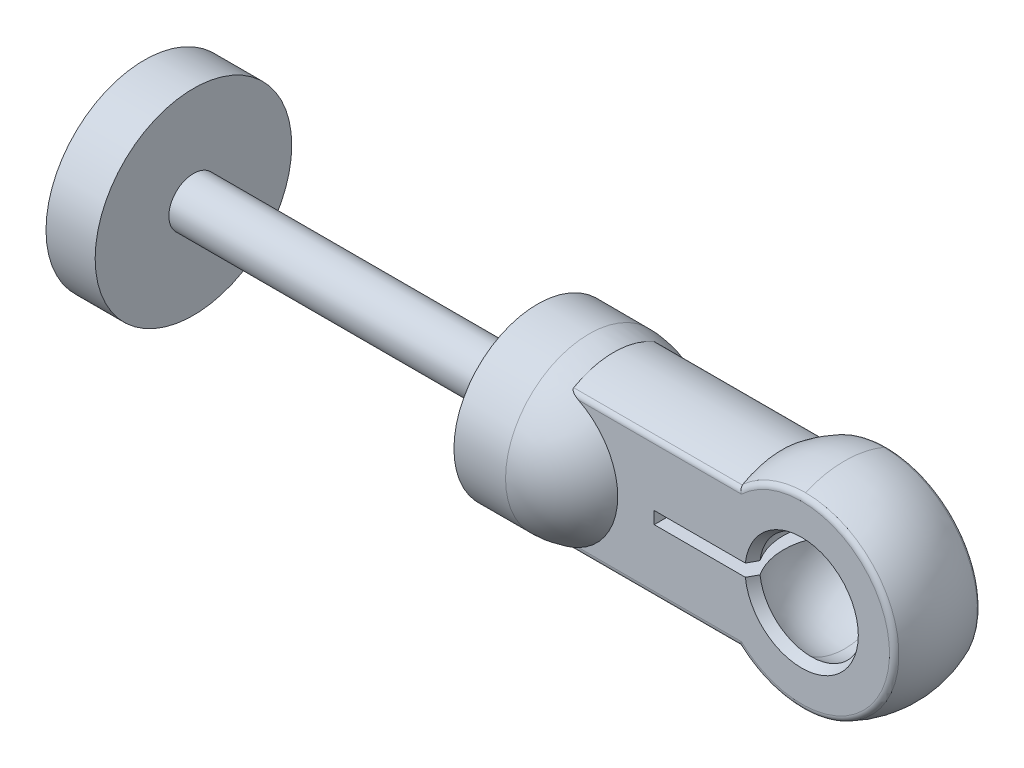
ISO-10303-21;
HEADER;
FILE_DESCRIPTION(('STEP AP214'),'2;1');
FILE_NAME('part.step','',(''),(''),'','','');
FILE_SCHEMA(('AUTOMOTIVE_DESIGN { 1 0 10303 214 1 1 1 1 }'));
ENDSEC;
DATA;
#1=APPLICATION_CONTEXT('core data for automotive mechanical design processes');
#2=APPLICATION_PROTOCOL_DEFINITION('international standard','automotive_design',2000,#1);
#3=PRODUCT_CONTEXT('',#1,'mechanical');
#4=PRODUCT('Part','Part','',(#3));
#5=PRODUCT_RELATED_PRODUCT_CATEGORY('part','',(#4));
#6=PRODUCT_DEFINITION_FORMATION('','',#4);
#7=PRODUCT_DEFINITION_CONTEXT('part definition',#1,'design');
#8=PRODUCT_DEFINITION('design','',#6,#7);
#9=PRODUCT_DEFINITION_SHAPE('','',#8);
#10=(LENGTH_UNIT() NAMED_UNIT(*) SI_UNIT(.MILLI.,.METRE.));
#11=(NAMED_UNIT(*) PLANE_ANGLE_UNIT() SI_UNIT($,.RADIAN.));
#12=(NAMED_UNIT(*) SI_UNIT($,.STERADIAN.) SOLID_ANGLE_UNIT());
#13=UNCERTAINTY_MEASURE_WITH_UNIT(LENGTH_MEASURE(1.E-05),#10,'distance_accuracy_value','');
#14=(GEOMETRIC_REPRESENTATION_CONTEXT(3) GLOBAL_UNCERTAINTY_ASSIGNED_CONTEXT((#13)) GLOBAL_UNIT_ASSIGNED_CONTEXT((#10,
#11,#12)) REPRESENTATION_CONTEXT('',''));
#15=CARTESIAN_POINT('',(0.,0.,0.));
#16=DIRECTION('',(0.,0.,1.));
#17=DIRECTION('',(1.,0.,0.));
#18=AXIS2_PLACEMENT_3D('',#15,#16,#17);
#19=CARTESIAN_POINT('',(0.,0.,0.));
#20=DIRECTION('',(0.,0.,1.));
#21=DIRECTION('',(-1.,0.,0.));
#22=AXIS2_PLACEMENT_3D('',#19,#20,#21);
#23=SPHERICAL_SURFACE('',#22,8.25);
#24=CARTESIAN_POINT('',(4.29666835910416E-06,7.60679843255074,-3.19360572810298));
#25=CARTESIAN_POINT('',(0.120896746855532,7.60680096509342,-3.1936051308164));
#26=CARTESIAN_POINT('',(0.241789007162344,7.60391692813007,-3.19360453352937));
#27=CARTESIAN_POINT('',(0.483298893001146,7.5923925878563,-3.19360333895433));
#28=CARTESIAN_POINT('',(0.603916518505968,7.58375228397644,-3.19360274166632));
#29=CARTESIAN_POINT('',(0.844602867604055,7.56073228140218,-3.19360154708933));
#30=CARTESIAN_POINT('',(0.964671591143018,7.54635258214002,-3.19360094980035));
#31=CARTESIAN_POINT('',(1.20398728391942,7.51188721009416,-3.19359975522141));
#32=CARTESIAN_POINT('',(1.32323425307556,7.49180153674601,-3.19359915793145));
#33=CARTESIAN_POINT('',(1.56063540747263,7.44596966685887,-3.19359796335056));
#34=CARTESIAN_POINT('',(1.67878959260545,7.4202234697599,-3.19359736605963));
#35=CARTESIAN_POINT('',(1.91373664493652,7.36312911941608,-3.19359617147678));
#36=CARTESIAN_POINT('',(2.03052951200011,7.33178096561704,-3.19359557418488));
#37=CARTESIAN_POINT('',(2.26248848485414,7.26355393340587,-3.19359437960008));
#38=CARTESIAN_POINT('',(2.37765459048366,7.22667505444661,-3.1935937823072));
#39=CARTESIAN_POINT('',(2.60609829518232,7.14747039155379,-3.19359258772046));
#40=CARTESIAN_POINT('',(2.71937589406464,7.1051446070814,-3.1935919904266));
#41=CARTESIAN_POINT('',(2.94378513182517,7.0151423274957,-3.19359079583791));
#42=CARTESIAN_POINT('',(3.05491677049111,6.96746583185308,-3.19359019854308));
#43=CARTESIAN_POINT('',(3.27478151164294,6.86687048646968,-3.19358900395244));
#44=CARTESIAN_POINT('',(3.38351461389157,6.81395163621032,-3.19358840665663));
#45=CARTESIAN_POINT('',(3.59833515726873,6.70299185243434,-3.19358721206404));
#46=CARTESIAN_POINT('',(3.70442259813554,6.64495091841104,-3.19358661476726));
#47=CARTESIAN_POINT('',(3.91371070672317,6.52387887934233,-3.19358542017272));
#48=CARTESIAN_POINT('',(4.01691137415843,6.4608477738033,-3.19358482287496));
#49=CARTESIAN_POINT('',(4.2201913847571,6.32993864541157,-3.19358362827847));
#50=CARTESIAN_POINT('',(4.32027072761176,6.26206062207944,-3.19358303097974));
#51=CARTESIAN_POINT('',(4.5170806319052,6.12161192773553,-3.1935818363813));
#52=CARTESIAN_POINT('',(4.61381119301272,6.04904125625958,-3.19358123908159));
#53=CARTESIAN_POINT('',(4.80370368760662,5.89937220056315,-3.1935800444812));
#54=CARTESIAN_POINT('',(4.89686562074,5.82227381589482,-3.19357944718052));
#55=CARTESIAN_POINT('',(5.07940912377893,5.6637245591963,-3.19357825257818));
#56=CARTESIAN_POINT('',(5.16879069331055,5.58227368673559,-3.19357765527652));
#57=CARTESIAN_POINT('',(5.34357032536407,5.41520457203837,-3.19357646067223));
#58=CARTESIAN_POINT('',(5.42896838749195,5.32958632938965,-3.1935758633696));
#59=CARTESIAN_POINT('',(5.59558691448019,5.1543770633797,-3.19357466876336));
#60=CARTESIAN_POINT('',(5.67680737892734,5.0647860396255,-3.19357407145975));
#61=CARTESIAN_POINT('',(5.83488611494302,4.88183482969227,-3.19357287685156));
#62=CARTESIAN_POINT('',(5.91174438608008,4.7884746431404,-3.19357227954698));
#63=CARTESIAN_POINT('',(6.06092405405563,4.59819729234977,-3.19357108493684));
#64=CARTESIAN_POINT('',(6.13324545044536,4.50128012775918,-3.19357048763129));
#65=CARTESIAN_POINT('',(6.27318699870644,4.30410908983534,-3.1935692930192));
#66=CARTESIAN_POINT('',(6.34080715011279,4.20385521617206,-3.19356869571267));
#67=CARTESIAN_POINT('',(6.47119252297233,4.00023861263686,-3.19356750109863));
#68=CARTESIAN_POINT('',(6.53395774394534,3.89687588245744,-3.19356690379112));
#69=CARTESIAN_POINT('',(6.65449060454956,3.68727648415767,-3.19356570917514));
#70=CARTESIAN_POINT('',(6.71225824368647,3.58103981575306,-3.19356511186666));
#71=CARTESIAN_POINT('',(6.82266464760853,3.36593399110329,-3.19356391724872));
#72=CARTESIAN_POINT('',(6.8753034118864,3.25706483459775,-3.19356331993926));
#73=CARTESIAN_POINT('',(6.97533242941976,3.03694146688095,-3.19356212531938));
#74=CARTESIAN_POINT('',(7.02272268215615,2.92568725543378,-3.19356152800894));
#75=CARTESIAN_POINT('',(7.11214696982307,2.70104663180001,-3.19356033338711));
#76=CARTESIAN_POINT('',(7.15418100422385,2.58766021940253,-3.1935597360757));
#77=CARTESIAN_POINT('',(7.23279731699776,2.35901289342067,-3.19355854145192));
#78=CARTESIAN_POINT('',(7.26937959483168,2.2437519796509,-3.19355794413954));
#79=CARTESIAN_POINT('',(7.33700926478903,2.0116176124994,-3.1935567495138));
#80=CARTESIAN_POINT('',(7.36805665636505,1.89474415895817,-3.19355615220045));
#81=CARTESIAN_POINT('',(7.4245459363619,1.659650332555,-3.19355495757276));
#82=CARTESIAN_POINT('',(7.44998782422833,1.54142995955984,-3.19355436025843));
#83=CARTESIAN_POINT('',(7.49520847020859,1.30391099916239,-3.1935531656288));
#84=CARTESIAN_POINT('',(7.51498722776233,1.18461241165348,-3.19355256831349));
#85=CARTESIAN_POINT('',(7.54883592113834,0.9452080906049,-3.19355137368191));
#86=CARTESIAN_POINT('',(7.56290585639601,0.825102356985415,-3.19355077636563));
#87=CARTESIAN_POINT('',(7.58530768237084,0.584356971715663,-3.1935495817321));
#88=CARTESIAN_POINT('',(7.59363957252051,0.463717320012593,-3.19354898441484));
#89=CARTESIAN_POINT('',(7.59908782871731,0.342947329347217,-3.19354838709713));
#90=B_SPLINE_CURVE_WITH_KNOTS('',3,(#24,#25,#26,#27,#28,#29,#30,#31,#32,#33,#34,#35,#36,#37,#38,
#39,#40,#41,#42,#43,#44,#45,#46,#47,#48,#49,#50,#51,#52,#53,#54,#55,#56,#57,#58,#59,#60,#61,#62,
#63,#64,#65,#66,#67,#68,#69,#70,#71,#72,#73,#74,#75,#76,#77,#78,#79,#80,#81,#82,#83,#84,#85,#86,
#87,#88,#89),.UNSPECIFIED.,.F.,.F.,(4,2,2,2,2,2,2,2,2,2,2,2,2,2,2,2,2,2,2,2,2,2,2,2,2,2,2,2,2,2,
2,2,4),(0.,0.362642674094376,0.725285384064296,1.08792812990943,1.45057091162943,
1.81321372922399,2.17585658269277,2.53849947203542,2.90114239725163,3.26378535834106,
3.62642835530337,3.98907138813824,4.35171445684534,4.71435756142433,5.07700070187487,
5.43964387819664,5.8022870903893,6.16493033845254,6.52757362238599,6.89021694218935,
7.25286029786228,7.61550368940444,7.97814711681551,8.34079058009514,8.70343407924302,
9.06607761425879,9.42872118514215,9.79136479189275,10.1540084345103,10.5166521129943,
10.8792958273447,11.2419395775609,11.6045833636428),.UNSPECIFIED.);
#91=CARTESIAN_POINT('',(4.29666835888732E-06,7.60679843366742,-3.19360572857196));
#92=VERTEX_POINT('',#91);
#93=CARTESIAN_POINT('',(7.59908782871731,0.342947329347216,-3.19354838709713));
#94=VERTEX_POINT('',#93);
#95=EDGE_CURVE('E192',#92,#94,#90,.T.);
#96=ORIENTED_EDGE('',*,*,#95,.F.);
#97=CARTESIAN_POINT('',(0.,8.24999999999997,0.));
#98=CARTESIAN_POINT('',(1.94166777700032E-07,8.25000300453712,-0.136636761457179));
#99=CARTESIAN_POINT('',(3.88331721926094E-07,8.24660564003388,-0.273273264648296));
#100=CARTESIAN_POINT('',(7.75225076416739E-07,8.23303175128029,-0.546209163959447));
#101=CARTESIAN_POINT('',(9.67953486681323E-07,8.22285522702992,-0.682508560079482));
#102=CARTESIAN_POINT('',(1.35054090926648E-06,8.1957445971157,-0.954433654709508));
#103=CARTESIAN_POINT('',(1.54039992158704E-06,8.17881049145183,-1.0900593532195));
#104=CARTESIAN_POINT('',(1.91582912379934E-06,8.1382274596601,-1.36030235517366));
#105=CARTESIAN_POINT('',(2.10139931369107E-06,8.11457853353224,-1.49491965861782));
#106=CARTESIAN_POINT('',(2.46684848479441E-06,8.06062391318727,-1.76281357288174));
#107=CARTESIAN_POINT('',(2.64672746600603E-06,8.03031821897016,-1.89609018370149));
#108=CARTESIAN_POINT('',(2.99941614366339E-06,7.96312516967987,-2.16097385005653));
#109=CARTESIAN_POINT('',(3.17222584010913E-06,7.92623781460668,-2.29258090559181));
#110=CARTESIAN_POINT('',(3.50942415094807E-06,7.84597157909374,-2.55380030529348));
#111=CARTESIAN_POINT('',(3.67381276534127E-06,7.80259269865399,-2.68341264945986));
#112=CARTESIAN_POINT('',(3.99286264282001E-06,7.70945381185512,-2.94032392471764));
#113=CARTESIAN_POINT('',(4.14752390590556E-06,7.659693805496,-3.06762285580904));
#114=CARTESIAN_POINT('',(4.29666835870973E-06,7.60679843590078,-3.19360572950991));
#115=B_SPLINE_CURVE_WITH_KNOTS('',3,(#97,#98,#99,#100,#101,#102,#103,#104,#105,#106,#107,#108,
#109,#110,#111,#112,#113,#114),.UNSPECIFIED.,.F.,.F.,(4,2,2,2,2,2,2,2,4),(0.,0.409867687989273,
0.819735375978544,1.22960306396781,1.63947075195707,2.04933843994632,2.45920612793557,
2.8690738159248,3.27894150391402),.UNSPECIFIED.);
#116=CARTESIAN_POINT('',(0.,8.24999999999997,0.));
#117=VERTEX_POINT('',#116);
#118=EDGE_CURVE('E461',#117,#92,#115,.T.);
#119=ORIENTED_EDGE('',*,*,#118,.F.);
#120=CARTESIAN_POINT('',(0.,0.,0.));
#121=DIRECTION('',(1.,0.,0.));
#122=DIRECTION('',(0.,0.,-1.));
#123=AXIS2_PLACEMENT_3D('',#120,#121,#122);
#124=CIRCLE('',#123,8.25);
#125=CARTESIAN_POINT('',(0.,7.6068225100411,3.19354838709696));
#126=VERTEX_POINT('',#125);
#127=EDGE_CURVE('E887',#126,#117,#124,.F.);
#128=ORIENTED_EDGE('',*,*,#127,.F.);
#129=CARTESIAN_POINT('',(0.,0.,3.19354838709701));
#130=DIRECTION('',(0.,0.,1.));
#131=DIRECTION('',(0.998982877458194,-0.0450911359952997,0.));
#132=AXIS2_PLACEMENT_3D('',#129,#130,#131);
#133=CIRCLE('',#132,7.60682251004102);
#134=CARTESIAN_POINT('',(0.,-7.60682251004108,3.19354838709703));
#135=VERTEX_POINT('',#134);
#136=EDGE_CURVE('E373',#135,#126,#133,.T.);
#137=ORIENTED_EDGE('',*,*,#136,.F.);
#138=CARTESIAN_POINT('',(0.,0.,0.));
#139=DIRECTION('',(-1.,0.,0.));
#140=DIRECTION('',(0.,0.,-1.));
#141=AXIS2_PLACEMENT_3D('',#138,#139,#140);
#142=CIRCLE('',#141,8.25);
#143=CARTESIAN_POINT('',(0.,-8.25,0.));
#144=VERTEX_POINT('',#143);
#145=EDGE_CURVE('E862',#144,#135,#142,.T.);
#146=ORIENTED_EDGE('',*,*,#145,.F.);
#147=CARTESIAN_POINT('',(0.00115035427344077,-7.60681440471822,-3.19356748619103));
#148=CARTESIAN_POINT('',(0.00103963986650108,-7.62451190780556,-3.15141366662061));
#149=CARTESIAN_POINT('',(0.000954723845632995,-7.64185903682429,-3.10911242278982));
#150=CARTESIAN_POINT('',(0.00078019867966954,-7.68550329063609,-3.00011301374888));
#151=CARTESIAN_POINT('',(0.00071533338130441,-7.71128581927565,-2.9332082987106));
#152=CARTESIAN_POINT('',(0.000580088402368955,-7.77012165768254,-2.77439149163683));
#153=CARTESIAN_POINT('',(0.000516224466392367,-7.80242511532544,-2.682200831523));
#154=CARTESIAN_POINT('',(0.000395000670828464,-7.87189057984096,-2.47206938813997));
#155=CARTESIAN_POINT('',(0.000343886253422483,-7.90806033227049,-2.35380015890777));
#156=CARTESIAN_POINT('',(0.000247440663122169,-7.98208455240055,-2.090743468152));
#157=CARTESIAN_POINT('',(0.000205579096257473,-8.01869723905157,-1.94560368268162));
#158=CARTESIAN_POINT('',(0.000151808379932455,-8.06977794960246,-1.7170721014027));
#159=CARTESIAN_POINT('',(0.000134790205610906,-8.08695233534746,-1.63427423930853));
#160=CARTESIAN_POINT('',(0.000103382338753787,-8.11996936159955,-1.46180893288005));
#161=CARTESIAN_POINT('',(8.92948801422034E-05,-8.13560843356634,-1.37210225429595));
#162=CARTESIAN_POINT('',(6.38919243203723E-05,-8.16491754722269,-1.18580606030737));
#163=CARTESIAN_POINT('',(5.28457763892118E-05,-8.17836761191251,-1.08918195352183));
#164=CARTESIAN_POINT('',(3.36245409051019E-05,-8.20261402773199,-0.889070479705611));
#165=CARTESIAN_POINT('',(2.56895318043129E-05,-8.21317411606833,-0.785554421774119));
#166=CARTESIAN_POINT('',(1.27766517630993E-05,-8.23090791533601,-0.571725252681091));
#167=CARTESIAN_POINT('',(8.01425729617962E-06,-8.23782913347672,-0.461391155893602));
#168=CARTESIAN_POINT('',(1.54040902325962E-06,-8.24751011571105,-0.23404590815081));
#169=CARTESIAN_POINT('',(2.46200612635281E-08,-8.25000152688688,-0.117023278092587));
#170=CARTESIAN_POINT('',(0.,-8.25,0.));
#171=B_SPLINE_CURVE_WITH_KNOTS('',3,(#147,#148,#149,#150,#151,#152,#153,#154,#155,#156,#157,
#158,#159,#160,#161,#162,#163,#164,#165,#166,#167,#168,#169,#170),.UNSPECIFIED.,.F.,.F.,(4,2,2,
2,2,2,2,2,2,2,2,4),(0.,0.137153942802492,0.352231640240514,0.645228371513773,1.01613762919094,
1.4649511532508,1.71859875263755,1.99172596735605,2.28433241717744,2.59641769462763,
2.92798136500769,3.27902296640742),.UNSPECIFIED.);
#172=CARTESIAN_POINT('',(0.00115035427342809,-7.60681440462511,-3.19356748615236));
#173=VERTEX_POINT('',#172);
#174=EDGE_CURVE('E850',#173,#144,#171,.T.);
#175=ORIENTED_EDGE('',*,*,#174,.F.);
#176=CARTESIAN_POINT('',(7.59908782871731,0.342947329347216,-3.19354838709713));
#177=CARTESIAN_POINT('',(7.60486273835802,0.215049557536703,-3.19354858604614));
#178=CARTESIAN_POINT('',(7.6074029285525,0.0870060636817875,-3.1935487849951));
#179=CARTESIAN_POINT('',(7.60602038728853,-0.169046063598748,-3.19354918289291));
#180=CARTESIAN_POINT('',(7.60209765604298,-0.297054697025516,-3.19354938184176));
#181=CARTESIAN_POINT('',(7.58779578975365,-0.552710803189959,-3.19354977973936));
#182=CARTESIAN_POINT('',(7.57741665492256,-0.68035827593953,-3.1935499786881));
#183=CARTESIAN_POINT('',(7.55022937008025,-0.93496670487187,-3.19355037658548));
#184=CARTESIAN_POINT('',(7.5334212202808,-1.06192766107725,-3.19355057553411));
#185=CARTESIAN_POINT('',(7.49341849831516,-1.31483944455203,-3.19355097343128));
#186=CARTESIAN_POINT('',(7.47022392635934,-1.44079027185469,-3.1935511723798));
#187=CARTESIAN_POINT('',(7.41750754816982,-1.69136076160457,-3.19355157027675));
#188=CARTESIAN_POINT('',(7.38798574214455,-1.81598042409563,-3.19355176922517));
#189=CARTESIAN_POINT('',(7.32269012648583,-2.06357094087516,-3.1935521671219));
#190=CARTESIAN_POINT('',(7.28691631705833,-2.18654179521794,-3.19355236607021));
#191=CARTESIAN_POINT('',(7.20920788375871,-2.43052125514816,-3.19355276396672));
#192=CARTESIAN_POINT('',(7.16727326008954,-2.55152986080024,-3.19355296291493));
#193=CARTESIAN_POINT('',(7.07735008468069,-2.79127638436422,-3.19355336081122));
#194=CARTESIAN_POINT('',(7.02936153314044,-2.9100143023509,-3.19355355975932));
#195=CARTESIAN_POINT('',(6.92745282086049,-3.14491679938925,-3.1935539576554));
#196=CARTESIAN_POINT('',(6.87353266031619,-3.26108137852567,-3.19355415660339));
#197=CARTESIAN_POINT('',(6.75989816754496,-3.49054110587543,-3.19355455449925));
#198=CARTESIAN_POINT('',(6.70018383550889,-3.60383625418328,-3.19355475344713));
#199=CARTESIAN_POINT('',(6.57511320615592,-3.82726834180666,-3.19355515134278));
#200=CARTESIAN_POINT('',(6.50975690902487,-3.93740528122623,-3.19355535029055));
#201=CARTESIAN_POINT('',(6.3735689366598,-4.15424022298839,-3.19355574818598));
#202=CARTESIAN_POINT('',(6.30273726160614,-4.26093822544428,-3.19355594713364));
#203=CARTESIAN_POINT('',(6.15577907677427,-4.47062333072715,-3.19355634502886));
#204=CARTESIAN_POINT('',(6.07965256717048,-4.57361043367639,-3.19355654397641));
#205=CARTESIAN_POINT('',(5.92229875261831,-4.77561123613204,-3.19355694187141));
#206=CARTESIAN_POINT('',(5.84107144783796,-4.87462493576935,-3.19355714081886));
#207=CARTESIAN_POINT('',(5.67372308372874,-5.06842655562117,-3.19355753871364));
#208=CARTESIAN_POINT('',(5.58760202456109,-5.16321447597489,-3.19355773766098));
#209=CARTESIAN_POINT('',(5.41068566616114,-5.3483229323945,-3.19355813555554));
#210=CARTESIAN_POINT('',(5.31989036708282,-5.43864346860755,-3.19355833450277));
#211=CARTESIAN_POINT('',(5.13385695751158,-5.61458693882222,-3.19355873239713));
#212=CARTESIAN_POINT('',(5.03861884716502,-5.70020987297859,-3.19355893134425));
#213=CARTESIAN_POINT('',(4.84394256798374,-5.86653989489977,-3.19355932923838));
#214=CARTESIAN_POINT('',(4.74450439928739,-5.94724698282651,-3.19355952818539));
#215=CARTESIAN_POINT('',(4.54168146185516,-6.10353959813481,-3.19355992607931));
#216=CARTESIAN_POINT('',(4.4382966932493,-6.17912512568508,-3.19356012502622));
#217=CARTESIAN_POINT('',(4.2278440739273,-6.32498196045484,-3.19356052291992));
#218=CARTESIAN_POINT('',(4.12077622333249,-6.39525326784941,-3.19356072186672));
#219=CARTESIAN_POINT('',(3.90323034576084,-6.53030254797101,-3.1935611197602));
#220=CARTESIAN_POINT('',(3.79275231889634,-6.59508052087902,-3.19356131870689));
#221=CARTESIAN_POINT('',(3.56866768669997,-6.71897801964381,-3.19356171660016));
#222=CARTESIAN_POINT('',(3.45506108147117,-6.77809754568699,-3.19356191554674));
#223=CARTESIAN_POINT('',(3.22500886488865,-6.89052746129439,-3.19356231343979));
#224=CARTESIAN_POINT('',(3.10856325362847,-6.94383785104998,-3.19356251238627));
#225=CARTESIAN_POINT('',(2.87312983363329,-7.04451361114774,-3.1935629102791));
#226=CARTESIAN_POINT('',(2.75414202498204,-7.09187898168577,-3.19356310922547));
#227=CARTESIAN_POINT('',(2.51392749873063,-7.18054397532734,-3.19356350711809));
#228=CARTESIAN_POINT('',(2.39270078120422,-7.22184359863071,-3.19356370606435));
#229=CARTESIAN_POINT('',(2.1483174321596,-7.29827182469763,-3.19356410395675));
#230=CARTESIAN_POINT('',(2.02516080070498,-7.33340042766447,-3.1935643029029));
#231=CARTESIAN_POINT('',(1.77723153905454,-7.39739709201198,-3.19356470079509));
#232=CARTESIAN_POINT('',(1.65245890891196,-7.42626515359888,-3.19356489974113));
#233=CARTESIAN_POINT('',(1.4016156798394,-7.47766708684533,-3.1935652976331));
#234=CARTESIAN_POINT('',(1.27554508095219,-7.50020095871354,-3.19356549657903));
#235=CARTESIAN_POINT('',(1.02242726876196,-7.53887732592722,-3.19356589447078));
#236=CARTESIAN_POINT('',(0.895380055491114,-7.55501982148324,-3.19356609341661));
#237=CARTESIAN_POINT('',(0.640632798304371,-7.58087135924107,-3.19356649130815));
#238=CARTESIAN_POINT('',(0.512932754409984,-7.59058040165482,-3.19356669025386));
#239=CARTESIAN_POINT('',(0.257205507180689,-7.60354376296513,-3.19356708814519));
#240=CARTESIAN_POINT('',(0.129178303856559,-7.60679808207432,-3.19356728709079));
#241=CARTESIAN_POINT('',(0.00115035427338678,-7.60681440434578,-3.19356748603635));
#242=B_SPLINE_CURVE_WITH_KNOTS('',3,(#176,#177,#178,#179,#180,#181,#182,#183,#184,#185,#186,
#187,#188,#189,#190,#191,#192,#193,#194,#195,#196,#197,#198,#199,#200,#201,#202,#203,#204,#205,
#206,#207,#208,#209,#210,#211,#212,#213,#214,#215,#216,#217,#218,#219,#220,#221,#222,#223,#224,
#225,#226,#227,#228,#229,#230,#231,#232,#233,#234,#235,#236,#237,#238,#239,#240,#241),
.UNSPECIFIED.,.F.,.F.,(4,2,2,2,2,2,2,2,2,2,2,2,2,2,2,2,2,2,2,2,2,2,2,2,2,2,2,2,2,2,2,2,4),(0.,
0.384043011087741,0.768086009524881,1.15212899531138,1.5361719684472,1.9202149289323,
2.30425787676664,2.68830081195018,3.07234373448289,3.45638664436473,3.84042954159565,
4.22447242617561,4.60851529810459,4.99255815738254,5.37660100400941,5.76064383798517,
6.14468665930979,6.52872946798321,6.91277226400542,7.29681504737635,7.68085781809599,
8.06490057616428,8.44894332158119,8.83298605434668,9.2170287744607,9.60107148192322,
9.98511417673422,10.3691568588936,10.7531995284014,11.1372421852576,11.521284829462,
11.9053274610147,12.2893700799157),.UNSPECIFIED.);
#243=EDGE_CURVE('E647',#94,#173,#242,.T.);
#244=ORIENTED_EDGE('',*,*,#243,.F.);
#245=EDGE_LOOP('',(#96,#119,#128,#137,#146,#175,#244));
#246=FACE_BOUND('',#245,.T.);
#247=ADVANCED_FACE('F16',(#246),#23,.T.);
#248=CARTESIAN_POINT('',(0.,0.,0.));
#249=DIRECTION('',(0.,0.,-1.));
#250=DIRECTION('',(1.,0.,0.));
#251=AXIS2_PLACEMENT_3D('',#248,#249,#250);
#252=SPHERICAL_SURFACE('',#251,5.);
#253=CARTESIAN_POINT('',(0.,0.,0.));
#254=DIRECTION('',(1.,0.,0.));
#255=DIRECTION('',(0.,0.,1.));
#256=AXIS2_PLACEMENT_3D('',#253,#254,#255);
#257=CIRCLE('',#256,5.);
#258=CARTESIAN_POINT('',(0.,-4.19066972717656,2.72732231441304));
#259=VERTEX_POINT('',#258);
#260=CARTESIAN_POINT('',(0.,-4.19066973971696,-2.72732233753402));
#261=VERTEX_POINT('',#260);
#262=EDGE_CURVE('E907',#259,#261,#257,.T.);
#263=ORIENTED_EDGE('',*,*,#262,.T.);
#264=CARTESIAN_POINT('',(0.,0.,-2.72732233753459));
#265=DIRECTION('',(0.,0.,-1.));
#266=DIRECTION('',(-1.,0.,0.));
#267=AXIS2_PLACEMENT_3D('',#264,#265,#266);
#268=CIRCLE('',#267,4.19066973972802);
#269=CARTESIAN_POINT('',(-4.16073463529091,-0.5,-2.72732230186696));
#270=VERTEX_POINT('',#269);
#271=EDGE_CURVE('E638',#261,#270,#268,.T.);
#272=ORIENTED_EDGE('',*,*,#271,.T.);
#273=CARTESIAN_POINT('',(-4.16073473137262,-0.5,-2.72732222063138));
#274=CARTESIAN_POINT('',(-4.23745828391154,-0.5,-2.61030213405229));
#275=CARTESIAN_POINT('',(-4.30921855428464,-0.5,-2.49003124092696));
#276=CARTESIAN_POINT('',(-4.44235701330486,-0.5,-2.24388099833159));
#277=CARTESIAN_POINT('',(-4.50373568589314,-0.5,-2.11800191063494));
#278=CARTESIAN_POINT('',(-4.61561719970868,-0.5,-1.86162155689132));
#279=CARTESIAN_POINT('',(-4.66612883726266,-0.5,-1.7311241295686));
#280=CARTESIAN_POINT('',(-4.7559841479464,-0.5,-1.46634156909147));
#281=CARTESIAN_POINT('',(-4.79532797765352,-0.499999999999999,-1.33205648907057));
#282=CARTESIAN_POINT('',(-4.86257556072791,-0.499999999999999,-1.06061967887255));
#283=CARTESIAN_POINT('',(-4.89047674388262,-0.5,-0.92346731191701));
#284=CARTESIAN_POINT('',(-4.93463603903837,-0.5,-0.647251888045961));
#285=CARTESIAN_POINT('',(-4.95089009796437,-0.5,-0.508188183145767));
#286=CARTESIAN_POINT('',(-4.97162250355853,-0.5,-0.229201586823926));
#287=CARTESIAN_POINT('',(-4.97610218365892,-0.5,-0.0892787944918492));
#288=CARTESIAN_POINT('',(-4.97325784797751,-0.5,0.190446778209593));
#289=CARTESIAN_POINT('',(-4.96593383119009,-0.5,0.330249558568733));
#290=CARTESIAN_POINT('',(-4.93952583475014,-0.5,0.608829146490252));
#291=CARTESIAN_POINT('',(-4.92043442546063,-0.5,0.747605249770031));
#292=CARTESIAN_POINT('',(-4.87062962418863,-0.5,1.02300616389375));
#293=CARTESIAN_POINT('',(-4.83992030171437,-0.5,1.15963171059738));
#294=CARTESIAN_POINT('',(-4.76711999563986,-0.5,1.4297266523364));
#295=CARTESIAN_POINT('',(-4.72503586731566,-0.5,1.56319789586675));
#296=CARTESIAN_POINT('',(-4.62979373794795,-0.5,1.82607386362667));
#297=CARTESIAN_POINT('',(-4.57664013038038,-0.499999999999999,1.95548017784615));
#298=CARTESIAN_POINT('',(-4.46659936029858,-0.499999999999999,2.19423032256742));
#299=CARTESIAN_POINT('',(-4.41091030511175,-0.5,2.30412834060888));
#300=CARTESIAN_POINT('',(-4.29165704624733,-0.5,2.5192855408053));
#301=CARTESIAN_POINT('',(-4.2281083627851,-0.500000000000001,2.62455332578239));
#302=CARTESIAN_POINT('',(-4.16073470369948,-0.5,2.72732226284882));
#303=B_SPLINE_CURVE_WITH_KNOTS('',3,(#273,#274,#275,#276,#277,#278,#279,#280,#281,#282,#283,
#284,#285,#286,#287,#288,#289,#290,#291,#292,#293,#294,#295,#296,#297,#298,#299,#300,#301,#302),
.UNSPECIFIED.,.F.,.F.,(4,2,2,2,2,2,2,2,2,2,2,2,2,2,4),(0.,0.419659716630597,0.839299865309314,
1.25859904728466,1.67789235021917,2.09727978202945,2.51681308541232,2.93629887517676,
3.35578470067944,3.77553565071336,4.19513970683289,4.61449144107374,5.03367705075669,
5.40295128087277,5.77150762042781),.UNSPECIFIED.);
#304=CARTESIAN_POINT('',(-4.1607346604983,-0.5,2.72732226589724));
#305=VERTEX_POINT('',#304);
#306=EDGE_CURVE('E331',#270,#305,#303,.T.);
#307=ORIENTED_EDGE('',*,*,#306,.T.);
#308=CARTESIAN_POINT('',(0.,0.,2.72732226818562));
#309=DIRECTION('',(0.,0.,1.));
#310=DIRECTION('',(1.,0.,0.));
#311=AXIS2_PLACEMENT_3D('',#308,#309,#310);
#312=CIRCLE('',#311,4.19066970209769);
#313=EDGE_CURVE('E923',#305,#259,#312,.T.);
#314=ORIENTED_EDGE('',*,*,#313,.T.);
#315=EDGE_LOOP('',(#263,#272,#307,#314));
#316=FACE_BOUND('',#315,.T.);
#317=ADVANCED_FACE('F826',(#316),#252,.F.);
#318=CARTESIAN_POINT('',(0.,0.,0.));
#319=DIRECTION('',(0.,0.,1.));
#320=DIRECTION('',(-1.,0.,0.));
#321=AXIS2_PLACEMENT_3D('',#318,#319,#320);
#322=SPHERICAL_SURFACE('',#321,5.);
#323=CARTESIAN_POINT('',(0.,0.,0.));
#324=DIRECTION('',(1.,0.,0.));
#325=DIRECTION('',(0.,0.,-1.));
#326=AXIS2_PLACEMENT_3D('',#323,#324,#325);
#327=CIRCLE('',#326,5.);
#328=CARTESIAN_POINT('',(0.,4.19066973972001,2.72732233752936));
#329=VERTEX_POINT('',#328);
#330=CARTESIAN_POINT('',(0.,4.19066972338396,-2.72732230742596));
#331=VERTEX_POINT('',#330);
#332=EDGE_CURVE('E908',#329,#331,#327,.F.);
#333=ORIENTED_EDGE('',*,*,#332,.T.);
#334=CARTESIAN_POINT('',(0.,0.,-2.72732233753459));
#335=DIRECTION('',(0.,0.,-1.));
#336=DIRECTION('',(-1.,0.,0.));
#337=AXIS2_PLACEMENT_3D('',#334,#335,#336);
#338=CIRCLE('',#337,4.19066973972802);
#339=EDGE_CURVE('E896',#331,#261,#338,.T.);
#340=ORIENTED_EDGE('',*,*,#339,.T.);
#341=ORIENTED_EDGE('',*,*,#262,.F.);
#342=CARTESIAN_POINT('',(0.,0.,2.72732233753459));
#343=DIRECTION('',(0.,0.,1.));
#344=DIRECTION('',(1.,0.,0.));
#345=AXIS2_PLACEMENT_3D('',#342,#343,#344);
#346=CIRCLE('',#345,4.19066973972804);
#347=CARTESIAN_POINT('',(4.19066973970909,0.,2.72732233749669));
#348=VERTEX_POINT('',#347);
#349=EDGE_CURVE('E925',#259,#348,#346,.T.);
#350=ORIENTED_EDGE('',*,*,#349,.T.);
#351=CARTESIAN_POINT('',(0.,0.,2.72732233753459));
#352=DIRECTION('',(0.,0.,1.));
#353=DIRECTION('',(1.,0.,0.));
#354=AXIS2_PLACEMENT_3D('',#351,#352,#353);
#355=CIRCLE('',#354,4.19066973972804);
#356=EDGE_CURVE('E956',#348,#329,#355,.T.);
#357=ORIENTED_EDGE('',*,*,#356,.T.);
#358=EDGE_LOOP('',(#333,#340,#341,#350,#357));
#359=FACE_BOUND('',#358,.T.);
#360=ADVANCED_FACE('F437',(#359),#322,.F.);
#361=CARTESIAN_POINT('',(0.,0.,0.));
#362=DIRECTION('',(0.,0.,-1.));
#363=DIRECTION('',(1.,0.,0.));
#364=AXIS2_PLACEMENT_3D('',#361,#362,#363);
#365=SPHERICAL_SURFACE('',#364,5.);
#366=CARTESIAN_POINT('',(0.,0.,2.72732233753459));
#367=DIRECTION('',(0.,0.,1.));
#368=DIRECTION('',(1.,0.,0.));
#369=AXIS2_PLACEMENT_3D('',#366,#367,#368);
#370=CIRCLE('',#369,4.19066973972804);
#371=CARTESIAN_POINT('',(-4.16073467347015,0.5,2.72732237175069));
#372=VERTEX_POINT('',#371);
#373=EDGE_CURVE('E324',#329,#372,#370,.T.);
#374=ORIENTED_EDGE('',*,*,#373,.T.);
#375=CARTESIAN_POINT('',(-4.16073468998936,0.499999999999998,2.72732228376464));
#376=CARTESIAN_POINT('',(-4.23745824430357,0.499999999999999,2.61030219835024));
#377=CARTESIAN_POINT('',(-4.30921851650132,0.5,2.49003130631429));
#378=CARTESIAN_POINT('',(-4.44235697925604,0.5,2.24388106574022));
#379=CARTESIAN_POINT('',(-4.50373565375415,0.5,2.11800197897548));
#380=CARTESIAN_POINT('',(-4.61561717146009,0.5,1.86162162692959));
#381=CARTESIAN_POINT('',(-4.66612881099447,0.5,1.73112420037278));
#382=CARTESIAN_POINT('',(-4.7559841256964,0.5,1.46634164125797));
#383=CARTESIAN_POINT('',(-4.79532795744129,0.500000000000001,1.33205656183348));
#384=CARTESIAN_POINT('',(-4.86257554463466,0.500000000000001,1.0606197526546));
#385=CARTESIAN_POINT('',(-4.89047672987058,0.5,0.923467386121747));
#386=CARTESIAN_POINT('',(-4.9346360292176,0.5,0.647251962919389));
#387=CARTESIAN_POINT('',(-4.9508900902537,0.5,0.508188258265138));
#388=CARTESIAN_POINT('',(-4.97162250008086,0.5,0.229201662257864));
#389=CARTESIAN_POINT('',(-4.97610218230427,0.5,0.0892788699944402));
#390=CARTESIAN_POINT('',(-4.9732578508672,0.5,-0.190446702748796));
#391=CARTESIAN_POINT('',(-4.9659338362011,0.499999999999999,-0.330249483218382));
#392=CARTESIAN_POINT('',(-4.93952584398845,0.499999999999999,-0.608829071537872));
#393=CARTESIAN_POINT('',(-4.92043443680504,0.5,-0.747605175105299));
#394=CARTESIAN_POINT('',(-4.87062963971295,0.5,-1.02300608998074));
#395=CARTESIAN_POINT('',(-4.8399203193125,0.5,-1.15963163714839));
#396=CARTESIAN_POINT('',(-4.76712001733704,0.5,-1.42972657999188));
#397=CARTESIAN_POINT('',(-4.72503589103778,0.5,-1.56319782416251));
#398=CARTESIAN_POINT('',(-4.62979376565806,0.5,-1.82607379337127));
#399=CARTESIAN_POINT('',(-4.57664016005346,0.500000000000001,-1.95548010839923));
#400=CARTESIAN_POINT('',(-4.46659939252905,0.500000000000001,-2.19423025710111));
#401=CARTESIAN_POINT('',(-4.41091033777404,0.5,-2.30412827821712));
#402=CARTESIAN_POINT('',(-4.29165707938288,0.5,-2.51928548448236));
#403=CARTESIAN_POINT('',(-4.22810839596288,0.499999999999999,-2.62455327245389));
#404=CARTESIAN_POINT('',(-4.16073473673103,0.5,-2.72732221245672));
#405=B_SPLINE_CURVE_WITH_KNOTS('',3,(#375,#376,#377,#378,#379,#380,#381,#382,#383,#384,#385,
#386,#387,#388,#389,#390,#391,#392,#393,#394,#395,#396,#397,#398,#399,#400,#401,#402,#403,#404),
.UNSPECIFIED.,.F.,.F.,(4,2,2,2,2,2,2,2,2,2,2,2,2,2,4),(0.,0.419659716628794,0.839299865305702,
1.25859904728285,1.67789235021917,2.09727978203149,2.51681308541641,2.9362988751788,
3.35578470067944,3.77553565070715,4.1951397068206,4.61449144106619,5.03367705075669,
5.40295128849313,5.77150763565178),.UNSPECIFIED.);
#406=CARTESIAN_POINT('',(-4.16073467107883,0.5,-2.72732222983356));
#407=VERTEX_POINT('',#406);
#408=EDGE_CURVE('E421',#372,#407,#405,.T.);
#409=ORIENTED_EDGE('',*,*,#408,.T.);
#410=CARTESIAN_POINT('',(0.,0.,-2.7273222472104));
#411=DIRECTION('',(0.,0.,-1.));
#412=DIRECTION('',(-1.,0.,0.));
#413=AXIS2_PLACEMENT_3D('',#410,#411,#412);
#414=CIRCLE('',#413,4.190669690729);
#415=EDGE_CURVE('E904',#407,#331,#414,.T.);
#416=ORIENTED_EDGE('',*,*,#415,.T.);
#417=ORIENTED_EDGE('',*,*,#332,.F.);
#418=EDGE_LOOP('',(#374,#409,#416,#417));
#419=FACE_BOUND('',#418,.T.);
#420=ADVANCED_FACE('F430',(#419),#365,.F.);
#421=CARTESIAN_POINT('',(-12.,0.5,-9.9));
#422=DIRECTION('',(-1.,0.,0.));
#423=DIRECTION('',(0.,0.,1.));
#424=AXIS2_PLACEMENT_3D('',#421,#422,#423);
#425=PLANE('',#424);
#426=DIRECTION('',(0.,1.,0.));
#427=VECTOR('',#426,1.);
#428=CARTESIAN_POINT('',(-12.,0.5,-3.5));
#429=LINE('',#428,#427);
#430=CARTESIAN_POINT('',(-12.,0.499999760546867,-3.5));
#431=VERTEX_POINT('',#430);
#432=CARTESIAN_POINT('',(-12.,-0.499999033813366,-3.5));
#433=VERTEX_POINT('',#432);
#434=EDGE_CURVE('E915',#431,#433,#429,.F.);
#435=ORIENTED_EDGE('',*,*,#434,.F.);
#436=DIRECTION('',(0.,0.,1.));
#437=VECTOR('',#436,1.);
#438=CARTESIAN_POINT('',(-12.,0.5,-9.9));
#439=LINE('',#438,#437);
#440=CARTESIAN_POINT('',(-12.,0.4999990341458,3.5));
#441=VERTEX_POINT('',#440);
#442=EDGE_CURVE('E203',#431,#441,#439,.T.);
#443=ORIENTED_EDGE('',*,*,#442,.T.);
#444=DIRECTION('',(0.,1.,0.));
#445=VECTOR('',#444,1.);
#446=CARTESIAN_POINT('',(-12.,0.5,3.5));
#447=LINE('',#446,#445);
#448=CARTESIAN_POINT('',(-12.,-0.499999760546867,3.5));
#449=VERTEX_POINT('',#448);
#450=EDGE_CURVE('E911',#449,#441,#447,.T.);
#451=ORIENTED_EDGE('',*,*,#450,.F.);
#452=DIRECTION('',(0.,0.,-1.));
#453=VECTOR('',#452,1.);
#454=CARTESIAN_POINT('',(-12.,-0.5,-9.9));
#455=LINE('',#454,#453);
#456=EDGE_CURVE('E327',#449,#433,#455,.T.);
#457=ORIENTED_EDGE('',*,*,#456,.T.);
#458=EDGE_LOOP('',(#435,#443,#451,#457));
#459=FACE_BOUND('',#458,.T.);
#460=ADVANCED_FACE('F436',(#459),#425,.F.);
#461=CARTESIAN_POINT('',(0.,0.,0.));
#462=DIRECTION('',(0.,0.,-1.));
#463=DIRECTION('',(1.,0.,0.));
#464=AXIS2_PLACEMENT_3D('',#461,#462,#463);
#465=SPHERICAL_SURFACE('',#464,8.25);
#466=CARTESIAN_POINT('',(0.,0.,3.19354838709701));
#467=DIRECTION('',(0.,0.,1.));
#468=DIRECTION('',(-0.696747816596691,0.717316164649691,0.));
#469=AXIS2_PLACEMENT_3D('',#466,#467,#468);
#470=CIRCLE('',#469,7.60682251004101);
#471=CARTESIAN_POINT('',(-5.080600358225,5.66138222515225,3.19354838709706));
#472=VERTEX_POINT('',#471);
#473=EDGE_CURVE('E657',#126,#472,#470,.T.);
#474=ORIENTED_EDGE('',*,*,#473,.F.);
#475=ORIENTED_EDGE('',*,*,#127,.T.);
#476=ORIENTED_EDGE('',*,*,#118,.T.);
#477=CARTESIAN_POINT('',(-5.08060035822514,5.66138222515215,-3.19354838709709));
#478=CARTESIAN_POINT('',(-4.99433777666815,5.73879741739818,-3.19354958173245));
#479=CARTESIAN_POINT('',(-4.90630335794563,5.81423797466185,-3.19355077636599));
#480=CARTESIAN_POINT('',(-4.72688030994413,5.96101895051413,-3.19355316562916));
#481=CARTESIAN_POINT('',(-4.63549168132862,6.03235936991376,-3.19355436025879));
#482=CARTESIAN_POINT('',(-4.44954966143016,6.17078921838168,-3.19355674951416));
#483=CARTESIAN_POINT('',(-4.35499627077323,6.23787864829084,-3.1935579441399));
#484=CARTESIAN_POINT('',(-4.16292266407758,6.367666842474,-3.19356033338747));
#485=CARTESIAN_POINT('',(-4.06540244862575,6.43036560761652,-3.19356152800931));
#486=CARTESIAN_POINT('',(-3.86759882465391,6.55124135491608,-3.19356391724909));
#487=CARTESIAN_POINT('',(-3.76731541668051,6.60941833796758,-3.19356511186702));
#488=CARTESIAN_POINT('',(-3.56419494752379,6.7211290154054,-3.193567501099));
#489=CARTESIAN_POINT('',(-3.46135788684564,6.77466271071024,-3.19356869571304));
#490=CARTESIAN_POINT('',(-3.25334495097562,6.87697496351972,-3.19357108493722));
#491=CARTESIAN_POINT('',(-3.14816907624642,6.92575352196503,-3.19357227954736));
#492=CARTESIAN_POINT('',(-2.93569824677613,7.01845359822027,-3.19357466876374));
#493=CARTESIAN_POINT('',(-2.82840329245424,7.06237511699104,-3.19357586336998));
#494=CARTESIAN_POINT('',(-2.61191846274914,7.14526935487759,-3.19357825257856));
#495=CARTESIAN_POINT('',(-2.50272858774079,7.18424207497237,-3.1935794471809));
#496=CARTESIAN_POINT('',(-2.28268203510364,7.25715729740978,-3.19358183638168));
#497=CARTESIAN_POINT('',(-2.17182535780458,7.29109980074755,-3.19358303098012));
#498=CARTESIAN_POINT('',(-1.94867680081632,7.35388367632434,-3.1935854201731));
#499=CARTESIAN_POINT('',(-1.83638492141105,7.38272504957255,-3.19358661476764));
#500=CARTESIAN_POINT('',(-1.61060055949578,7.43524642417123,-3.19358900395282));
#501=CARTESIAN_POINT('',(-1.4971080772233,7.45892642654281,-3.19359019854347));
#502=CARTESIAN_POINT('',(-1.26915961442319,7.50107554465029,-3.19359258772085));
#503=CARTESIAN_POINT('',(-1.1547036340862,7.51954466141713,-3.19359378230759));
#504=CARTESIAN_POINT('',(-0.925067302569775,7.55123359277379,-3.19359617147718));
#505=CARTESIAN_POINT('',(-0.809886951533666,7.56445340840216,-3.19359736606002));
#506=CARTESIAN_POINT('',(-0.579042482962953,7.58561549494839,-3.1935997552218));
#507=CARTESIAN_POINT('',(-0.463378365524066,7.59355776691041,-3.19360094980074));
#508=CARTESIAN_POINT('',(-0.231808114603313,7.60415051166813,-3.19360333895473));
#509=CARTESIAN_POINT('',(-0.115901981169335,7.60680098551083,-3.19360453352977));
#510=CARTESIAN_POINT('',(4.29666835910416E-06,7.60679843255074,-3.19360572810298));
#511=B_SPLINE_CURVE_WITH_KNOTS('',3,(#477,#478,#479,#480,#481,#482,#483,#484,#485,#486,#487,
#488,#489,#490,#491,#492,#493,#494,#495,#496,#497,#498,#499,#500,#501,#502,#503,#504,#505,#506,
#507,#508,#509,#510),.UNSPECIFIED.,.F.,.F.,(4,2,2,2,2,2,2,2,2,2,2,2,2,2,2,2,4),(0.,
0.347689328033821,0.695378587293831,1.04306777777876,1.39075689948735,1.73844595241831,
2.08613493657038,2.43382385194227,2.78151269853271,3.12920147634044,3.47689018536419,
3.82457882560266,4.17226739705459,4.51995589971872,4.86764433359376,5.21533269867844,
5.56302099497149),.UNSPECIFIED.);
#512=CARTESIAN_POINT('',(-5.08060035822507,5.66138222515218,-3.1935483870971));
#513=VERTEX_POINT('',#512);
#514=EDGE_CURVE('E599',#513,#92,#511,.T.);
#515=ORIENTED_EDGE('',*,*,#514,.F.);
#516=CARTESIAN_POINT('',(-5.080600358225,0.,0.));
#517=DIRECTION('',(-1.,0.,0.));
#518=DIRECTION('',(0.,0.,1.));
#519=AXIS2_PLACEMENT_3D('',#516,#517,#518);
#520=CIRCLE('',#519,6.5);
#521=EDGE_CURVE('E512',#472,#513,#520,.T.);
#522=ORIENTED_EDGE('',*,*,#521,.F.);
#523=EDGE_LOOP('',(#474,#475,#476,#515,#522));
#524=FACE_BOUND('',#523,.T.);
#525=ADVANCED_FACE('F450',(#524),#465,.T.);
#526=CARTESIAN_POINT('',(0.,0.,-3.));
#527=DIRECTION('',(0.,0.,-1.));
#528=DIRECTION('',(0.998982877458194,0.0450911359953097,0.));
#529=AXIS2_PLACEMENT_3D('',#526,#527,#528);
#530=TOROIDAL_SURFACE('',#529,7.145802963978,0.5);
#531=ORIENTED_EDGE('',*,*,#514,.T.);
#532=ORIENTED_EDGE('',*,*,#95,.T.);
#533=ORIENTED_EDGE('',*,*,#243,.T.);
#534=CARTESIAN_POINT('',(-5.08060035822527,-5.6613822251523,-3.19354838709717));
#535=CARTESIAN_POINT('',(-4.99432022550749,-5.73881361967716,-3.19354878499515));
#536=CARTESIAN_POINT('',(-4.9062675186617,-5.81426956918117,-3.19354918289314));
#537=CARTESIAN_POINT('',(-4.72680652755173,-5.96107962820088,-3.19354997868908));
#538=CARTESIAN_POINT('',(-4.63539824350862,-6.03243373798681,-3.19355037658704));
#539=CARTESIAN_POINT('',(-4.44941566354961,-6.17088917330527,-3.19355117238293));
#540=CARTESIAN_POINT('',(-4.3548413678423,-6.23799049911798,-3.19355157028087));
#541=CARTESIAN_POINT('',(-4.16272482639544,-6.3678006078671,-3.19355236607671));
#542=CARTESIAN_POINT('',(-4.06518258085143,-6.43050939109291,-3.19355276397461));
#543=CARTESIAN_POINT('',(-3.86733390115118,-6.55140322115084,-3.1935535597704));
#544=CARTESIAN_POINT('',(-3.76702746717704,-6.609588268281,-3.19355395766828));
#545=CARTESIAN_POINT('',(-3.56386008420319,-6.72131305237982,-3.19355475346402));
#546=CARTESIAN_POINT('',(-3.46099913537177,-6.77485278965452,-3.19355515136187));
#547=CARTESIAN_POINT('',(-3.25293769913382,-6.87717504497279,-3.19355594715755));
#548=CARTESIAN_POINT('',(-3.14773721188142,-6.92595756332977,-3.19355634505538));
#549=CARTESIAN_POINT('',(-2.93521657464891,-7.01866342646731,-3.19355714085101));
#550=CARTESIAN_POINT('',(-2.82789642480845,-7.062586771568,-3.19355753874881));
#551=CARTESIAN_POINT('',(-2.61136076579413,-7.14548248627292,-3.19355833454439));
#552=CARTESIAN_POINT('',(-2.50214525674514,-7.18445485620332,-3.19355873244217));
#553=CARTESIAN_POINT('',(-2.28204714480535,-7.25736716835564,-3.19355952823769));
#554=CARTESIAN_POINT('',(-2.17116454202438,-7.29130711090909,-3.19355992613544));
#555=CARTESIAN_POINT('',(-1.94796399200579,-7.35408362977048,-3.19356072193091));
#556=CARTESIAN_POINT('',(-1.83564604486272,-7.38292020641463,-3.19356111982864));
#557=CARTESIAN_POINT('',(-1.60980955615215,-7.4354297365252,-3.19356191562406));
#558=CARTESIAN_POINT('',(-1.49629101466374,-7.45910269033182,-3.19356231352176));
#559=CARTESIAN_POINT('',(-1.26829059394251,-7.5012354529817,-3.19356310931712));
#560=CARTESIAN_POINT('',(-1.15380871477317,-7.5196952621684,-3.19356350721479));
#561=CARTESIAN_POINT('',(-0.924120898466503,-7.55136332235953,-3.19356430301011));
#562=CARTESIAN_POINT('',(-0.808914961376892,-7.56457157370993,-3.19356470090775));
#563=CARTESIAN_POINT('',(-0.578019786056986,-7.58570828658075,-3.19356549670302));
#564=CARTESIAN_POINT('',(-0.462330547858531,-7.593636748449,-3.19356589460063));
#565=CARTESIAN_POINT('',(-0.230710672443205,-7.60419965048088,-3.19356669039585));
#566=CARTESIAN_POINT('',(-0.114780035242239,-7.60683409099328,-3.19356708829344));
#567=CARTESIAN_POINT('',(0.00115035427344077,-7.60681440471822,-3.19356748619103));
#568=B_SPLINE_CURVE_WITH_KNOTS('',3,(#534,#535,#536,#537,#538,#539,#540,#541,#542,#543,#544,
#545,#546,#547,#548,#549,#550,#551,#552,#553,#554,#555,#556,#557,#558,#559,#560,#561,#562,#563,
#564,#565,#566,#567),.UNSPECIFIED.,.F.,.F.,(4,2,2,2,2,2,2,2,2,2,2,2,2,2,2,2,4),(0.,
0.34776096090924,0.69552189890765,1.04328281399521,1.39104370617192,1.73880457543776,
2.08656542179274,2.43432624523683,2.78208704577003,3.12984782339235,3.47760857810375,
3.82536930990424,4.17313001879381,4.52089070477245,4.86865136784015,5.21641200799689,
5.56417262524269),.UNSPECIFIED.);
#569=CARTESIAN_POINT('',(-5.08060035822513,-5.66138222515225,-3.19354838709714));
#570=VERTEX_POINT('',#569);
#571=EDGE_CURVE('E864',#570,#173,#568,.T.);
#572=ORIENTED_EDGE('',*,*,#571,.F.);
#573=CARTESIAN_POINT('',(-5.074539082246,-5.62916512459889,-3.24999999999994));
#574=CARTESIAN_POINT('',(-5.07504494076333,-5.63048184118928,-3.24771938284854));
#575=CARTESIAN_POINT('',(-5.07551838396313,-5.63180027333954,-3.24543258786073));
#576=CARTESIAN_POINT('',(-5.07640235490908,-5.63444414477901,-3.24084035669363));
#577=CARTESIAN_POINT('',(-5.07681266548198,-5.63576959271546,-3.23853488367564));
#578=CARTESIAN_POINT('',(-5.07757037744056,-5.63842742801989,-3.2339052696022));
#579=CARTESIAN_POINT('',(-5.07791752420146,-5.63975982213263,-3.23158109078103));
#580=CARTESIAN_POINT('',(-5.07854895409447,-5.64243148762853,-3.22691403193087));
#581=CARTESIAN_POINT('',(-5.07883294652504,-5.64377076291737,-3.22457111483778));
#582=CARTESIAN_POINT('',(-5.07933810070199,-5.64645612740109,-3.2198665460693));
#583=CARTESIAN_POINT('',(-5.07955893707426,-5.64780221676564,-3.21750485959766));
#584=CARTESIAN_POINT('',(-5.07993781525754,-5.65050114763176,-3.21276271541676));
#585=CARTESIAN_POINT('',(-5.08009549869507,-5.65185398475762,-3.21038222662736));
#586=CARTESIAN_POINT('',(-5.08034809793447,-5.65456634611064,-3.20560244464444));
#587=CARTESIAN_POINT('',(-5.08044262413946,-5.6559258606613,-3.20320312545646));
#588=CARTESIAN_POINT('',(-5.08056895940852,-5.65865152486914,-3.19838562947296));
#589=CARTESIAN_POINT('',(-5.08060034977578,-5.66001765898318,-3.19596743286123));
#590=CARTESIAN_POINT('',(-5.080600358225,-5.66138222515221,-3.19354838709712));
#591=B_SPLINE_CURVE_WITH_KNOTS('',3,(#573,#574,#575,#576,#577,#578,#579,#580,#581,#582,#583,
#584,#585,#586,#587,#588,#589,#590),.UNSPECIFIED.,.F.,.F.,(4,2,2,2,2,2,2,2,4),(0.,
0.00804449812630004,0.0161160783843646,0.0242195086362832,0.032359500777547,0.0405407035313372,
0.0487676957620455,0.0570449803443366,0.0653769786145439),.UNSPECIFIED.);
#592=CARTESIAN_POINT('',(-5.07453908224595,-5.62916512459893,-3.24999999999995));
#593=VERTEX_POINT('',#592);
#594=EDGE_CURVE('E601',#570,#593,#591,.F.);
#595=ORIENTED_EDGE('',*,*,#594,.T.);
#596=CARTESIAN_POINT('',(-5.07453908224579,-5.62916512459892,-3.24999999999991));
#597=CARTESIAN_POINT('',(-5.07320805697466,-5.62570051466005,-3.25600096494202));
#598=CARTESIAN_POINT('',(-5.07183295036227,-5.62211358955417,-3.26192135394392));
#599=CARTESIAN_POINT('',(-5.06897144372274,-5.61464151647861,-3.27369273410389));
#600=CARTESIAN_POINT('',(-5.06748353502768,-5.61075229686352,-3.2795407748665));
#601=CARTESIAN_POINT('',(-5.06439300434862,-5.60267353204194,-3.29115027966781));
#602=CARTESIAN_POINT('',(-5.06278885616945,-5.59847998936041,-3.29690855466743));
#603=CARTESIAN_POINT('',(-5.0594630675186,-5.5897911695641,-3.30832083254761));
#604=CARTESIAN_POINT('',(-5.05773989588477,-5.58529198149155,-3.31397141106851));
#605=CARTESIAN_POINT('',(-5.05417381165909,-5.57599123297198,-3.32514991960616));
#606=CARTESIAN_POINT('',(-5.05232937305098,-5.57118586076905,-3.33067419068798));
#607=CARTESIAN_POINT('',(-5.04851913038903,-5.56127292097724,-3.34158112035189));
#608=CARTESIAN_POINT('',(-5.04655181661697,-5.55616165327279,-3.34695988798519));
#609=CARTESIAN_POINT('',(-5.04249485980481,-5.54563796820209,-3.3575562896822));
#610=CARTESIAN_POINT('',(-5.04040373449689,-5.54022197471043,-3.36276980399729));
#611=CARTESIAN_POINT('',(-5.0360989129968,-5.52909079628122,-3.37301567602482));
#612=CARTESIAN_POINT('',(-5.03388377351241,-5.52337217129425,-3.37804368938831));
#613=CARTESIAN_POINT('',(-5.02933142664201,-5.51163866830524,-3.38789809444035));
#614=CARTESIAN_POINT('',(-5.02699282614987,-5.50562049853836,-3.39271992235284));
#615=CARTESIAN_POINT('',(-5.02219496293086,-5.49329179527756,-3.40214110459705));
#616=CARTESIAN_POINT('',(-5.01973437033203,-5.48697812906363,-3.40673568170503));
#617=CARTESIAN_POINT('',(-5.01469447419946,-5.47406360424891,-3.41568123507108));
#618=CARTESIAN_POINT('',(-5.01211391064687,-5.4674597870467,-3.4200272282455));
#619=CARTESIAN_POINT('',(-5.00683817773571,-5.45397035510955,-3.42845414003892));
#620=CARTESIAN_POINT('',(-5.00414184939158,-5.44708195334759,-3.43252987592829));
#621=CARTESIAN_POINT('',(-4.99930852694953,-5.43475159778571,-3.43943306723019));
#622=CARTESIAN_POINT('',(-4.99718629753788,-5.4293433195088,-3.44233130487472));
#623=CARTESIAN_POINT('',(-4.99289109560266,-5.41841326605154,-3.44793334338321));
#624=CARTESIAN_POINT('',(-4.9907179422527,-5.41289109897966,-3.45063624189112));
#625=CARTESIAN_POINT('',(-4.9863258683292,-5.40173830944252,-3.45584228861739));
#626=CARTESIAN_POINT('',(-4.98410678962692,-5.39610731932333,-3.45834451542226));
#627=CARTESIAN_POINT('',(-4.97962675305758,-5.38474253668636,-3.46314441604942));
#628=CARTESIAN_POINT('',(-4.97736565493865,-5.37900840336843,-3.46544115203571));
#629=CARTESIAN_POINT('',(-4.97280652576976,-5.36744279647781,-3.46982537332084));
#630=CARTESIAN_POINT('',(-4.97050837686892,-5.36161100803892,-3.47191190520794));
#631=CARTESIAN_POINT('',(-4.96587792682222,-5.34985665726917,-3.47587152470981));
#632=CARTESIAN_POINT('',(-4.96354552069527,-5.34393381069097,-3.47774364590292));
#633=CARTESIAN_POINT('',(-4.95889938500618,-5.33210603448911,-3.48123846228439));
#634=CARTESIAN_POINT('',(-4.95658582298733,-5.32620192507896,-3.48286415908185));
#635=CARTESIAN_POINT('',(-4.95165602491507,-5.31360855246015,-3.48608354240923));
#636=CARTESIAN_POINT('',(-4.94903780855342,-5.30691265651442,-3.48764829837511));
#637=CARTESIAN_POINT('',(-4.94348678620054,-5.29273137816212,-3.49065700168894));
#638=CARTESIAN_POINT('',(-4.94055109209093,-5.28524026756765,-3.4920686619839));
#639=CARTESIAN_POINT('',(-4.93435850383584,-5.26946808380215,-3.49467131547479));
#640=CARTESIAN_POINT('',(-4.93109860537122,-5.26118228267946,-3.49582658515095));
#641=CARTESIAN_POINT('',(-4.92425503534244,-5.24382701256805,-3.49780596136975));
#642=CARTESIAN_POINT('',(-4.92066863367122,-5.23475414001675,-3.49859089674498));
#643=CARTESIAN_POINT('',(-4.91317700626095,-5.21583883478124,-3.49970928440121));
#644=CARTESIAN_POINT('',(-4.90926987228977,-5.20599462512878,-3.50000017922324));
#645=CARTESIAN_POINT('',(-4.90535748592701,-5.196152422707,-3.49999999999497));
#646=B_SPLINE_CURVE_WITH_KNOTS('',3,(#596,#597,#598,#599,#600,#601,#602,#603,#604,#605,#606,
#607,#608,#609,#610,#611,#612,#613,#614,#615,#616,#617,#618,#619,#620,#621,#622,#623,#624,#625,
#626,#627,#628,#629,#630,#631,#632,#633,#634,#635,#636,#637,#638,#639,#640,#641,#642,#643,#644,
#645),.UNSPECIFIED.,.F.,.F.,(4,2,2,2,2,2,2,2,2,2,2,2,2,2,2,2,2,2,2,2,2,2,2,2,4),(0.,
0.0211660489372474,0.042696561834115,0.0645951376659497,0.0868650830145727,0.109509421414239,
0.132530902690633,0.155932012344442,0.179714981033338,0.203881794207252,0.22843420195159,
0.253373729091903,0.278701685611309,0.298175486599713,0.31773415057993,0.337378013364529,
0.357107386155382,0.376922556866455,0.396823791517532,0.416458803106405,0.438526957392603,
0.463025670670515,0.489951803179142,0.519301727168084,0.551071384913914),.UNSPECIFIED.);
#647=CARTESIAN_POINT('',(-4.905357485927,-5.1961541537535,-3.49999999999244));
#648=VERTEX_POINT('',#647);
#649=EDGE_CURVE('E554',#648,#593,#646,.F.);
#650=ORIENTED_EDGE('',*,*,#649,.F.);
#651=CARTESIAN_POINT('',(-4.905357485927,-5.1961558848,-3.49999999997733));
#652=CARTESIAN_POINT('',(-4.8411499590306,-5.25677165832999,-3.49999999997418));
#653=CARTESIAN_POINT('',(-4.77581785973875,-5.31619612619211,-3.49999999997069));
#654=CARTESIAN_POINT('',(-4.64299661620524,-5.43258347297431,-3.49999999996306));
#655=CARTESIAN_POINT('',(-4.5755074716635,-5.48954635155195,-3.49999999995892));
#656=CARTESIAN_POINT('',(-4.43846424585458,-5.60093153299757,-3.49999999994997));
#657=CARTESIAN_POINT('',(-4.36891016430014,-5.65535383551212,-3.49999999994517));
#658=CARTESIAN_POINT('',(-4.22783280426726,-5.76158327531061,-3.49999999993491));
#659=CARTESIAN_POINT('',(-4.15630952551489,-5.81339041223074,-3.49999999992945));
#660=CARTESIAN_POINT('',(-4.01139200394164,-5.91431828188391,-3.49999999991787));
#661=CARTESIAN_POINT('',(-3.93799776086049,-5.96343901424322,-3.49999999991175));
#662=CARTESIAN_POINT('',(-3.78943917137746,-6.05892659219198,-3.49999999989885));
#663=CARTESIAN_POINT('',(-3.71427482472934,-6.10529343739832,-3.49999999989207));
#664=CARTESIAN_POINT('',(-3.56227930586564,-6.19520952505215,-3.49999999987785));
#665=CARTESIAN_POINT('',(-3.48544813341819,-6.23875876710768,-3.49999999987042));
#666=CARTESIAN_POINT('',(-3.33022453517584,-6.32297980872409,-3.49999999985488));
#667=CARTESIAN_POINT('',(-3.25183210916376,-6.36365160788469,-3.49999999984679));
#668=CARTESIAN_POINT('',(-3.0935937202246,-6.44206187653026,-3.49999999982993));
#669=CARTESIAN_POINT('',(-3.01374775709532,-6.47980034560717,-3.49999999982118));
#670=CARTESIAN_POINT('',(-2.85271200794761,-6.55229209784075,-3.49999999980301));
#671=CARTESIAN_POINT('',(-2.77152222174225,-6.58704538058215,-3.4999999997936));
#672=CARTESIAN_POINT('',(-2.60791038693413,-6.6535190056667,-3.49999999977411));
#673=CARTESIAN_POINT('',(-2.52548833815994,-6.68523934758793,-3.49999999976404));
#674=CARTESIAN_POINT('',(-2.35952523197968,-6.74560350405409,-3.49999999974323));
#675=CARTESIAN_POINT('',(-2.27598417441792,-6.77424731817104,-3.4999999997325));
#676=CARTESIAN_POINT('',(-2.10789784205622,-6.82841905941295,-3.49999999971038));
#677=CARTESIAN_POINT('',(-2.02335256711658,-6.85394698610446,-3.49999999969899));
#678=CARTESIAN_POINT('',(-1.85337397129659,-6.90185187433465,-3.49999999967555));
#679=CARTESIAN_POINT('',(-1.76794065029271,-6.92422883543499,-3.4999999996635));
#680=CARTESIAN_POINT('',(-1.59630335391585,-6.96580104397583,-3.49999999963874));
#681=CARTESIAN_POINT('',(-1.51009937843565,-6.98499629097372,-3.49999999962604));
#682=CARTESIAN_POINT('',(-1.33703922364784,-7.02017869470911,-3.49999999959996));
#683=CARTESIAN_POINT('',(-1.25018304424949,-7.03616585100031,-3.4999999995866));
#684=CARTESIAN_POINT('',(-1.07593782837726,-7.06491010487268,-3.4999999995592));
#685=CARTESIAN_POINT('',(-0.988548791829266,-7.0776672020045,-3.49999999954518));
#686=CARTESIAN_POINT('',(-0.81335794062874,-7.09993380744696,-3.49999999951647));
#687=CARTESIAN_POINT('',(-0.725556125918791,-7.10944331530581,-3.49999999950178));
#688=CARTESIAN_POINT('',(-0.549660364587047,-7.12520167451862,-3.49999999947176));
#689=CARTESIAN_POINT('',(-0.461566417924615,-7.13145052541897,-3.49999999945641));
#690=CARTESIAN_POINT('',(-0.28520744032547,-7.14067898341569,-3.49999999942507));
#691=CARTESIAN_POINT('',(-0.196942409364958,-7.14365859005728,-3.49999999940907));
#692=CARTESIAN_POINT('',(-0.0203625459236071,-7.1463444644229,-3.4999999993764));
#693=CARTESIAN_POINT('',(0.0679522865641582,-7.14605073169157,-3.49999999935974));
#694=CARTESIAN_POINT('',(0.244510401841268,-7.14219033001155,-3.49999999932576));
#695=CARTESIAN_POINT('',(0.332753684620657,-7.13862366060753,-3.49999999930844));
#696=CARTESIAN_POINT('',(0.50904744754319,-7.12822228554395,-3.49999999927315));
#697=CARTESIAN_POINT('',(0.597097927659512,-7.12138757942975,-3.49999999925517));
#698=CARTESIAN_POINT('',(0.772885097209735,-7.1044595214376,-3.49999999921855));
#699=CARTESIAN_POINT('',(0.860621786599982,-7.09436616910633,-3.49999999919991));
#700=CARTESIAN_POINT('',(1.03566081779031,-7.07093468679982,-3.49999999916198));
#701=CARTESIAN_POINT('',(1.12296315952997,-7.05759655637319,-3.49999999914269));
#702=CARTESIAN_POINT('',(1.29701353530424,-7.02769384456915,-3.49999999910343));
#703=CARTESIAN_POINT('',(1.38376156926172,-7.0111292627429,-3.49999999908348));
#704=CARTESIAN_POINT('',(1.55658413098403,-6.97479640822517,-3.49999999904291));
#705=CARTESIAN_POINT('',(1.64265865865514,-6.95502813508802,-3.4999999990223));
#706=CARTESIAN_POINT('',(1.81401593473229,-6.91231506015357,-3.49999999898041));
#707=CARTESIAN_POINT('',(1.89929868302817,-6.88937025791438,-3.49999999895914));
#708=CARTESIAN_POINT('',(2.06895521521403,-6.84033565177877,-3.49999999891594));
#709=CARTESIAN_POINT('',(2.15332899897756,-6.81424584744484,-3.49999999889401));
#710=CARTESIAN_POINT('',(2.32105166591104,-6.75895708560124,-3.49999999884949));
#711=CARTESIAN_POINT('',(2.40440054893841,-6.72975812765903,-3.4999999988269));
#712=CARTESIAN_POINT('',(2.56995888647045,-6.6682911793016,-3.49999999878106));
#713=CARTESIAN_POINT('',(2.65216834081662,-6.63602318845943,-3.49999999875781));
#714=CARTESIAN_POINT('',(2.81533485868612,-6.56846251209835,-3.49999999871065));
#715=CARTESIAN_POINT('',(2.89629192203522,-6.53316982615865,-3.49999999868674));
#716=CARTESIAN_POINT('',(3.0568424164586,-6.45960825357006,-3.49999999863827));
#717=CARTESIAN_POINT('',(3.13643584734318,-6.42133936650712,-3.4999999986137));
#718=CARTESIAN_POINT('',(3.29414970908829,-6.34187797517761,-3.49999999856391));
#719=CARTESIAN_POINT('',(3.3722701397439,-6.30068547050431,-3.49999999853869));
#720=CARTESIAN_POINT('',(3.52693065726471,-6.2154334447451,-3.49999999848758));
#721=CARTESIAN_POINT('',(3.60347074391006,-6.17137392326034,-3.4999999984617));
#722=CARTESIAN_POINT('',(3.75486540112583,-6.08044840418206,-3.49999999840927));
#723=CARTESIAN_POINT('',(3.82971997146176,-6.03358240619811,-3.49999999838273));
#724=CARTESIAN_POINT('',(3.9776407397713,-5.93710833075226,-3.49999999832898));
#725=CARTESIAN_POINT('',(4.05070693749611,-5.8875002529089,-3.49999999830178));
#726=CARTESIAN_POINT('',(4.19495056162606,-5.78561018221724,-3.49999999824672));
#727=CARTESIAN_POINT('',(4.26612798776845,-5.73332818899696,-3.49999999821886));
#728=CARTESIAN_POINT('',(4.40649626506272,-5.6261621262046,-3.49999999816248));
#729=CARTESIAN_POINT('',(4.47568711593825,-5.57127805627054,-3.49999999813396));
#730=CARTESIAN_POINT('',(4.61198716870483,-5.45898325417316,-3.49999999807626));
#731=CARTESIAN_POINT('',(4.6790963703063,-5.40157252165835,-3.49999999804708));
#732=CARTESIAN_POINT('',(4.81114091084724,-5.28430328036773,-3.49999999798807));
#733=CARTESIAN_POINT('',(4.87607624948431,-5.2244447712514,-3.49999999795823));
#734=CARTESIAN_POINT('',(5.00368383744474,-5.10236222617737,-3.4999999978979));
#735=CARTESIAN_POINT('',(5.06635608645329,-5.04013818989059,-3.49999999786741));
#736=CARTESIAN_POINT('',(5.18935137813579,-4.91341009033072,-3.49999999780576));
#737=CARTESIAN_POINT('',(5.24967442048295,-4.84890602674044,-3.4999999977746));
#738=CARTESIAN_POINT('',(5.36788840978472,-4.71770650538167,-3.49999999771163));
#739=CARTESIAN_POINT('',(5.42577935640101,-4.65101104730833,-3.49999999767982));
#740=CARTESIAN_POINT('',(5.5390496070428,-4.5155203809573,-3.49999999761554));
#741=CARTESIAN_POINT('',(5.5944289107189,-4.44672517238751,-3.49999999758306));
#742=CARTESIAN_POINT('',(5.70259977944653,-4.30712953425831,-3.49999999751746));
#743=CARTESIAN_POINT('',(5.75539134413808,-4.23632910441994,-3.49999999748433));
#744=CARTESIAN_POINT('',(5.85831419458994,-4.09282030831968,-3.49999999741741));
#745=CARTESIAN_POINT('',(5.90844547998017,-4.02011194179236,-3.49999999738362));
#746=CARTESIAN_POINT('',(6.00597888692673,-3.8728871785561,-3.49999999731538));
#747=CARTESIAN_POINT('',(6.0533810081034,-3.79837078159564,-3.49999999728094));
#748=CARTESIAN_POINT('',(6.14539095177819,-3.64763234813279,-3.49999999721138));
#749=CARTESIAN_POINT('',(6.18999877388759,-3.57141031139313,-3.49999999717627));
#750=CARTESIAN_POINT('',(6.27635882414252,-3.41736533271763,-3.4999999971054));
#751=CARTESIAN_POINT('',(6.3181110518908,-3.33954239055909,-3.49999999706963));
#752=CARTESIAN_POINT('',(6.39870254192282,-3.18240253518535,-3.49999999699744));
#753=CARTESIAN_POINT('',(6.43754180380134,-3.10308562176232,-3.49999999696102));
#754=CARTESIAN_POINT('',(6.51225399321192,-2.94306681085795,-3.49999999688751));
#755=CARTESIAN_POINT('',(6.54812692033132,-2.86236491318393,-3.49999999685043));
#756=CARTESIAN_POINT('',(6.61685714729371,-2.69968702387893,-3.4999999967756));
#757=CARTESIAN_POINT('',(6.64971444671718,-2.6177110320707,-3.49999999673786));
#758=CARTESIAN_POINT('',(6.71236826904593,-2.45259759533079,-3.49999999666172));
#759=CARTESIAN_POINT('',(6.74216479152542,-2.36946015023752,-3.49999999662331));
#760=CARTESIAN_POINT('',(6.79865611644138,-2.20213804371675,-3.49999999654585));
#761=CARTESIAN_POINT('',(6.82535091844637,-2.11795338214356,-3.49999999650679));
#762=CARTESIAN_POINT('',(6.87560212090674,-1.94865251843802,-3.49999999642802));
#763=CARTESIAN_POINT('',(6.89915852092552,-1.86353631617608,-3.4999999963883));
#764=CARTESIAN_POINT('',(6.94310055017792,-1.69248932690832,-3.4999999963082));
#765=CARTESIAN_POINT('',(6.96348617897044,-1.60655853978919,-3.49999999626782));
#766=CARTESIAN_POINT('',(7.00105865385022,-1.43400045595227,-3.49999999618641));
#767=CARTESIAN_POINT('',(7.0182454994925,-1.34737315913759,-3.49999999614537));
#768=CARTESIAN_POINT('',(7.04939678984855,-1.17354108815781,-3.49999999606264));
#769=CARTESIAN_POINT('',(7.06336123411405,-1.08633631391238,-3.49999999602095));
#770=CARTESIAN_POINT('',(7.08804853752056,-0.911469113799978,-3.4999999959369));
#771=CARTESIAN_POINT('',(7.09877139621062,-0.823806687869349,-3.49999999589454));
#772=CARTESIAN_POINT('',(7.11696077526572,-0.648144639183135,-3.49999999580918));
#773=CARTESIAN_POINT('',(7.12442729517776,-0.560145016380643,-3.49999999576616));
#774=CARTESIAN_POINT('',(7.13609380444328,-0.383929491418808,-3.49999999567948));
#775=CARTESIAN_POINT('',(7.14029379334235,-0.295713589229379,-3.49999999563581));
#776=CARTESIAN_POINT('',(7.14542121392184,-0.119186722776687,-3.49999999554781));
#777=CARTESIAN_POINT('',(7.14634864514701,-0.0308757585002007,-3.49999999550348));
#778=CARTESIAN_POINT('',(7.14493062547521,0.145719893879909,-3.49999999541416));
#779=CARTESIAN_POINT('',(7.14258517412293,0.234004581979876,-3.49999999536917));
#780=CARTESIAN_POINT('',(7.13860311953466,0.322215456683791,-3.49999999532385));
#781=B_SPLINE_CURVE_WITH_KNOTS('',3,(#651,#652,#653,#654,#655,#656,#657,#658,#659,#660,#661,
#662,#663,#664,#665,#666,#667,#668,#669,#670,#671,#672,#673,#674,#675,#676,#677,#678,#679,#680,
#681,#682,#683,#684,#685,#686,#687,#688,#689,#690,#691,#692,#693,#694,#695,#696,#697,#698,#699,
#700,#701,#702,#703,#704,#705,#706,#707,#708,#709,#710,#711,#712,#713,#714,#715,#716,#717,#718,
#719,#720,#721,#722,#723,#724,#725,#726,#727,#728,#729,#730,#731,#732,#733,#734,#735,#736,#737,
#738,#739,#740,#741,#742,#743,#744,#745,#746,#747,#748,#749,#750,#751,#752,#753,#754,#755,#756,
#757,#758,#759,#760,#761,#762,#763,#764,#765,#766,#767,#768,#769,#770,#771,#772,#773,#774,#775,
#776,#777,#778,#779,#780),.UNSPECIFIED.,.F.,.F.,(4,2,2,2,2,2,2,2,2,2,2,2,2,2,2,2,2,2,2,2,2,2,2,
2,2,2,2,2,2,2,2,2,2,2,2,2,2,2,2,2,2,2,2,2,2,2,2,2,2,2,2,2,2,2,2,2,2,2,2,2,2,2,2,2,4),(0.,
0.26488454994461,0.529769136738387,0.794653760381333,1.05953842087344,1.32442311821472,
1.58930785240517,1.85419262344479,2.11907743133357,2.38396227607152,2.64884715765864,
2.91373207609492,3.17861703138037,3.44350202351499,3.70838705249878,3.97327211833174,
4.23815722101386,4.50304236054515,4.76792753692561,5.03281275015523,5.29769800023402,
5.56258328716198,5.82746861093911,6.09235397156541,6.35723936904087,6.6221248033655,
6.8870102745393,7.15189578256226,7.41678132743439,7.68166690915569,7.94655252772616,
8.21143818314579,8.4763238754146,8.74120960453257,9.0060953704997,9.27098117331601,
9.53586701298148,9.80075288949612,10.0656388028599,10.3305247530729,10.595410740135,
10.8602967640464,11.1251828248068,11.3900689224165,11.6549550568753,11.9198412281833,
12.1847274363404,12.4496136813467,12.7144999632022,12.9793862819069,13.2442726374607,
13.5091590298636,13.7740454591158,14.0389319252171,14.3038184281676,14.5687049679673,
14.8335915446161,15.0984781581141,15.3633648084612,15.6282514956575,15.893138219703,
16.1580249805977,16.4229117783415,16.6877986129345,16.9526854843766),.UNSPECIFIED.);
#782=CARTESIAN_POINT('',(7.13860311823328,0.322215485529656,-3.49999999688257));
#783=VERTEX_POINT('',#782);
#784=EDGE_CURVE('E508',#648,#783,#781,.T.);
#785=ORIENTED_EDGE('',*,*,#784,.T.);
#786=CARTESIAN_POINT('',(7.1386031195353,0.322215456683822,-3.49999999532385));
#787=CARTESIAN_POINT('',(7.13477334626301,0.407072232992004,-3.49999999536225));
#788=CARTESIAN_POINT('',(7.12942917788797,0.491860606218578,-3.4999999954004));
#789=CARTESIAN_POINT('',(7.11572187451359,0.661192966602,-3.49999999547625));
#790=CARTESIAN_POINT('',(7.10735873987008,0.745736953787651,-3.49999999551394));
#791=CARTESIAN_POINT('',(7.08762332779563,0.914472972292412,-3.49999999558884));
#792=CARTESIAN_POINT('',(7.07625105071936,0.998665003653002,-3.49999999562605));
#793=CARTESIAN_POINT('',(7.05051203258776,1.16659007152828,-3.4999999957));
#794=CARTESIAN_POINT('',(7.03614529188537,1.25032310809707,-3.49999999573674));
#795=CARTESIAN_POINT('',(7.00443555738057,1.41722370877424,-3.49999999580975));
#796=CARTESIAN_POINT('',(6.98709256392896,1.50039127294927,-3.49999999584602));
#797=CARTESIAN_POINT('',(6.94945239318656,1.66605517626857,-3.49999999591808));
#798=CARTESIAN_POINT('',(6.92915521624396,1.74855151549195,-3.49999999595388));
#799=CARTESIAN_POINT('',(6.88563248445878,1.91276806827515,-3.49999999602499));
#800=CARTESIAN_POINT('',(6.86240692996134,1.99448828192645,-3.49999999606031));
#801=CARTESIAN_POINT('',(6.81305697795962,2.15704867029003,-3.49999999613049));
#802=CARTESIAN_POINT('',(6.78693258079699,2.23788884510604,-3.49999999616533));
#803=CARTESIAN_POINT('',(6.73181816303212,2.3985863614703,-3.49999999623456));
#804=CARTESIAN_POINT('',(6.70282814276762,2.47844370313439,-3.49999999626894));
#805=CARTESIAN_POINT('',(6.64201934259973,2.63707400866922,-3.49999999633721));
#806=CARTESIAN_POINT('',(6.61020056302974,2.71584697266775,-3.49999999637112));
#807=CARTESIAN_POINT('',(6.54377470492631,2.87220835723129,-3.49999999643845));
#808=CARTESIAN_POINT('',(6.50916762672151,2.9497967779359,-3.49999999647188));
#809=CARTESIAN_POINT('',(6.43720917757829,3.10369041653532,-3.49999999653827));
#810=CARTESIAN_POINT('',(6.39985780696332,3.17999563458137,-3.49999999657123));
#811=CARTESIAN_POINT('',(6.32245826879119,3.33122584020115,-3.49999999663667));
#812=CARTESIAN_POINT('',(6.28241010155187,3.40615082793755,-3.49999999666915));
#813=CARTESIAN_POINT('',(6.19966789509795,3.55452530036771,-3.49999999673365));
#814=CARTESIAN_POINT('',(6.15697385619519,3.62797478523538,-3.49999999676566));
#815=CARTESIAN_POINT('',(6.06899419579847,3.77330485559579,-3.49999999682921));
#816=CARTESIAN_POINT('',(6.02370857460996,3.84518544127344,-3.49999999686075));
#817=CARTESIAN_POINT('',(5.93060333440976,3.98728631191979,-3.49999999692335));
#818=CARTESIAN_POINT('',(5.88278371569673,4.05750659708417,-3.49999999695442));
#819=CARTESIAN_POINT('',(5.78467128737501,4.19619757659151,-3.49999999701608));
#820=CARTESIAN_POINT('',(5.73437847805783,4.26466827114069,-3.49999999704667));
#821=CARTESIAN_POINT('',(5.63138362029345,4.39977300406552,-3.49999999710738));
#822=CARTESIAN_POINT('',(5.57868157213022,4.46640704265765,-3.4999999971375));
#823=CARTESIAN_POINT('',(5.47093525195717,4.59775373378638,-3.49999999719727));
#824=CARTESIAN_POINT('',(5.41589098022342,4.66246638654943,-3.49999999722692));
#825=CARTESIAN_POINT('',(5.30353020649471,4.78988801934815,-3.49999999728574));
#826=CARTESIAN_POINT('',(5.24621370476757,4.85259699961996,-3.49999999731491));
#827=CARTESIAN_POINT('',(5.12938135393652,4.97593154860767,-3.49999999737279));
#828=CARTESIAN_POINT('',(5.06986550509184,5.03655711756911,-3.49999999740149));
#829=CARTESIAN_POINT('',(4.94871013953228,5.15564775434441,-3.49999999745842));
#830=CARTESIAN_POINT('',(4.88707062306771,5.2141128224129,-3.49999999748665));
#831=CARTESIAN_POINT('',(4.76174630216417,5.32880811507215,-3.49999999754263));
#832=CARTESIAN_POINT('',(4.69806149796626,5.38503833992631,-3.49999999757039));
#833=CARTESIAN_POINT('',(4.56872758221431,5.49519244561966,-3.49999999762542));
#834=CARTESIAN_POINT('',(4.50307847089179,5.54911632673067,-3.49999999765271));
#835=CARTESIAN_POINT('',(4.36989941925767,5.65458917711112,-3.4999999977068));
#836=CARTESIAN_POINT('',(4.30236947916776,5.70613814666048,-3.49999999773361));
#837=CARTESIAN_POINT('',(4.16551463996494,5.80679562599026,-3.49999999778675));
#838=CARTESIAN_POINT('',(4.09618974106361,5.85590413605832,-3.49999999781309));
#839=CARTESIAN_POINT('',(3.95583313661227,5.95161825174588,-3.49999999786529));
#840=CARTESIAN_POINT('',(3.88480143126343,5.99822385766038,-3.49999999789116));
#841=CARTESIAN_POINT('',(3.74112153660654,6.08887290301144,-3.49999999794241));
#842=CARTESIAN_POINT('',(3.66847334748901,6.13291634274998,-3.4999999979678));
#843=CARTESIAN_POINT('',(3.52165286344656,6.21838505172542,-3.49999999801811));
#844=CARTESIAN_POINT('',(3.44748056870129,6.25981032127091,-3.49999999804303));
#845=CARTESIAN_POINT('',(3.29770618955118,6.33999001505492,-3.49999999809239));
#846=CARTESIAN_POINT('',(3.22210410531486,6.37874443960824,-3.49999999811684));
#847=CARTESIAN_POINT('',(3.06956628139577,6.45353316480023,-3.49999999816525));
#848=CARTESIAN_POINT('',(2.99263054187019,6.4895674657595,-3.49999999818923));
#849=CARTESIAN_POINT('',(2.83752323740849,6.5588701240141,-3.4999999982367));
#850=CARTESIAN_POINT('',(2.75935167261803,6.59213848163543,-3.4999999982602));
#851=CARTESIAN_POINT('',(2.60187211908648,6.65586695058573,-3.49999999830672));
#852=CARTESIAN_POINT('',(2.52256413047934,6.68632706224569,-3.49999999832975));
#853=CARTESIAN_POINT('',(2.36291257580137,6.74440030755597,-3.49999999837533));
#854=CARTESIAN_POINT('',(2.2825690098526,6.77201344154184,-3.49999999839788));
#855=CARTESIAN_POINT('',(2.12094846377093,6.8243576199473,-3.49999999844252));
#856=CARTESIAN_POINT('',(2.03967148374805,6.84908866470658,-3.4999999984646));
#857=CARTESIAN_POINT('',(1.87628745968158,6.89563721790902,-3.49999999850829));
#858=CARTESIAN_POINT('',(1.79418041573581,6.91745472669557,-3.4999999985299));
#859=CARTESIAN_POINT('',(1.62924066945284,6.95814846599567,-3.49999999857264));
#860=CARTESIAN_POINT('',(1.54640796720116,6.97702469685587,-3.49999999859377));
#861=CARTESIAN_POINT('',(1.3801222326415,7.01181187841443,-3.49999999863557));
#862=CARTESIAN_POINT('',(1.29666920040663,7.02772282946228,-3.49999999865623));
#863=CARTESIAN_POINT('',(1.12924892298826,7.05655922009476,-3.49999999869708));
#864=CARTESIAN_POINT('',(1.04528167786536,7.06948466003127,-3.49999999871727));
#865=CARTESIAN_POINT('',(0.876939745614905,7.09233359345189,-3.49999999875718));
#866=CARTESIAN_POINT('',(0.792565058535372,7.10225708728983,-3.49999999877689));
#867=CARTESIAN_POINT('',(0.623515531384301,7.11908951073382,-3.49999999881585));
#868=CARTESIAN_POINT('',(0.53884069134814,7.12599844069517,-3.4999999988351));
#869=CARTESIAN_POINT('',(0.369298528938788,7.13679295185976,-3.49999999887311));
#870=CARTESIAN_POINT('',(0.284431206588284,7.14067853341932,-3.49999999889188));
#871=CARTESIAN_POINT('',(0.11461199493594,7.14542140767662,-3.49999999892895));
#872=CARTESIAN_POINT('',(0.0296601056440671,7.14627870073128,-3.49999999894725));
#873=CARTESIAN_POINT('',(-0.140220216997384,7.14496390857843,-3.49999999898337));
#874=CARTESIAN_POINT('',(-0.225148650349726,7.14279182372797,-3.49999999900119));
#875=CARTESIAN_POINT('',(-0.394874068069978,7.13542103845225,-3.49999999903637));
#876=CARTESIAN_POINT('',(-0.47967105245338,7.13022233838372,-3.49999999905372));
#877=CARTESIAN_POINT('',(-0.649025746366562,7.11680493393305,-3.49999999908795));
#878=CARTESIAN_POINT('',(-0.733583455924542,7.10858622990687,-3.49999999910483));
#879=CARTESIAN_POINT('',(-0.902352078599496,7.08913926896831,-3.49999999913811));
#880=CARTESIAN_POINT('',(-0.986562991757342,7.07791101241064,-3.49999999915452));
#881=CARTESIAN_POINT('',(-1.15453094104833,7.05245922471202,-3.49999999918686));
#882=CARTESIAN_POINT('',(-1.23828797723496,7.03823569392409,-3.49999999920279));
#883=CARTESIAN_POINT('',(-1.40524166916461,7.00681144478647,-3.49999999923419));
#884=CARTESIAN_POINT('',(-1.48843832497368,6.98961072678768,-3.49999999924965));
#885=CARTESIAN_POINT('',(-1.65416546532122,6.95225397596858,-3.49999999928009));
#886=CARTESIAN_POINT('',(-1.73669594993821,6.9320979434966,-3.49999999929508));
#887=CARTESIAN_POINT('',(-1.90098580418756,6.88885619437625,-3.49999999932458));
#888=CARTESIAN_POINT('',(-1.98274517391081,6.8657704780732,-3.4999999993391));
#889=CARTESIAN_POINT('',(-2.14538883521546,6.81669871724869,-3.49999999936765));
#890=CARTESIAN_POINT('',(-2.2262731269,6.79071267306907,-3.49999999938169));
#891=CARTESIAN_POINT('',(-2.38706378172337,6.73587330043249,-3.4999999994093));
#892=CARTESIAN_POINT('',(-2.46697014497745,6.70701997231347,-3.49999999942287));
#893=CARTESIAN_POINT('',(-2.6257033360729,6.6464827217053,-3.49999999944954));
#894=CARTESIAN_POINT('',(-2.70453016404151,6.61479879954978,-3.49999999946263));
#895=CARTESIAN_POINT('',(-2.86100405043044,6.5486406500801,-3.49999999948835));
#896=CARTESIAN_POINT('',(-2.93865110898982,6.51416642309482,-3.49999999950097));
#897=CARTESIAN_POINT('',(-3.09266672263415,6.44247150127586,-3.49999999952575));
#898=CARTESIAN_POINT('',(-3.16903527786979,6.40525080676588,-3.4999999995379));
#899=CARTESIAN_POINT('',(-3.32039677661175,6.32811027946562,-3.49999999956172));
#900=CARTESIAN_POINT('',(-3.3953897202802,6.28819044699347,-3.4999999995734));
#901=CARTESIAN_POINT('',(-3.54390463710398,6.20570240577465,-3.49999999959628));
#902=CARTESIAN_POINT('',(-3.61742661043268,6.16313419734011,-3.49999999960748));
#903=CARTESIAN_POINT('',(-3.76290609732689,6.07540353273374,-3.49999999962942));
#904=CARTESIAN_POINT('',(-3.83486361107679,6.03024107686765,-3.49999999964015));
#905=CARTESIAN_POINT('',(-3.97712268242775,5.93737934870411,-3.49999999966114));
#906=CARTESIAN_POINT('',(-4.04742424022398,5.88968007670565,-3.4999999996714));
#907=CARTESIAN_POINT('',(-4.18628199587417,5.7918053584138,-3.49999999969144));
#908=CARTESIAN_POINT('',(-4.25483819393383,5.74162991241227,-3.49999999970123));
#909=CARTESIAN_POINT('',(-4.39011809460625,5.63886669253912,-3.49999999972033));
#910=CARTESIAN_POINT('',(-4.456841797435,5.58627891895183,-3.49999999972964));
#911=CARTESIAN_POINT('',(-4.58837171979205,5.47875775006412,-3.49999999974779));
#912=CARTESIAN_POINT('',(-4.65317793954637,5.42382435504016,-3.49999999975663));
#913=CARTESIAN_POINT('',(-4.78079102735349,5.311682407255,-3.49999999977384));
#914=CARTESIAN_POINT('',(-4.84359789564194,5.25447385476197,-3.4999999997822));
#915=CARTESIAN_POINT('',(-4.905364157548,5.196162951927,-3.49999999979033));
#916=B_SPLINE_CURVE_WITH_KNOTS('',3,(#786,#787,#788,#789,#790,#791,#792,#793,#794,#795,#796,
#797,#798,#799,#800,#801,#802,#803,#804,#805,#806,#807,#808,#809,#810,#811,#812,#813,#814,#815,
#816,#817,#818,#819,#820,#821,#822,#823,#824,#825,#826,#827,#828,#829,#830,#831,#832,#833,#834,
#835,#836,#837,#838,#839,#840,#841,#842,#843,#844,#845,#846,#847,#848,#849,#850,#851,#852,#853,
#854,#855,#856,#857,#858,#859,#860,#861,#862,#863,#864,#865,#866,#867,#868,#869,#870,#871,#872,
#873,#874,#875,#876,#877,#878,#879,#880,#881,#882,#883,#884,#885,#886,#887,#888,#889,#890,#891,
#892,#893,#894,#895,#896,#897,#898,#899,#900,#901,#902,#903,#904,#905,#906,#907,#908,#909,#910,
#911,#912,#913,#914,#915),.UNSPECIFIED.,.F.,.F.,(4,2,2,2,2,2,2,2,2,2,2,2,2,2,2,2,2,2,2,2,2,2,2,
2,2,2,2,2,2,2,2,2,2,2,2,2,2,2,2,2,2,2,2,2,2,2,2,2,2,2,2,2,2,2,2,2,2,2,2,2,2,2,2,2,4),(0.,
0.254815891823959,0.509631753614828,0.764447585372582,1.01926338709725,1.27407915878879,
1.52889490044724,1.78371061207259,2.03852629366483,2.29334194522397,2.54815756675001,
2.80297315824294,3.05778871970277,3.31260425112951,3.56741975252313,3.82223522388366,
4.07705066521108,4.33186607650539,4.58668145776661,4.84149680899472,5.09631213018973,
5.35112742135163,5.60594268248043,5.86075791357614,6.11557311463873,6.37038828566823,
6.62520342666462,6.8800185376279,7.13483361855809,7.38964866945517,7.64446369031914,
7.89927868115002,8.15409364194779,8.40890857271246,8.66372347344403,8.91853834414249,
9.17335318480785,9.42816799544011,9.68298277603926,9.93779752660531,10.1926122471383,
10.4474269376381,10.7022415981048,10.9570562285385,11.211870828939,11.4666853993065,
11.7214999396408,11.976314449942,12.2311289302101,12.4859433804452,12.7407578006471,
12.9955721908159,13.2503865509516,13.5052008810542,13.7600151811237,14.0148294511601,
14.2696436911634,14.5244579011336,14.7792720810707,15.0340862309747,15.2889003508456,
15.5437144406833,15.798528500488,16.0533425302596,16.3081565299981),.UNSPECIFIED.);
#917=CARTESIAN_POINT('',(-4.905364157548,5.196162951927,-3.49999999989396));
#918=VERTEX_POINT('',#917);
#919=EDGE_CURVE('E535',#783,#918,#916,.T.);
#920=ORIENTED_EDGE('',*,*,#919,.T.);
#921=CARTESIAN_POINT('',(-4.905364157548,5.196162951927,-3.49999999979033));
#922=CARTESIAN_POINT('',(-4.90790493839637,5.20255701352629,-3.49999986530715));
#923=CARTESIAN_POINT('',(-4.91044667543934,5.2089506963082,-3.49987699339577));
#924=CARTESIAN_POINT('',(-4.91546736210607,5.22158006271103,-3.49939150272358));
#925=CARTESIAN_POINT('',(-4.91794638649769,5.22781593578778,-3.4990345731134));
#926=CARTESIAN_POINT('',(-4.92283707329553,5.24012324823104,-3.49809795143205));
#927=CARTESIAN_POINT('',(-4.92524892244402,5.24619503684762,-3.49752382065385));
#928=CARTESIAN_POINT('',(-4.93000155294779,5.25816859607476,-3.49616970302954));
#929=CARTESIAN_POINT('',(-4.93234262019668,5.26407086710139,-3.49539514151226));
#930=CARTESIAN_POINT('',(-4.93695074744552,5.27570065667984,-3.49365682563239));
#931=CARTESIAN_POINT('',(-4.93921818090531,5.28142881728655,-3.49269835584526));
#932=CARTESIAN_POINT('',(-4.94367682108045,5.29270641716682,-3.49060861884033));
#933=CARTESIAN_POINT('',(-4.94586847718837,5.29825663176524,-3.48948249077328));
#934=CARTESIAN_POINT('',(-4.95017404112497,5.30917520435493,-3.4870734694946));
#935=CARTESIAN_POINT('',(-4.9522884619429,5.31454445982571,-3.48579556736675));
#936=CARTESIAN_POINT('',(-4.95643856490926,5.32509836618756,-3.48309875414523));
#937=CARTESIAN_POINT('',(-4.95847481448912,5.33028403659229,-3.48168468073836));
#938=CARTESIAN_POINT('',(-4.96437898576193,5.34534247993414,-3.4773172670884));
#939=CARTESIAN_POINT('',(-4.96821813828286,5.35516250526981,-3.47413936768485));
#940=CARTESIAN_POINT('',(-4.97558051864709,5.37404382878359,-3.46737906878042));
#941=CARTESIAN_POINT('',(-4.97910900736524,5.38311566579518,-3.46383167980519));
#942=CARTESIAN_POINT('',(-4.9858600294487,5.4005015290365,-3.45644210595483));
#943=CARTESIAN_POINT('',(-4.98908785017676,5.4088273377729,-3.45263248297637));
#944=CARTESIAN_POINT('',(-4.99525518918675,5.42472705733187,-3.44481930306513));
#945=CARTESIAN_POINT('',(-4.99819951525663,5.43231392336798,-3.44084593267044));
#946=CARTESIAN_POINT('',(-5.00311256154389,5.44494722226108,-3.43380421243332));
#947=CARTESIAN_POINT('',(-5.00509842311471,5.45004611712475,-3.4308414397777));
#948=CARTESIAN_POINT('',(-5.00901458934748,5.46010128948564,-3.4247568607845));
#949=CARTESIAN_POINT('',(-5.01094523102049,5.46505843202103,-3.4216367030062));
#950=CARTESIAN_POINT('',(-5.01474996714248,5.47482607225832,-3.41524453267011));
#951=CARTESIAN_POINT('',(-5.01662441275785,5.47963748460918,-3.41197412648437));
#952=CARTESIAN_POINT('',(-5.02031461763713,5.48911075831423,-3.40528884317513));
#953=CARTESIAN_POINT('',(-5.0221307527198,5.49377357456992,-3.40187552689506));
#954=CARTESIAN_POINT('',(-5.02570279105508,5.50294679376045,-3.39491178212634));
#955=CARTESIAN_POINT('',(-5.02745908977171,5.50745819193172,-3.39136286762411));
#956=CARTESIAN_POINT('',(-5.03091003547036,5.51632603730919,-3.38413530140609));
#957=CARTESIAN_POINT('',(-5.03260509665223,5.52068351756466,-3.38045811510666));
#958=CARTESIAN_POINT('',(-5.03593238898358,5.52924123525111,-3.37298136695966));
#959=CARTESIAN_POINT('',(-5.03756505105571,5.53344254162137,-3.36918322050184));
#960=CARTESIAN_POINT('',(-5.04076656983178,5.54168588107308,-3.36147189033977));
#961=CARTESIAN_POINT('',(-5.04233587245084,5.54572901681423,-3.35756007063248));
#962=CARTESIAN_POINT('',(-5.04540990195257,5.55365423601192,-3.34962869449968));
#963=CARTESIAN_POINT('',(-5.04691508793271,5.55753745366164,-3.34561044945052));
#964=CARTESIAN_POINT('',(-5.0498603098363,5.56514130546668,-3.33747347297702));
#965=CARTESIAN_POINT('',(-5.05130081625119,5.56886310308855,-3.33335599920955));
#966=CARTESIAN_POINT('',(-5.05411629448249,5.57614282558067,-3.32502775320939));
#967=CARTESIAN_POINT('',(-5.055491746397,5.57970194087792,-3.32081818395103));
#968=CARTESIAN_POINT('',(-5.05817691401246,5.58665524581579,-3.31231286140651));
#969=CARTESIAN_POINT('',(-5.05948711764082,5.59005065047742,-3.30801825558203));
#970=CARTESIAN_POINT('',(-5.06204176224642,5.59667571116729,-3.29934988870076));
#971=CARTESIAN_POINT('',(-5.06328669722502,5.59990660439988,-3.29497721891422));
#972=CARTESIAN_POINT('',(-5.0657109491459,5.60620204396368,-3.28615966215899));
#973=CARTESIAN_POINT('',(-5.06689076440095,5.6092678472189,-3.28171580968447));
#974=CARTESIAN_POINT('',(-5.06918507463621,5.61523272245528,-3.27276270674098));
#975=CARTESIAN_POINT('',(-5.07030007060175,5.61813306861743,-3.26825443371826));
#976=CARTESIAN_POINT('',(-5.07246522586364,5.6237668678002,-3.25917924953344));
#977=CARTESIAN_POINT('',(-5.07351588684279,5.62650160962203,-3.25461325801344));
#978=CARTESIAN_POINT('',(-5.07453908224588,5.62916512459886,-3.24999999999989));
#979=B_SPLINE_CURVE_WITH_KNOTS('',3,(#921,#922,#923,#924,#925,#926,#927,#928,#929,#930,#931,
#932,#933,#934,#935,#936,#937,#938,#939,#940,#941,#942,#943,#944,#945,#946,#947,#948,#949,#950,
#951,#952,#953,#954,#955,#956,#957,#958,#959,#960,#961,#962,#963,#964,#965,#966,#967,#968,#969,
#970,#971,#972,#973,#974,#975,#976,#977,#978),.UNSPECIFIED.,.F.,.F.,(4,2,2,2,2,2,2,2,2,2,2,2,2,
2,2,2,2,2,2,2,2,2,2,2,2,2,2,2,4),(0.,0.0206400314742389,0.0407960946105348,0.0604676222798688,
0.0796540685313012,0.0983549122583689,0.116569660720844,0.134297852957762,0.151539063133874,
0.184555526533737,0.215620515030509,0.244732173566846,0.271889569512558,0.290553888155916,
0.309052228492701,0.327385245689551,0.345553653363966,0.363558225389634,0.381399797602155,
0.399079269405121,0.41659760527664,0.433955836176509,0.451155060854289,0.468196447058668,
0.485081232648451,0.501810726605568,0.518386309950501,0.534809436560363,0.551081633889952),.UNSPECIFIED.);
#980=CARTESIAN_POINT('',(-5.07453908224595,5.62916512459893,-3.24999999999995));
#981=VERTEX_POINT('',#980);
#982=EDGE_CURVE('E191',#981,#918,#979,.F.);
#983=ORIENTED_EDGE('',*,*,#982,.F.);
#984=CARTESIAN_POINT('',(-5.080600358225,5.66138222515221,-3.19354838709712));
#985=CARTESIAN_POINT('',(-5.08060034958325,5.66001765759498,-3.19596743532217));
#986=CARTESIAN_POINT('',(-5.0805689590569,5.65865152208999,-3.19838563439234));
#987=CARTESIAN_POINT('',(-5.08044262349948,5.6559258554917,-3.20320313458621));
#988=CARTESIAN_POINT('',(-5.08034809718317,5.65456633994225,-3.20560245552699));
#989=CARTESIAN_POINT('',(-5.08009549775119,5.65185397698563,-3.21038224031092));
#990=CARTESIAN_POINT('',(-5.07993781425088,5.65050113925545,-3.21276273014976));
#991=CARTESIAN_POINT('',(-5.07955893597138,5.64780220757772,-3.2175048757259));
#992=CARTESIAN_POINT('',(-5.07933809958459,5.64645611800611,-3.21986656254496));
#993=CARTESIAN_POINT('',(-5.07883294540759,5.64377075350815,-3.22457113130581));
#994=CARTESIAN_POINT('',(-5.07854895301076,5.64243147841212,-3.2269140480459));
#995=CARTESIAN_POINT('',(-5.07791752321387,5.63975981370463,-3.23158110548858));
#996=CARTESIAN_POINT('',(-5.07757037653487,5.63842742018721,-3.23390528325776));
#997=CARTESIAN_POINT('',(-5.07681266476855,5.6357695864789,-3.238534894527));
#998=CARTESIAN_POINT('',(-5.07640235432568,5.63444413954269,-3.2408403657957));
#999=CARTESIAN_POINT('',(-5.07551838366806,5.6318002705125,-3.2454325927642));
#1000=CARTESIAN_POINT('',(-5.07504494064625,5.63048183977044,-3.24771938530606));
#1001=CARTESIAN_POINT('',(-5.074539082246,5.62916512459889,-3.24999999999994));
#1002=B_SPLINE_CURVE_WITH_KNOTS('',3,(#984,#985,#986,#987,#988,#989,#990,#991,#992,#993,#994,
#995,#996,#997,#998,#999,#1000,#1001),.UNSPECIFIED.,.F.,.F.,(4,2,2,2,2,2,2,2,4),(0.,
0.00833200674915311,0.0166092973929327,0.0248362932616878,0.0330174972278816,0.0411574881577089,
0.0492609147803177,0.0573324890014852,0.0653769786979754),.UNSPECIFIED.);
#1003=EDGE_CURVE('E201',#513,#981,#1002,.T.);
#1004=ORIENTED_EDGE('',*,*,#1003,.F.);
#1005=EDGE_LOOP('',(#531,#532,#533,#572,#595,#650,#785,#920,#983,#1004));
#1006=FACE_BOUND('',#1005,.T.);
#1007=ADVANCED_FACE('F454',(#1006),#530,.T.);
#1008=CARTESIAN_POINT('',(51.5947,5.196152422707,-3.));
#1009=DIRECTION('',(-1.,0.,0.));
#1010=DIRECTION('',(0.,0.,1.));
#1011=AXIS2_PLACEMENT_3D('',#1008,#1009,#1010);
#1012=CYLINDRICAL_SURFACE('',#1011,0.5);
#1013=DIRECTION('',(-1.,0.,0.));
#1014=VECTOR('',#1013,1.);
#1015=CARTESIAN_POINT('',(9.9125,5.62916512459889,-3.24999999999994));
#1016=LINE('',#1015,#1014);
#1017=CARTESIAN_POINT('',(-18.802501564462,5.62916512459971,-3.25000000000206));
#1018=VERTEX_POINT('',#1017);
#1019=EDGE_CURVE('E183',#981,#1018,#1016,.T.);
#1020=ORIENTED_EDGE('',*,*,#1019,.F.);
#1021=ORIENTED_EDGE('',*,*,#982,.T.);
#1022=DIRECTION('',(-0.999999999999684,-7.94611634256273E-07,0.));
#1023=VECTOR('',#1022,1.);
#1024=CARTESIAN_POINT('',(-4.905364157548,5.196162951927,-3.5));
#1025=LINE('',#1024,#1023);
#1026=CARTESIAN_POINT('',(-18.1561391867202,5.19615242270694,-3.5));
#1027=VERTEX_POINT('',#1026);
#1028=EDGE_CURVE('E186',#918,#1027,#1025,.T.);
#1029=ORIENTED_EDGE('',*,*,#1028,.T.);
#1030=CARTESIAN_POINT('',(-18.1561391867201,5.19615242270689,-3.5));
#1031=CARTESIAN_POINT('',(-18.1809328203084,5.2087708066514,-3.4999955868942));
#1032=CARTESIAN_POINT('',(-18.2056916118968,5.22146374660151,-3.49952206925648));
#1033=CARTESIAN_POINT('',(-18.2552107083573,5.24708021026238,-3.49756750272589));
#1034=CARTESIAN_POINT('',(-18.2799703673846,5.26000458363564,-3.49608128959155));
#1035=CARTESIAN_POINT('',(-18.3293577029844,5.28606308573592,-3.49202649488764));
#1036=CARTESIAN_POINT('',(-18.3539849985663,5.2991975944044,-3.48945567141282));
#1037=CARTESIAN_POINT('',(-18.403207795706,5.32581042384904,-3.48309214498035));
#1038=CARTESIAN_POINT('',(-18.4278007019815,5.33929083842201,-3.47928790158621));
#1039=CARTESIAN_POINT('',(-18.4765456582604,5.36650231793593,-3.4703041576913));
#1040=CARTESIAN_POINT('',(-18.5006983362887,5.38023295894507,-3.465126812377));
#1041=CARTESIAN_POINT('',(-18.5483665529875,5.40802563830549,-3.45314364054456));
#1042=CARTESIAN_POINT('',(-18.5718829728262,5.42208716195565,-3.44634020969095));
#1043=CARTESIAN_POINT('',(-18.6114926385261,5.44667329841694,-3.43287029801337));
#1044=CARTESIAN_POINT('',(-18.6278215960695,5.45708651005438,-3.4266982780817));
#1045=CARTESIAN_POINT('',(-18.6597580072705,5.47823329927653,-3.41302474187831));
#1046=CARTESIAN_POINT('',(-18.6753642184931,5.48896737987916,-3.405521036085));
#1047=CARTESIAN_POINT('',(-18.7055509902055,5.5109095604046,-3.3887435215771));
#1048=CARTESIAN_POINT('',(-18.7201193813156,5.52212139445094,-3.37945233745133));
#1049=CARTESIAN_POINT('',(-18.747202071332,5.54493306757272,-3.35859438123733));
#1050=CARTESIAN_POINT('',(-18.7597241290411,5.55653123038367,-3.34703658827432));
#1051=CARTESIAN_POINT('',(-18.775958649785,5.57430475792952,-3.32723573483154));
#1052=CARTESIAN_POINT('',(-18.7810184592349,5.58041766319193,-3.32005522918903));
#1053=CARTESIAN_POINT('',(-18.7897549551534,5.59257273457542,-3.30486882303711));
#1054=CARTESIAN_POINT('',(-18.7934369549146,5.5986150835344,-3.29686624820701));
#1055=CARTESIAN_POINT('',(-18.7982658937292,5.6088125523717,-3.28242918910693));
#1056=CARTESIAN_POINT('',(-18.7998329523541,5.61302554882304,-3.27617684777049));
#1057=CARTESIAN_POINT('',(-18.8019607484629,5.62126689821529,-3.26332004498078));
#1058=CARTESIAN_POINT('',(-18.8025138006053,5.62529361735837,-3.25671328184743));
#1059=CARTESIAN_POINT('',(-18.8025015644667,5.62916512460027,-3.25000000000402));
#1060=B_SPLINE_CURVE_WITH_KNOTS('',3,(#1030,#1031,#1032,#1033,#1034,#1035,#1036,#1037,#1038,
#1039,#1040,#1041,#1042,#1043,#1044,#1045,#1046,#1047,#1048,#1049,#1050,#1051,#1052,#1053,#1054,
#1055,#1056,#1057,#1058,#1059),.UNSPECIFIED.,.F.,.F.,(4,2,2,2,2,2,2,2,2,2,2,2,2,2,4),(0.,
0.0834598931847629,0.167348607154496,0.251411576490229,0.336284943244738,0.421025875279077,
0.505642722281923,0.566580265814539,0.627618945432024,0.689284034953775,0.750709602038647,
0.782724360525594,0.814614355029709,0.837643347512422,0.860846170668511),.UNSPECIFIED.);
#1061=EDGE_CURVE('E179',#1027,#1018,#1060,.T.);
#1062=ORIENTED_EDGE('',*,*,#1061,.T.);
#1063=EDGE_LOOP('',(#1020,#1021,#1029,#1062));
#1064=FACE_BOUND('',#1063,.T.);
#1065=ADVANCED_FACE('F181',(#1064),#1012,.T.);
#1066=CARTESIAN_POINT('',(0.,0.,-3.49999999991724));
#1067=DIRECTION('',(0.,0.,-1.));
#1068=DIRECTION('',(-1.,0.,0.));
#1069=AXIS2_PLACEMENT_3D('',#1066,#1067,#1068);
#1070=CONICAL_SURFACE('',#1069,4.60970711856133,0.496926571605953);
#1071=ORIENTED_EDGE('',*,*,#271,.F.);
#1072=ORIENTED_EDGE('',*,*,#339,.F.);
#1073=ORIENTED_EDGE('',*,*,#415,.F.);
#1074=CARTESIAN_POINT('',(-4.16073464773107,0.500000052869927,-2.72732222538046));
#1075=CARTESIAN_POINT('',(-4.23106437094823,0.500000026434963,-2.85608340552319));
#1076=CARTESIAN_POINT('',(-4.30137719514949,0.500000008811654,-2.98485381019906));
#1077=CARTESIAN_POINT('',(-4.44196904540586,0.499999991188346,-3.24241306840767));
#1078=CARTESIAN_POINT('',(-4.51224807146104,0.499999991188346,-3.37120192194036));
#1079=CARTESIAN_POINT('',(-4.58251019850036,0.5,-3.50000000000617));
#1080=B_SPLINE_CURVE_WITH_KNOTS('',3,(#1074,#1075,#1076,#1077,#1078,#1079),.UNSPECIFIED.,.F.,
.F.,(4,2,4),(0.,0.440149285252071,0.880298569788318),.UNSPECIFIED.);
#1081=CARTESIAN_POINT('',(-4.58251019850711,0.5,-3.50000000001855));
#1082=VERTEX_POINT('',#1081);
#1083=EDGE_CURVE('E317',#407,#1082,#1080,.T.);
#1084=ORIENTED_EDGE('',*,*,#1083,.T.);
#1085=CARTESIAN_POINT('',(0.,0.,-3.50000000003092));
#1086=DIRECTION('',(0.,0.,-1.));
#1087=DIRECTION('',(-1.,0.,0.));
#1088=AXIS2_PLACEMENT_3D('',#1085,#1086,#1087);
#1089=CIRCLE('',#1088,4.60970711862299);
#1090=CARTESIAN_POINT('',(-4.58251034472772,-0.49999890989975,-3.50000005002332));
#1091=VERTEX_POINT('',#1090);
#1092=EDGE_CURVE('E491',#1082,#1091,#1089,.T.);
#1093=ORIENTED_EDGE('',*,*,#1092,.T.);
#1094=CARTESIAN_POINT('',(-4.58250974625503,-0.499999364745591,-3.50000037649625));
#1095=CARTESIAN_POINT('',(-4.5122478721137,-0.499999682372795,-3.37120214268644));
#1096=CARTESIAN_POINT('',(-4.44196900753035,-0.499999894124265,-3.24241318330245));
#1097=CARTESIAN_POINT('',(-4.30137729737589,-0.500000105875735,-2.98485381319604));
#1098=CARTESIAN_POINT('',(-4.23106445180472,-0.500000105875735,-2.85608340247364));
#1099=CARTESIAN_POINT('',(-4.16073461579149,-0.5,-2.72732226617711));
#1100=B_SPLINE_CURVE_WITH_KNOTS('',3,(#1094,#1095,#1096,#1097,#1098,#1099),.UNSPECIFIED.,.F.,
.F.,(4,2,4),(0.,0.440149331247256,0.880298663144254),.UNSPECIFIED.);
#1101=EDGE_CURVE('E380',#1091,#270,#1100,.T.);
#1102=ORIENTED_EDGE('',*,*,#1101,.T.);
#1103=EDGE_LOOP('',(#1071,#1072,#1073,#1084,#1093,#1102));
#1104=FACE_BOUND('',#1103,.T.);
#1105=ADVANCED_FACE('F629',(#1104),#1070,.F.);
#1106=CARTESIAN_POINT('',(-68.3447,-5.196152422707,-3.));
#1107=DIRECTION('',(1.,0.,0.));
#1108=DIRECTION('',(0.,0.,-1.));
#1109=AXIS2_PLACEMENT_3D('',#1106,#1107,#1108);
#1110=CYLINDRICAL_SURFACE('',#1109,0.5);
#1111=DIRECTION('',(1.,0.,0.));
#1112=VECTOR('',#1111,1.);
#1113=CARTESIAN_POINT('',(-25.,-5.196152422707,-3.5));
#1114=LINE('',#1113,#1112);
#1115=CARTESIAN_POINT('',(-18.1561391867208,-5.19615242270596,-3.50000000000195));
#1116=VERTEX_POINT('',#1115);
#1117=EDGE_CURVE('E505',#1116,#648,#1114,.T.);
#1118=ORIENTED_EDGE('',*,*,#1117,.T.);
#1119=ORIENTED_EDGE('',*,*,#649,.T.);
#1120=DIRECTION('',(-1.,0.,0.));
#1121=VECTOR('',#1120,1.);
#1122=CARTESIAN_POINT('',(9.9125,-5.62916512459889,-3.24999999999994));
#1123=LINE('',#1122,#1121);
#1124=CARTESIAN_POINT('',(-18.8025015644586,-5.62916512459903,-3.25000000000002));
#1125=VERTEX_POINT('',#1124);
#1126=EDGE_CURVE('E238',#1125,#593,#1123,.F.);
#1127=ORIENTED_EDGE('',*,*,#1126,.F.);
#1128=CARTESIAN_POINT('',(-18.8025015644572,-5.62916512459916,-3.2500000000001));
#1129=CARTESIAN_POINT('',(-18.8025362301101,-5.623916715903,-3.25911214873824));
#1130=CARTESIAN_POINT('',(-18.8015066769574,-5.61838991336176,-3.26800088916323));
#1131=CARTESIAN_POINT('',(-18.7976575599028,-5.60708314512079,-3.28501886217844));
#1132=CARTESIAN_POINT('',(-18.7948656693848,-5.60130835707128,-3.29315764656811));
#1133=CARTESIAN_POINT('',(-18.7868534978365,-5.58804852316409,-3.31075935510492));
#1134=CARTESIAN_POINT('',(-18.7811793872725,-5.58052531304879,-3.31998077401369));
#1135=CARTESIAN_POINT('',(-18.7681448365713,-5.56548551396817,-3.33723098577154));
#1136=CARTESIAN_POINT('',(-18.7607734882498,-5.55796929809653,-3.34525148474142));
#1137=CARTESIAN_POINT('',(-18.7384809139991,-5.53704762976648,-3.36627578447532));
#1138=CARTESIAN_POINT('',(-18.7222792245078,-5.52380127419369,-3.37805637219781));
#1139=CARTESIAN_POINT('',(-18.6879770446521,-5.49783456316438,-3.39908099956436));
#1140=CARTESIAN_POINT('',(-18.6698720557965,-5.48511555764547,-3.40831883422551));
#1141=CARTESIAN_POINT('',(-18.6234547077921,-5.45399449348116,-3.42897390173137));
#1142=CARTESIAN_POINT('',(-18.5944728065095,-5.43584811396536,-3.4392546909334));
#1143=CARTESIAN_POINT('',(-18.5352427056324,-5.40017834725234,-3.45690997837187));
#1144=CARTESIAN_POINT('',(-18.5049919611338,-5.38265635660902,-3.46427829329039));
#1145=CARTESIAN_POINT('',(-18.4436967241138,-5.34803408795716,-3.47672924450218));
#1146=CARTESIAN_POINT('',(-18.4126505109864,-5.33093491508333,-3.4818063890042));
#1147=CARTESIAN_POINT('',(-18.3501125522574,-5.29708648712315,-3.49001546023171));
#1148=CARTESIAN_POINT('',(-18.3186207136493,-5.28033730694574,-3.49314697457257));
#1149=CARTESIAN_POINT('',(-18.2652208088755,-5.25230399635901,-3.49697073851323));
#1150=CARTESIAN_POINT('',(-18.2433839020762,-5.24094310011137,-3.4981189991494));
#1151=CARTESIAN_POINT('',(-18.1997536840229,-5.21842007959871,-3.49963006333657));
#1152=CARTESIAN_POINT('',(-18.1779609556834,-5.20725715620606,-3.4999977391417));
#1153=CARTESIAN_POINT('',(-18.1561391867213,-5.19615242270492,-3.5000000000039));
#1154=B_SPLINE_CURVE_WITH_KNOTS('',3,(#1128,#1129,#1130,#1131,#1132,#1133,#1134,#1135,#1136,
#1137,#1138,#1139,#1140,#1141,#1142,#1143,#1144,#1145,#1146,#1147,#1148,#1149,#1150,#1151,#1152,
#1153),.UNSPECIFIED.,.F.,.F.,(4,2,2,2,2,2,2,2,2,2,2,2,4),(0.,0.0314039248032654,
0.0623265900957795,0.10165554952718,0.141244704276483,0.212888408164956,0.284705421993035,
0.3915697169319,0.498659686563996,0.606004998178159,0.71337305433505,0.78728761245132,
0.860739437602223),.UNSPECIFIED.);
#1155=EDGE_CURVE('E482',#1125,#1116,#1154,.T.);
#1156=ORIENTED_EDGE('',*,*,#1155,.T.);
#1157=EDGE_LOOP('',(#1118,#1119,#1127,#1156));
#1158=FACE_BOUND('',#1157,.T.);
#1159=ADVANCED_FACE('F619',(#1158),#1110,.T.);
#1160=CARTESIAN_POINT('',(0.,0.,0.));
#1161=DIRECTION('',(0.,0.,-1.));
#1162=DIRECTION('',(1.,0.,0.));
#1163=AXIS2_PLACEMENT_3D('',#1160,#1161,#1162);
#1164=SPHERICAL_SURFACE('',#1163,8.25);
#1165=ORIENTED_EDGE('',*,*,#174,.T.);
#1166=ORIENTED_EDGE('',*,*,#145,.T.);
#1167=CARTESIAN_POINT('',(0.,0.,3.19354838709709));
#1168=DIRECTION('',(0.,0.,1.));
#1169=DIRECTION('',(0.998982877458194,-0.0450911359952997,0.));
#1170=AXIS2_PLACEMENT_3D('',#1167,#1168,#1169);
#1171=CIRCLE('',#1170,7.60682251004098);
#1172=CARTESIAN_POINT('',(-5.08060035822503,-5.66138222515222,3.1935483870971));
#1173=VERTEX_POINT('',#1172);
#1174=EDGE_CURVE('E381',#1173,#135,#1171,.T.);
#1175=ORIENTED_EDGE('',*,*,#1174,.F.);
#1176=CARTESIAN_POINT('',(-5.080600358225,0.,0.));
#1177=DIRECTION('',(-1.,0.,0.));
#1178=DIRECTION('',(0.,0.,1.));
#1179=AXIS2_PLACEMENT_3D('',#1176,#1177,#1178);
#1180=CIRCLE('',#1179,6.5);
#1181=EDGE_CURVE('E228',#570,#1173,#1180,.T.);
#1182=ORIENTED_EDGE('',*,*,#1181,.F.);
#1183=ORIENTED_EDGE('',*,*,#571,.T.);
#1184=EDGE_LOOP('',(#1165,#1166,#1175,#1182,#1183));
#1185=FACE_BOUND('',#1184,.T.);
#1186=ADVANCED_FACE('F628',(#1185),#1164,.T.);
#1187=CARTESIAN_POINT('',(51.5947,-5.196152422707,3.));
#1188=DIRECTION('',(-1.,0.,0.));
#1189=DIRECTION('',(0.,0.,1.));
#1190=AXIS2_PLACEMENT_3D('',#1187,#1188,#1189);
#1191=CYLINDRICAL_SURFACE('',#1190,0.5);
#1192=DIRECTION('',(-1.,0.,0.));
#1193=VECTOR('',#1192,1.);
#1194=CARTESIAN_POINT('',(9.9125,-5.62916512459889,3.24999999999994));
#1195=LINE('',#1194,#1193);
#1196=CARTESIAN_POINT('',(-5.07453908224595,-5.62916512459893,3.24999999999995));
#1197=VERTEX_POINT('',#1196);
#1198=CARTESIAN_POINT('',(-18.802501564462,-5.62916512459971,3.25000000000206));
#1199=VERTEX_POINT('',#1198);
#1200=EDGE_CURVE('E488',#1197,#1199,#1195,.T.);
#1201=ORIENTED_EDGE('',*,*,#1200,.F.);
#1202=CARTESIAN_POINT('',(-4.905364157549,-5.196162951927,3.49999999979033));
#1203=CARTESIAN_POINT('',(-4.90790493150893,-5.20255699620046,3.49999986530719));
#1204=CARTESIAN_POINT('',(-4.91044666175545,-5.2089506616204,3.49987699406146));
#1205=CARTESIAN_POINT('',(-4.91546733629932,-5.22157999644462,3.49939150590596));
#1206=CARTESIAN_POINT('',(-4.91794635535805,-5.22781585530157,3.49903457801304));
#1207=CARTESIAN_POINT('',(-4.92283703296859,-5.24012314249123,3.49809796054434));
#1208=CARTESIAN_POINT('',(-4.92524887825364,-5.24619492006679,3.49752383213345));
#1209=CARTESIAN_POINT('',(-4.93000150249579,-5.25816846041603,3.4961697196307));
#1210=CARTESIAN_POINT('',(-4.93234256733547,-5.26407072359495,3.49539516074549));
#1211=CARTESIAN_POINT('',(-4.93695069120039,-5.27570050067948,3.4936568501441));
#1212=CARTESIAN_POINT('',(-4.93921812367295,-5.28142865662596,3.49269838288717));
#1213=CARTESIAN_POINT('',(-4.94367676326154,-5.29270625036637,3.49060865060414));
#1214=CARTESIAN_POINT('',(-4.94586841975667,-5.29825646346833,3.48948252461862));
#1215=CARTESIAN_POINT('',(-4.95017398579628,-5.30917503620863,3.48707350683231));
#1216=CARTESIAN_POINT('',(-4.95228840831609,-5.31454429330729,3.48579560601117));
#1217=CARTESIAN_POINT('',(-4.95643851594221,-5.32509820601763,3.4830987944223));
#1218=CARTESIAN_POINT('',(-4.95847476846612,-5.3302838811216,3.4816847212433));
#1219=CARTESIAN_POINT('',(-4.96437895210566,-5.34534234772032,3.47731730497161));
#1220=CARTESIAN_POINT('',(-4.96821811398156,-5.35516239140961,3.47413940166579));
#1221=CARTESIAN_POINT('',(-4.97558051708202,-5.37404376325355,3.46737908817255));
#1222=CARTESIAN_POINT('',(-4.97910901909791,-5.38311563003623,3.46383168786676));
#1223=CARTESIAN_POINT('',(-4.98586007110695,-5.40050156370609,3.45644208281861));
#1224=CARTESIAN_POINT('',(-4.98908790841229,-5.4088274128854,3.45263243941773));
#1225=CARTESIAN_POINT('',(-4.99525528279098,-5.42472722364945,3.44481920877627));
#1226=CARTESIAN_POINT('',(-4.99819962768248,-5.43231414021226,3.44084580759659));
#1227=CARTESIAN_POINT('',(-5.00311268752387,-5.44494748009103,3.43380405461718));
#1228=CARTESIAN_POINT('',(-5.00509854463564,-5.45004636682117,3.43084128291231));
#1229=CARTESIAN_POINT('',(-5.00901470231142,-5.46010152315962,3.42475670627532));
#1230=CARTESIAN_POINT('',(-5.01094533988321,-5.46505865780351,3.42163654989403));
#1231=CARTESIAN_POINT('',(-5.01475006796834,-5.47482628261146,3.41524438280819));
#1232=CARTESIAN_POINT('',(-5.01662450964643,-5.47963768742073,3.41197397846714));
#1233=CARTESIAN_POINT('',(-5.02031470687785,-5.4891109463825,3.40528869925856));
#1234=CARTESIAN_POINT('',(-5.02213083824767,-5.49377375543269,3.40187538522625));
#1235=CARTESIAN_POINT('',(-5.02570286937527,-5.5029469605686,3.3949116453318));
#1236=CARTESIAN_POINT('',(-5.02745916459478,-5.50745835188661,3.39136273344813));
#1237=CARTESIAN_POINT('',(-5.03091010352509,-5.51632618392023,3.38413517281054));
#1238=CARTESIAN_POINT('',(-5.0326051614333,-5.52068365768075,3.3804579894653));
#1239=CARTESIAN_POINT('',(-5.03593244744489,-5.52924136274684,3.37298124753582));
#1240=CARTESIAN_POINT('',(-5.03756510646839,-5.53344266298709,3.36918310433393));
#1241=CARTESIAN_POINT('',(-5.04076661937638,-5.54168599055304,3.36147178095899));
#1242=CARTESIAN_POINT('',(-5.04233591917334,-5.5457291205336,3.35755996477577));
#1243=CARTESIAN_POINT('',(-5.04540994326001,-5.55365432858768,3.34962859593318));
#1244=CARTESIAN_POINT('',(-5.04691512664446,-5.5575375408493,3.34561035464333));
#1245=CARTESIAN_POINT('',(-5.04986034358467,-5.56514138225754,3.337473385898));
#1246=CARTESIAN_POINT('',(-5.05130084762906,-5.5688631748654,3.33335591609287));
#1247=CARTESIAN_POINT('',(-5.05411632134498,-5.57614288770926,3.32502767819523));
#1248=CARTESIAN_POINT('',(-5.05549177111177,-5.57970199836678,3.32081811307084));
#1249=CARTESIAN_POINT('',(-5.05817693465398,-5.58665529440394,3.31231279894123));
#1250=CARTESIAN_POINT('',(-5.05948713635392,-5.59005069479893,3.3080181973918));
#1251=CARTESIAN_POINT('',(-5.06204177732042,-5.596675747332,3.29934983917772));
#1252=CARTESIAN_POINT('',(-5.06328671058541,-5.59990663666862,3.29497717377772));
#1253=CARTESIAN_POINT('',(-5.06571095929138,-5.60620206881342,3.28615962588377));
#1254=CARTESIAN_POINT('',(-5.06689077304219,-5.60926786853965,3.28171577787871));
#1255=CARTESIAN_POINT('',(-5.06918508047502,-5.61523273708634,3.27276268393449));
#1256=CARTESIAN_POINT('',(-5.07030007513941,-5.61813308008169,3.26825441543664));
#1257=CARTESIAN_POINT('',(-5.0724652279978,-5.62376687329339,3.25917924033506));
#1258=CARTESIAN_POINT('',(-5.07351588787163,-5.62650161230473,3.25461325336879));
#1259=CARTESIAN_POINT('',(-5.07453908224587,-5.62916512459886,3.24999999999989));
#1260=B_SPLINE_CURVE_WITH_KNOTS('',3,(#1202,#1203,#1204,#1205,#1206,#1207,#1208,#1209,#1210,
#1211,#1212,#1213,#1214,#1215,#1216,#1217,#1218,#1219,#1220,#1221,#1222,#1223,#1224,#1225,#1226,
#1227,#1228,#1229,#1230,#1231,#1232,#1233,#1234,#1235,#1236,#1237,#1238,#1239,#1240,#1241,#1242,
#1243,#1244,#1245,#1246,#1247,#1248,#1249,#1250,#1251,#1252,#1253,#1254,#1255,#1256,#1257,#1258,
#1259),.UNSPECIFIED.,.F.,.F.,(4,2,2,2,2,2,2,2,2,2,2,2,2,2,2,2,2,2,2,2,2,2,2,2,2,2,2,2,4),(0.,
0.0206399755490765,0.040795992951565,0.0604674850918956,0.0796539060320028,0.0983547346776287,
0.116569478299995,0.134297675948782,0.151538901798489,0.184555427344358,0.215620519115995,
0.244732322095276,0.271889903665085,0.290554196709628,0.309052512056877,0.327385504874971,
0.345553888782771,0.363558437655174,0.381399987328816,0.399079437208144,0.416597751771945,
0.433955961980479,0.451155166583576,0.46819653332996,0.48508130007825,0.501810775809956,
0.518386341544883,0.534809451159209,0.551081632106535),.UNSPECIFIED.);
#1261=CARTESIAN_POINT('',(-4.905364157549,-5.196162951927,3.49999999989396));
#1262=VERTEX_POINT('',#1261);
#1263=EDGE_CURVE('E386',#1262,#1197,#1260,.T.);
#1264=ORIENTED_EDGE('',*,*,#1263,.F.);
#1265=DIRECTION('',(-0.999999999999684,7.94611634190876E-07,0.));
#1266=VECTOR('',#1265,1.);
#1267=CARTESIAN_POINT('',(-4.905364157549,-5.196162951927,3.5));
#1268=LINE('',#1267,#1266);
#1269=CARTESIAN_POINT('',(-18.1561391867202,-5.19615242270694,3.5));
#1270=VERTEX_POINT('',#1269);
#1271=EDGE_CURVE('E227',#1262,#1270,#1268,.T.);
#1272=ORIENTED_EDGE('',*,*,#1271,.T.);
#1273=CARTESIAN_POINT('',(-18.1561391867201,-5.19615242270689,3.5));
#1274=CARTESIAN_POINT('',(-18.1809328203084,-5.2087708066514,3.4999955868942));
#1275=CARTESIAN_POINT('',(-18.2056916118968,-5.22146374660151,3.49952206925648));
#1276=CARTESIAN_POINT('',(-18.2552107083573,-5.24708021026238,3.49756750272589));
#1277=CARTESIAN_POINT('',(-18.2799703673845,-5.26000458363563,3.49608128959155));
#1278=CARTESIAN_POINT('',(-18.3293577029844,-5.28606308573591,3.49202649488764));
#1279=CARTESIAN_POINT('',(-18.3539849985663,-5.2991975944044,3.48945567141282));
#1280=CARTESIAN_POINT('',(-18.403207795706,-5.32581042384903,3.48309214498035));
#1281=CARTESIAN_POINT('',(-18.4278007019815,-5.33929083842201,3.47928790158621));
#1282=CARTESIAN_POINT('',(-18.4765456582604,-5.36650231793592,3.4703041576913));
#1283=CARTESIAN_POINT('',(-18.5006983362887,-5.38023295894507,3.465126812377));
#1284=CARTESIAN_POINT('',(-18.5483665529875,-5.40802563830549,3.45314364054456));
#1285=CARTESIAN_POINT('',(-18.5718829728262,-5.42208716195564,3.44634020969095));
#1286=CARTESIAN_POINT('',(-18.6114926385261,-5.44667329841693,3.43287029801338));
#1287=CARTESIAN_POINT('',(-18.6278215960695,-5.45708651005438,3.4266982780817));
#1288=CARTESIAN_POINT('',(-18.6597580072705,-5.47823329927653,3.41302474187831));
#1289=CARTESIAN_POINT('',(-18.6753642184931,-5.48896737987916,3.405521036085));
#1290=CARTESIAN_POINT('',(-18.7055509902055,-5.51090956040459,3.3887435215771));
#1291=CARTESIAN_POINT('',(-18.7201193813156,-5.52212139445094,3.37945233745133));
#1292=CARTESIAN_POINT('',(-18.747202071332,-5.54493306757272,3.35859438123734));
#1293=CARTESIAN_POINT('',(-18.759724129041,-5.55653123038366,3.34703658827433));
#1294=CARTESIAN_POINT('',(-18.775958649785,-5.57430475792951,3.32723573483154));
#1295=CARTESIAN_POINT('',(-18.7810184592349,-5.58041766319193,3.32005522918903));
#1296=CARTESIAN_POINT('',(-18.7897549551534,-5.59257273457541,3.30486882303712));
#1297=CARTESIAN_POINT('',(-18.7934369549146,-5.59861508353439,3.29686624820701));
#1298=CARTESIAN_POINT('',(-18.7982658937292,-5.6088125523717,3.28242918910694));
#1299=CARTESIAN_POINT('',(-18.7998329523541,-5.61302554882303,3.2761768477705));
#1300=CARTESIAN_POINT('',(-18.8019607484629,-5.62126689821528,3.26332004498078));
#1301=CARTESIAN_POINT('',(-18.8025138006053,-5.62529361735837,3.25671328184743));
#1302=CARTESIAN_POINT('',(-18.8025015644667,-5.62916512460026,3.25000000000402));
#1303=B_SPLINE_CURVE_WITH_KNOTS('',3,(#1273,#1274,#1275,#1276,#1277,#1278,#1279,#1280,#1281,
#1282,#1283,#1284,#1285,#1286,#1287,#1288,#1289,#1290,#1291,#1292,#1293,#1294,#1295,#1296,#1297,
#1298,#1299,#1300,#1301,#1302),.UNSPECIFIED.,.F.,.F.,(4,2,2,2,2,2,2,2,2,2,2,2,2,2,4),(0.,
0.0834598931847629,0.16734860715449,0.25141157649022,0.336284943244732,0.421025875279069,
0.50564272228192,0.566580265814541,0.627618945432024,0.689284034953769,0.750709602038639,
0.782724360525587,0.814614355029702,0.837643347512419,0.860846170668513),.UNSPECIFIED.);
#1304=EDGE_CURVE('E481',#1270,#1199,#1303,.T.);
#1305=ORIENTED_EDGE('',*,*,#1304,.T.);
#1306=EDGE_LOOP('',(#1201,#1264,#1272,#1305));
#1307=FACE_BOUND('',#1306,.T.);
#1308=ADVANCED_FACE('F675',(#1307),#1191,.T.);
#1309=CARTESIAN_POINT('',(-68.3447,5.196152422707,3.));
#1310=DIRECTION('',(1.,0.,0.));
#1311=DIRECTION('',(0.,0.,-1.));
#1312=AXIS2_PLACEMENT_3D('',#1309,#1310,#1311);
#1313=CYLINDRICAL_SURFACE('',#1312,0.5);
#1314=DIRECTION('',(-1.,0.,0.));
#1315=VECTOR('',#1314,1.);
#1316=CARTESIAN_POINT('',(8.25,5.196152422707,3.5));
#1317=LINE('',#1316,#1315);
#1318=CARTESIAN_POINT('',(-18.1561391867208,5.19615242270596,3.50000000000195));
#1319=VERTEX_POINT('',#1318);
#1320=CARTESIAN_POINT('',(-4.905357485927,5.1961558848,3.49999999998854));
#1321=VERTEX_POINT('',#1320);
#1322=EDGE_CURVE('E292',#1319,#1321,#1317,.F.);
#1323=ORIENTED_EDGE('',*,*,#1322,.T.);
#1324=CARTESIAN_POINT('',(-5.07453908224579,5.62916512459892,3.24999999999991));
#1325=CARTESIAN_POINT('',(-5.07320805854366,5.62570051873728,3.25600095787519));
#1326=CARTESIAN_POINT('',(-5.0718329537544,5.62211359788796,3.26192133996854));
#1327=CARTESIAN_POINT('',(-5.06897145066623,5.61464153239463,3.27369270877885));
#1328=CARTESIAN_POINT('',(-5.06748354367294,5.61075231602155,3.27954074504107));
#1329=CARTESIAN_POINT('',(-5.06439301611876,5.6026735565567,3.29115024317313));
#1330=CARTESIAN_POINT('',(-5.06278886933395,5.59848001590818,3.29690851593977));
#1331=CARTESIAN_POINT('',(-5.05946308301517,5.58979119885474,3.3083207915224));
#1332=CARTESIAN_POINT('',(-5.05773991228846,5.58529201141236,3.31397136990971));
#1333=CARTESIAN_POINT('',(-5.05417382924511,5.5759912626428,3.32514988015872));
#1334=CARTESIAN_POINT('',(-5.0523293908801,5.57118588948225,3.33067415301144));
#1335=CARTESIAN_POINT('',(-5.04851914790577,5.56127294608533,3.3415810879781));
#1336=CARTESIAN_POINT('',(-5.04655183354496,5.55616167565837,3.34695985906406));
#1337=CARTESIAN_POINT('',(-5.04249487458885,5.54563798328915,3.35755626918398));
#1338=CARTESIAN_POINT('',(-5.04040374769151,5.54022198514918,3.36276978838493));
#1339=CARTESIAN_POINT('',(-5.03609892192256,5.52909079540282,3.37301567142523));
#1340=CARTESIAN_POINT('',(-5.03388377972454,5.5233721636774,3.37804369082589));
#1341=CARTESIAN_POINT('',(-5.02933142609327,5.51163864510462,3.38789810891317));
#1342=CARTESIAN_POINT('',(-5.02699282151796,5.5056204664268,3.39271994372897));
#1343=CARTESIAN_POINT('',(-5.0221949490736,5.4932917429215,3.40214114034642));
#1344=CARTESIAN_POINT('',(-5.01973435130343,5.48697806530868,3.40673572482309));
#1345=CARTESIAN_POINT('',(-5.0146944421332,5.47406351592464,3.41568129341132));
#1346=CARTESIAN_POINT('',(-5.01211387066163,5.46745968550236,3.42002729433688));
#1347=CARTESIAN_POINT('',(-5.00683812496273,5.45397022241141,3.42845422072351));
#1348=CARTESIAN_POINT('',(-5.00414179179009,5.44708180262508,3.43252996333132));
#1349=CARTESIAN_POINT('',(-4.99930846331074,5.43475147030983,3.43943314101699));
#1350=CARTESIAN_POINT('',(-4.99718623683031,5.42934323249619,3.44233135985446));
#1351=CARTESIAN_POINT('',(-4.99289113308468,5.41841356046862,3.44793321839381));
#1352=CARTESIAN_POINT('',(-4.99071807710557,5.41289173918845,3.45063596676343));
#1353=CARTESIAN_POINT('',(-4.9863263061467,5.40173994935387,3.45584160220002));
#1354=CARTESIAN_POINT('',(-4.98410743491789,5.39610961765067,3.45834357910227));
#1355=CARTESIAN_POINT('',(-4.97962793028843,5.38474646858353,3.46314290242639));
#1356=CARTESIAN_POINT('',(-4.97736715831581,5.37901331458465,3.46543932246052));
#1357=CARTESIAN_POINT('',(-4.97280880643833,5.36744998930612,3.46982286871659));
#1358=CARTESIAN_POINT('',(-4.97051111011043,5.36161950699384,3.47190905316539));
#1359=CARTESIAN_POINT('',(-4.96588169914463,5.34986809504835,3.47586796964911));
#1360=CARTESIAN_POINT('',(-4.96354988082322,5.34394688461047,3.47773974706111));
#1361=CARTESIAN_POINT('',(-4.95890378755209,5.33211949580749,3.4812348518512));
#1362=CARTESIAN_POINT('',(-4.95658967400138,5.32621410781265,3.48286107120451));
#1363=CARTESIAN_POINT('',(-4.95165887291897,5.3136184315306,3.48608134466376));
#1364=CARTESIAN_POINT('',(-4.94904020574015,5.30692151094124,3.4876464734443));
#1365=CARTESIAN_POINT('',(-4.94348838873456,5.29273844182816,3.49065578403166));
#1366=CARTESIAN_POINT('',(-4.9405523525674,5.28524656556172,3.49206768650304));
#1367=CARTESIAN_POINT('',(-4.93435919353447,5.26947311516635,3.49467071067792));
#1368=CARTESIAN_POINT('',(-4.93109906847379,5.26118681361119,3.49582611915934));
#1369=CARTESIAN_POINT('',(-4.92425516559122,5.24383081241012,3.49780569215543));
#1370=CARTESIAN_POINT('',(-4.92066865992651,5.23475770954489,3.49859069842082));
#1371=CARTESIAN_POINT('',(-4.91317695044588,5.21584221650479,3.49970918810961));
#1372=CARTESIAN_POINT('',(-4.9092698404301,5.20599804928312,3.50000012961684));
#1373=CARTESIAN_POINT('',(-4.90535748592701,5.1961558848,3.49999999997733));
#1374=B_SPLINE_CURVE_WITH_KNOTS('',3,(#1324,#1325,#1326,#1327,#1328,#1329,#1330,#1331,#1332,
#1333,#1334,#1335,#1336,#1337,#1338,#1339,#1340,#1341,#1342,#1343,#1344,#1345,#1346,#1347,#1348,
#1349,#1350,#1351,#1352,#1353,#1354,#1355,#1356,#1357,#1358,#1359,#1360,#1361,#1362,#1363,#1364,
#1365,#1366,#1367,#1368,#1369,#1370,#1371,#1372,#1373),.UNSPECIFIED.,.F.,.F.,(4,2,2,2,2,2,2,2,2,
2,2,2,2,2,2,2,2,2,2,2,2,2,2,2,4),(0.,0.0211660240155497,0.0426965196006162,0.0645950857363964,
0.0868650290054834,0.10950937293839,0.132530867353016,0.15593199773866,0.179714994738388,
0.203881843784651,0.228434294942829,0.253373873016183,0.278701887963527,0.298175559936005,
0.317733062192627,0.337374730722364,0.357100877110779,0.376911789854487,0.396807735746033,
0.416447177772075,0.438518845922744,0.463020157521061,0.489947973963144,0.519298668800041,
0.551068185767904),.UNSPECIFIED.);
#1375=CARTESIAN_POINT('',(-5.07453908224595,5.62916512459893,3.24999999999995));
#1376=VERTEX_POINT('',#1375);
#1377=EDGE_CURVE('E655',#1376,#1321,#1374,.T.);
#1378=ORIENTED_EDGE('',*,*,#1377,.F.);
#1379=DIRECTION('',(-1.,0.,0.));
#1380=VECTOR('',#1379,1.);
#1381=CARTESIAN_POINT('',(9.9125,5.62916512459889,3.24999999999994));
#1382=LINE('',#1381,#1380);
#1383=CARTESIAN_POINT('',(-18.8025015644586,5.62916512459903,3.25000000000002));
#1384=VERTEX_POINT('',#1383);
#1385=EDGE_CURVE('E202',#1384,#1376,#1382,.F.);
#1386=ORIENTED_EDGE('',*,*,#1385,.F.);
#1387=CARTESIAN_POINT('',(-18.8025015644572,5.62916512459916,3.2500000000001));
#1388=CARTESIAN_POINT('',(-18.8025362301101,5.623916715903,3.25911214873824));
#1389=CARTESIAN_POINT('',(-18.8015066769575,5.61838991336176,3.26800088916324));
#1390=CARTESIAN_POINT('',(-18.7976575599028,5.60708314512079,3.28501886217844));
#1391=CARTESIAN_POINT('',(-18.7948656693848,5.60130835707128,3.29315764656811));
#1392=CARTESIAN_POINT('',(-18.7868534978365,5.58804852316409,3.31075935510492));
#1393=CARTESIAN_POINT('',(-18.7811793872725,5.58052531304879,3.31998077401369));
#1394=CARTESIAN_POINT('',(-18.7681448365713,5.56548551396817,3.33723098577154));
#1395=CARTESIAN_POINT('',(-18.7607734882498,5.55796929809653,3.34525148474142));
#1396=CARTESIAN_POINT('',(-18.7384809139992,5.53704762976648,3.36627578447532));
#1397=CARTESIAN_POINT('',(-18.7222792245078,5.52380127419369,3.37805637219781));
#1398=CARTESIAN_POINT('',(-18.6879770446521,5.49783456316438,3.39908099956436));
#1399=CARTESIAN_POINT('',(-18.6698720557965,5.48511555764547,3.40831883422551));
#1400=CARTESIAN_POINT('',(-18.623454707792,5.45399449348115,3.42897390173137));
#1401=CARTESIAN_POINT('',(-18.5944728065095,5.43584811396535,3.4392546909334));
#1402=CARTESIAN_POINT('',(-18.5352427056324,5.40017834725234,3.45690997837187));
#1403=CARTESIAN_POINT('',(-18.5049919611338,5.38265635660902,3.46427829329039));
#1404=CARTESIAN_POINT('',(-18.4436967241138,5.34803408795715,3.47672924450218));
#1405=CARTESIAN_POINT('',(-18.4126505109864,5.33093491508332,3.4818063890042));
#1406=CARTESIAN_POINT('',(-18.3501125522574,5.29708648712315,3.49001546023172));
#1407=CARTESIAN_POINT('',(-18.3186207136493,5.28033730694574,3.49314697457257));
#1408=CARTESIAN_POINT('',(-18.2652208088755,5.25230399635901,3.49697073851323));
#1409=CARTESIAN_POINT('',(-18.2433839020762,5.24094310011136,3.4981189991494));
#1410=CARTESIAN_POINT('',(-18.1997536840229,5.21842007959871,3.49963006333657));
#1411=CARTESIAN_POINT('',(-18.1779609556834,5.20725715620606,3.4999977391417));
#1412=CARTESIAN_POINT('',(-18.1561391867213,5.19615242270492,3.5000000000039));
#1413=B_SPLINE_CURVE_WITH_KNOTS('',3,(#1387,#1388,#1389,#1390,#1391,#1392,#1393,#1394,#1395,
#1396,#1397,#1398,#1399,#1400,#1401,#1402,#1403,#1404,#1405,#1406,#1407,#1408,#1409,#1410,#1411,
#1412),.UNSPECIFIED.,.F.,.F.,(4,2,2,2,2,2,2,2,2,2,2,2,4),(0.,0.0314039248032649,
0.0623265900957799,0.101655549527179,0.14124470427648,0.212888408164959,0.284705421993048,
0.391569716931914,0.498659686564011,0.606004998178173,0.71337305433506,0.787287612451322,
0.860739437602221),.UNSPECIFIED.);
#1414=EDGE_CURVE('E207',#1384,#1319,#1413,.T.);
#1415=ORIENTED_EDGE('',*,*,#1414,.T.);
#1416=EDGE_LOOP('',(#1323,#1378,#1386,#1415));
#1417=FACE_BOUND('',#1416,.T.);
#1418=ADVANCED_FACE('F356',(#1417),#1313,.T.);
#1419=CARTESIAN_POINT('',(0.,0.,3.));
#1420=DIRECTION('',(0.,0.,1.));
#1421=DIRECTION('',(0.998982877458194,-0.0450911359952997,0.));
#1422=AXIS2_PLACEMENT_3D('',#1419,#1420,#1421);
#1423=TOROIDAL_SURFACE('',#1422,7.145802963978,0.5);
#1424=ORIENTED_EDGE('',*,*,#1174,.T.);
#1425=ORIENTED_EDGE('',*,*,#136,.T.);
#1426=ORIENTED_EDGE('',*,*,#473,.T.);
#1427=CARTESIAN_POINT('',(-5.074539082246,5.62916512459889,3.24999999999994));
#1428=CARTESIAN_POINT('',(-5.07504494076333,5.63048184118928,3.24771938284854));
#1429=CARTESIAN_POINT('',(-5.07551838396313,5.63180027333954,3.24543258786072));
#1430=CARTESIAN_POINT('',(-5.07640235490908,5.63444414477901,3.24084035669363));
#1431=CARTESIAN_POINT('',(-5.07681266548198,5.63576959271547,3.23853488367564));
#1432=CARTESIAN_POINT('',(-5.07757037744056,5.6384274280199,3.2339052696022));
#1433=CARTESIAN_POINT('',(-5.07791752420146,5.63975982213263,3.23158109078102));
#1434=CARTESIAN_POINT('',(-5.07854895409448,5.64243148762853,3.22691403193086));
#1435=CARTESIAN_POINT('',(-5.07883294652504,5.64377076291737,3.22457111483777));
#1436=CARTESIAN_POINT('',(-5.07933810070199,5.64645612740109,3.2198665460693));
#1437=CARTESIAN_POINT('',(-5.07955893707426,5.64780221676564,3.21750485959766));
#1438=CARTESIAN_POINT('',(-5.07993781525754,5.65050114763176,3.21276271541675));
#1439=CARTESIAN_POINT('',(-5.08009549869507,5.65185398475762,3.21038222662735));
#1440=CARTESIAN_POINT('',(-5.08034809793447,5.65456634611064,3.20560244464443));
#1441=CARTESIAN_POINT('',(-5.08044262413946,5.6559258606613,3.20320312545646));
#1442=CARTESIAN_POINT('',(-5.08056895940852,5.65865152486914,3.19838562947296));
#1443=CARTESIAN_POINT('',(-5.08060034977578,5.66001765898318,3.19596743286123));
#1444=CARTESIAN_POINT('',(-5.080600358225,5.66138222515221,3.19354838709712));
#1445=B_SPLINE_CURVE_WITH_KNOTS('',3,(#1427,#1428,#1429,#1430,#1431,#1432,#1433,#1434,#1435,
#1436,#1437,#1438,#1439,#1440,#1441,#1442,#1443,#1444),.UNSPECIFIED.,.F.,.F.,(4,2,2,2,2,2,2,2,
4),(0.,0.00804449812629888,0.0161160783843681,0.0242195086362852,0.0323595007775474,
0.0405407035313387,0.0487676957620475,0.0570449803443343,0.0653769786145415),.UNSPECIFIED.);
#1446=EDGE_CURVE('E513',#1376,#472,#1445,.T.);
#1447=ORIENTED_EDGE('',*,*,#1446,.F.);
#1448=ORIENTED_EDGE('',*,*,#1377,.T.);
#1449=CARTESIAN_POINT('',(-4.905357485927,5.1961558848,3.49999999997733));
#1450=CARTESIAN_POINT('',(-4.8411499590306,5.25677165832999,3.49999999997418));
#1451=CARTESIAN_POINT('',(-4.77581785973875,5.31619612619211,3.49999999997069));
#1452=CARTESIAN_POINT('',(-4.64299661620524,5.43258347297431,3.49999999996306));
#1453=CARTESIAN_POINT('',(-4.5755074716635,5.48954635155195,3.49999999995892));
#1454=CARTESIAN_POINT('',(-4.43846424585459,5.60093153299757,3.49999999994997));
#1455=CARTESIAN_POINT('',(-4.36891016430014,5.65535383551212,3.49999999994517));
#1456=CARTESIAN_POINT('',(-4.22783280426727,5.7615832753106,3.49999999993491));
#1457=CARTESIAN_POINT('',(-4.1563095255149,5.81339041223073,3.49999999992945));
#1458=CARTESIAN_POINT('',(-4.01139200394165,5.9143182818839,3.49999999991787));
#1459=CARTESIAN_POINT('',(-3.9379977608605,5.96343901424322,3.49999999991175));
#1460=CARTESIAN_POINT('',(-3.78943917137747,6.05892659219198,3.49999999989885));
#1461=CARTESIAN_POINT('',(-3.71427482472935,6.10529343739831,3.49999999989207));
#1462=CARTESIAN_POINT('',(-3.56227930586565,6.19520952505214,3.49999999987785));
#1463=CARTESIAN_POINT('',(-3.4854481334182,6.23875876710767,3.49999999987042));
#1464=CARTESIAN_POINT('',(-3.33022453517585,6.32297980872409,3.49999999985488));
#1465=CARTESIAN_POINT('',(-3.25183210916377,6.36365160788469,3.49999999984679));
#1466=CARTESIAN_POINT('',(-3.09359372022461,6.44206187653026,3.49999999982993));
#1467=CARTESIAN_POINT('',(-3.01374775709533,6.47980034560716,3.49999999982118));
#1468=CARTESIAN_POINT('',(-2.85271200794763,6.55229209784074,3.49999999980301));
#1469=CARTESIAN_POINT('',(-2.77152222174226,6.58704538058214,3.4999999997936));
#1470=CARTESIAN_POINT('',(-2.60791038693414,6.65351900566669,3.49999999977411));
#1471=CARTESIAN_POINT('',(-2.52548833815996,6.68523934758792,3.49999999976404));
#1472=CARTESIAN_POINT('',(-2.35952523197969,6.74560350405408,3.49999999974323));
#1473=CARTESIAN_POINT('',(-2.27598417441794,6.77424731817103,3.4999999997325));
#1474=CARTESIAN_POINT('',(-2.10789784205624,6.82841905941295,3.49999999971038));
#1475=CARTESIAN_POINT('',(-2.0233525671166,6.85394698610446,3.49999999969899));
#1476=CARTESIAN_POINT('',(-1.85337397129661,6.90185187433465,3.49999999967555));
#1477=CARTESIAN_POINT('',(-1.76794065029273,6.92422883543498,3.4999999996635));
#1478=CARTESIAN_POINT('',(-1.59630335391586,6.96580104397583,3.49999999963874));
#1479=CARTESIAN_POINT('',(-1.51009937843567,6.98499629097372,3.49999999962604));
#1480=CARTESIAN_POINT('',(-1.33703922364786,7.0201786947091,3.49999999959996));
#1481=CARTESIAN_POINT('',(-1.25018304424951,7.03616585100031,3.4999999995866));
#1482=CARTESIAN_POINT('',(-1.07593782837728,7.06491010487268,3.4999999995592));
#1483=CARTESIAN_POINT('',(-0.988548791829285,7.0776672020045,3.49999999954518));
#1484=CARTESIAN_POINT('',(-0.813357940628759,7.09993380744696,3.49999999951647));
#1485=CARTESIAN_POINT('',(-0.72555612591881,7.10944331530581,3.49999999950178));
#1486=CARTESIAN_POINT('',(-0.549660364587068,7.12520167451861,3.49999999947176));
#1487=CARTESIAN_POINT('',(-0.461566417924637,7.13145052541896,3.49999999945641));
#1488=CARTESIAN_POINT('',(-0.285207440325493,7.14067898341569,3.49999999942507));
#1489=CARTESIAN_POINT('',(-0.196942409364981,7.14365859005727,3.49999999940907));
#1490=CARTESIAN_POINT('',(-0.0203625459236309,7.1463444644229,3.4999999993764));
#1491=CARTESIAN_POINT('',(0.0679522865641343,7.14605073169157,3.49999999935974));
#1492=CARTESIAN_POINT('',(0.244510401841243,7.14219033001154,3.49999999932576));
#1493=CARTESIAN_POINT('',(0.332753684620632,7.13862366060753,3.49999999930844));
#1494=CARTESIAN_POINT('',(0.509047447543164,7.12822228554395,3.49999999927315));
#1495=CARTESIAN_POINT('',(0.597097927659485,7.12138757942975,3.49999999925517));
#1496=CARTESIAN_POINT('',(0.772885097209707,7.1044595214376,3.49999999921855));
#1497=CARTESIAN_POINT('',(0.860621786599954,7.09436616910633,3.49999999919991));
#1498=CARTESIAN_POINT('',(1.03566081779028,7.07093468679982,3.49999999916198));
#1499=CARTESIAN_POINT('',(1.12296315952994,7.05759655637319,3.49999999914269));
#1500=CARTESIAN_POINT('',(1.2970135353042,7.02769384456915,3.49999999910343));
#1501=CARTESIAN_POINT('',(1.38376156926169,7.0111292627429,3.49999999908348));
#1502=CARTESIAN_POINT('',(1.556584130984,6.97479640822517,3.49999999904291));
#1503=CARTESIAN_POINT('',(1.64265865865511,6.95502813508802,3.4999999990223));
#1504=CARTESIAN_POINT('',(1.81401593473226,6.91231506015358,3.49999999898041));
#1505=CARTESIAN_POINT('',(1.89929868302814,6.88937025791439,3.49999999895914));
#1506=CARTESIAN_POINT('',(2.068955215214,6.84033565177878,3.49999999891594));
#1507=CARTESIAN_POINT('',(2.15332899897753,6.81424584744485,3.49999999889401));
#1508=CARTESIAN_POINT('',(2.321051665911,6.75895708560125,3.49999999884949));
#1509=CARTESIAN_POINT('',(2.40440054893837,6.72975812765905,3.4999999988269));
#1510=CARTESIAN_POINT('',(2.56995888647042,6.66829117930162,3.49999999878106));
#1511=CARTESIAN_POINT('',(2.65216834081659,6.63602318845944,3.49999999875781));
#1512=CARTESIAN_POINT('',(2.81533485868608,6.56846251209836,3.49999999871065));
#1513=CARTESIAN_POINT('',(2.89629192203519,6.53316982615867,3.49999999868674));
#1514=CARTESIAN_POINT('',(3.05684241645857,6.45960825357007,3.49999999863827));
#1515=CARTESIAN_POINT('',(3.13643584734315,6.42133936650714,3.4999999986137));
#1516=CARTESIAN_POINT('',(3.29414970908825,6.34187797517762,3.49999999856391));
#1517=CARTESIAN_POINT('',(3.37227013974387,6.30068547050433,3.49999999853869));
#1518=CARTESIAN_POINT('',(3.52693065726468,6.21543344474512,3.49999999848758));
#1519=CARTESIAN_POINT('',(3.60347074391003,6.17137392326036,3.4999999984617));
#1520=CARTESIAN_POINT('',(3.75486540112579,6.08044840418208,3.49999999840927));
#1521=CARTESIAN_POINT('',(3.82971997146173,6.03358240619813,3.49999999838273));
#1522=CARTESIAN_POINT('',(3.97764073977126,5.93710833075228,3.49999999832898));
#1523=CARTESIAN_POINT('',(4.05070693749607,5.88750025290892,3.49999999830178));
#1524=CARTESIAN_POINT('',(4.19495056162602,5.78561018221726,3.49999999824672));
#1525=CARTESIAN_POINT('',(4.26612798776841,5.73332818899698,3.49999999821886));
#1526=CARTESIAN_POINT('',(4.40649626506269,5.62616212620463,3.49999999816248));
#1527=CARTESIAN_POINT('',(4.47568711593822,5.57127805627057,3.49999999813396));
#1528=CARTESIAN_POINT('',(4.6119871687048,5.45898325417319,3.49999999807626));
#1529=CARTESIAN_POINT('',(4.67909637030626,5.40157252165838,3.49999999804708));
#1530=CARTESIAN_POINT('',(4.81114091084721,5.28430328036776,3.49999999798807));
#1531=CARTESIAN_POINT('',(4.87607624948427,5.22444477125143,3.49999999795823));
#1532=CARTESIAN_POINT('',(5.00368383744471,5.1023622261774,3.4999999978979));
#1533=CARTESIAN_POINT('',(5.06635608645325,5.04013818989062,3.49999999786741));
#1534=CARTESIAN_POINT('',(5.18935137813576,4.91341009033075,3.49999999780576));
#1535=CARTESIAN_POINT('',(5.24967442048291,4.84890602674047,3.4999999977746));
#1536=CARTESIAN_POINT('',(5.36788840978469,4.71770650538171,3.49999999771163));
#1537=CARTESIAN_POINT('',(5.42577935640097,4.65101104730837,3.49999999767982));
#1538=CARTESIAN_POINT('',(5.53904960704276,4.51552038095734,3.49999999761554));
#1539=CARTESIAN_POINT('',(5.59442891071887,4.44672517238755,3.49999999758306));
#1540=CARTESIAN_POINT('',(5.7025997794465,4.30712953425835,3.49999999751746));
#1541=CARTESIAN_POINT('',(5.75539134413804,4.23632910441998,3.49999999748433));
#1542=CARTESIAN_POINT('',(5.8583141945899,4.09282030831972,3.49999999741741));
#1543=CARTESIAN_POINT('',(5.90844547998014,4.0201119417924,3.49999999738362));
#1544=CARTESIAN_POINT('',(6.0059788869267,3.87288717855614,3.49999999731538));
#1545=CARTESIAN_POINT('',(6.05338100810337,3.79837078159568,3.49999999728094));
#1546=CARTESIAN_POINT('',(6.14539095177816,3.64763234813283,3.49999999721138));
#1547=CARTESIAN_POINT('',(6.18999877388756,3.57141031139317,3.49999999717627));
#1548=CARTESIAN_POINT('',(6.27635882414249,3.41736533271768,3.4999999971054));
#1549=CARTESIAN_POINT('',(6.31811105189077,3.33954239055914,3.49999999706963));
#1550=CARTESIAN_POINT('',(6.3987025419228,3.1824025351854,3.49999999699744));
#1551=CARTESIAN_POINT('',(6.43754180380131,3.10308562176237,3.49999999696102));
#1552=CARTESIAN_POINT('',(6.51225399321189,2.943066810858,3.49999999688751));
#1553=CARTESIAN_POINT('',(6.5481269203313,2.86236491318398,3.49999999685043));
#1554=CARTESIAN_POINT('',(6.61685714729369,2.69968702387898,3.4999999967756));
#1555=CARTESIAN_POINT('',(6.64971444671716,2.61771103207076,3.49999999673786));
#1556=CARTESIAN_POINT('',(6.71236826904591,2.45259759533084,3.49999999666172));
#1557=CARTESIAN_POINT('',(6.7421647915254,2.36946015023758,3.49999999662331));
#1558=CARTESIAN_POINT('',(6.79865611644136,2.20213804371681,3.49999999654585));
#1559=CARTESIAN_POINT('',(6.82535091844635,2.11795338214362,3.49999999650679));
#1560=CARTESIAN_POINT('',(6.87560212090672,1.94865251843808,3.49999999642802));
#1561=CARTESIAN_POINT('',(6.8991585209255,1.86353631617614,3.4999999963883));
#1562=CARTESIAN_POINT('',(6.9431005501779,1.69248932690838,3.4999999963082));
#1563=CARTESIAN_POINT('',(6.96348617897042,1.60655853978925,3.49999999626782));
#1564=CARTESIAN_POINT('',(7.0010586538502,1.43400045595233,3.49999999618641));
#1565=CARTESIAN_POINT('',(7.01824549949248,1.34737315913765,3.49999999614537));
#1566=CARTESIAN_POINT('',(7.04939678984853,1.17354108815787,3.49999999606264));
#1567=CARTESIAN_POINT('',(7.06336123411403,1.08633631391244,3.49999999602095));
#1568=CARTESIAN_POINT('',(7.08804853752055,0.911469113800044,3.4999999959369));
#1569=CARTESIAN_POINT('',(7.09877139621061,0.823806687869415,3.49999999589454));
#1570=CARTESIAN_POINT('',(7.11696077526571,0.648144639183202,3.49999999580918));
#1571=CARTESIAN_POINT('',(7.12442729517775,0.56014501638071,3.49999999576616));
#1572=CARTESIAN_POINT('',(7.13609380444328,0.383929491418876,3.49999999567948));
#1573=CARTESIAN_POINT('',(7.14029379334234,0.295713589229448,3.49999999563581));
#1574=CARTESIAN_POINT('',(7.14542121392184,0.119186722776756,3.49999999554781));
#1575=CARTESIAN_POINT('',(7.14634864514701,0.0308757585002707,3.49999999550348));
#1576=CARTESIAN_POINT('',(7.14493062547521,-0.145719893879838,3.49999999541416));
#1577=CARTESIAN_POINT('',(7.14258517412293,-0.234004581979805,3.49999999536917));
#1578=CARTESIAN_POINT('',(7.13860311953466,-0.32221545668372,3.49999999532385));
#1579=B_SPLINE_CURVE_WITH_KNOTS('',3,(#1449,#1450,#1451,#1452,#1453,#1454,#1455,#1456,#1457,
#1458,#1459,#1460,#1461,#1462,#1463,#1464,#1465,#1466,#1467,#1468,#1469,#1470,#1471,#1472,#1473,
#1474,#1475,#1476,#1477,#1478,#1479,#1480,#1481,#1482,#1483,#1484,#1485,#1486,#1487,#1488,#1489,
#1490,#1491,#1492,#1493,#1494,#1495,#1496,#1497,#1498,#1499,#1500,#1501,#1502,#1503,#1504,#1505,
#1506,#1507,#1508,#1509,#1510,#1511,#1512,#1513,#1514,#1515,#1516,#1517,#1518,#1519,#1520,#1521,
#1522,#1523,#1524,#1525,#1526,#1527,#1528,#1529,#1530,#1531,#1532,#1533,#1534,#1535,#1536,#1537,
#1538,#1539,#1540,#1541,#1542,#1543,#1544,#1545,#1546,#1547,#1548,#1549,#1550,#1551,#1552,#1553,
#1554,#1555,#1556,#1557,#1558,#1559,#1560,#1561,#1562,#1563,#1564,#1565,#1566,#1567,#1568,#1569,
#1570,#1571,#1572,#1573,#1574,#1575,#1576,#1577,#1578),.UNSPECIFIED.,.F.,.F.,(4,2,2,2,2,2,2,2,2,
2,2,2,2,2,2,2,2,2,2,2,2,2,2,2,2,2,2,2,2,2,2,2,2,2,2,2,2,2,2,2,2,2,2,2,2,2,2,2,2,2,2,2,2,2,2,2,2,
2,2,2,2,2,2,2,4),(0.,0.26488454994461,0.529769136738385,0.794653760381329,1.05953842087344,
1.32442311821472,1.58930785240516,1.85419262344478,2.11907743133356,2.38396227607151,
2.64884715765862,2.91373207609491,3.17861703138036,3.44350202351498,3.70838705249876,
3.97327211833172,4.23815722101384,4.50304236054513,4.76792753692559,5.03281275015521,
5.297698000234,5.56258328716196,5.82746861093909,6.09235397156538,6.35723936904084,
6.62212480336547,6.88701027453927,7.15189578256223,7.41678132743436,7.68166690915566,
7.94655252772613,8.21143818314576,8.47632387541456,8.74120960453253,9.00609537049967,
9.27098117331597,9.53586701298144,9.80075288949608,10.0656388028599,10.3305247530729,
10.595410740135,10.8602967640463,11.1251828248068,11.3900689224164,11.6549550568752,
11.9198412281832,12.1847274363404,12.4496136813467,12.7144999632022,12.9793862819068,
13.2442726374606,13.5091590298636,13.7740454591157,14.0389319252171,14.3038184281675,
14.5687049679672,14.833591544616,15.098478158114,15.3633648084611,15.6282514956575,
15.893138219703,16.1580249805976,16.4229117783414,16.6877986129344,16.9526854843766),.UNSPECIFIED.);
#1580=CARTESIAN_POINT('',(7.13860311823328,-0.322215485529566,3.49999999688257));
#1581=VERTEX_POINT('',#1580);
#1582=EDGE_CURVE('E285',#1321,#1581,#1579,.T.);
#1583=ORIENTED_EDGE('',*,*,#1582,.T.);
#1584=CARTESIAN_POINT('',(7.1386031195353,-0.32221545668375,3.49999999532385));
#1585=CARTESIAN_POINT('',(7.13477334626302,-0.407072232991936,3.49999999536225));
#1586=CARTESIAN_POINT('',(7.12942917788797,-0.491860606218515,3.4999999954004));
#1587=CARTESIAN_POINT('',(7.11572187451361,-0.661192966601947,3.49999999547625));
#1588=CARTESIAN_POINT('',(7.1073587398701,-0.745736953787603,3.49999999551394));
#1589=CARTESIAN_POINT('',(7.08762332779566,-0.914472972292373,3.49999999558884));
#1590=CARTESIAN_POINT('',(7.07625105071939,-0.998665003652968,3.49999999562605));
#1591=CARTESIAN_POINT('',(7.0505120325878,-1.16659007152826,3.4999999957));
#1592=CARTESIAN_POINT('',(7.03614529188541,-1.25032310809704,3.49999999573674));
#1593=CARTESIAN_POINT('',(7.00443555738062,-1.41722370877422,3.49999999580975));
#1594=CARTESIAN_POINT('',(6.98709256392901,-1.50039127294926,3.49999999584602));
#1595=CARTESIAN_POINT('',(6.94945239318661,-1.66605517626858,3.49999999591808));
#1596=CARTESIAN_POINT('',(6.92915521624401,-1.74855151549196,3.49999999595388));
#1597=CARTESIAN_POINT('',(6.88563248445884,-1.91276806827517,3.49999999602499));
#1598=CARTESIAN_POINT('',(6.86240692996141,-1.99448828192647,3.49999999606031));
#1599=CARTESIAN_POINT('',(6.81305697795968,-2.15704867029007,3.49999999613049));
#1600=CARTESIAN_POINT('',(6.78693258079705,-2.23788884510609,3.49999999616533));
#1601=CARTESIAN_POINT('',(6.73181816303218,-2.39858636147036,3.49999999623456));
#1602=CARTESIAN_POINT('',(6.70282814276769,-2.47844370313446,3.49999999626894));
#1603=CARTESIAN_POINT('',(6.64201934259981,-2.6370740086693,3.49999999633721));
#1604=CARTESIAN_POINT('',(6.61020056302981,-2.71584697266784,3.49999999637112));
#1605=CARTESIAN_POINT('',(6.54377470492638,-2.87220835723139,3.49999999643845));
#1606=CARTESIAN_POINT('',(6.50916762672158,-2.949796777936,3.49999999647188));
#1607=CARTESIAN_POINT('',(6.43720917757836,-3.10369041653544,3.49999999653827));
#1608=CARTESIAN_POINT('',(6.3998578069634,-3.1799956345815,3.49999999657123));
#1609=CARTESIAN_POINT('',(6.32245826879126,-3.33122584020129,3.49999999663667));
#1610=CARTESIAN_POINT('',(6.28241010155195,-3.40615082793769,3.49999999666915));
#1611=CARTESIAN_POINT('',(6.19966789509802,-3.55452530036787,3.49999999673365));
#1612=CARTESIAN_POINT('',(6.15697385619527,-3.62797478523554,3.49999999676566));
#1613=CARTESIAN_POINT('',(6.06899419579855,-3.77330485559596,3.49999999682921));
#1614=CARTESIAN_POINT('',(6.02370857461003,-3.84518544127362,3.49999999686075));
#1615=CARTESIAN_POINT('',(5.93060333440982,-3.98728631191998,3.49999999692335));
#1616=CARTESIAN_POINT('',(5.88278371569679,-4.05750659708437,3.49999999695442));
#1617=CARTESIAN_POINT('',(5.78467128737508,-4.19619757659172,3.49999999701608));
#1618=CARTESIAN_POINT('',(5.73437847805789,-4.2646682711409,3.49999999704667));
#1619=CARTESIAN_POINT('',(5.63138362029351,-4.39977300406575,3.49999999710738));
#1620=CARTESIAN_POINT('',(5.57868157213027,-4.46640704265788,3.4999999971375));
#1621=CARTESIAN_POINT('',(5.47093525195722,-4.59775373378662,3.49999999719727));
#1622=CARTESIAN_POINT('',(5.41589098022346,-4.66246638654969,3.49999999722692));
#1623=CARTESIAN_POINT('',(5.30353020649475,-4.78988801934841,3.49999999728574));
#1624=CARTESIAN_POINT('',(5.24621370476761,-4.85259699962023,3.49999999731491));
#1625=CARTESIAN_POINT('',(5.12938135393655,-4.97593154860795,3.49999999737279));
#1626=CARTESIAN_POINT('',(5.06986550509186,-5.0365571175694,3.49999999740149));
#1627=CARTESIAN_POINT('',(4.9487101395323,-5.15564775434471,3.49999999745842));
#1628=CARTESIAN_POINT('',(4.88707062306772,-5.21411282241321,3.49999999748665));
#1629=CARTESIAN_POINT('',(4.76174630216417,-5.32880811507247,3.49999999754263));
#1630=CARTESIAN_POINT('',(4.69806149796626,-5.38503833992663,3.49999999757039));
#1631=CARTESIAN_POINT('',(4.5687275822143,-5.49519244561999,3.49999999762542));
#1632=CARTESIAN_POINT('',(4.50307847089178,-5.549116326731,3.49999999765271));
#1633=CARTESIAN_POINT('',(4.36989941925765,-5.65458917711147,3.4999999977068));
#1634=CARTESIAN_POINT('',(4.30236947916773,-5.70613814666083,3.49999999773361));
#1635=CARTESIAN_POINT('',(4.1655146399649,-5.80679562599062,3.49999999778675));
#1636=CARTESIAN_POINT('',(4.09618974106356,-5.85590413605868,3.49999999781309));
#1637=CARTESIAN_POINT('',(3.95583313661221,-5.95161825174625,3.49999999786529));
#1638=CARTESIAN_POINT('',(3.88480143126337,-5.99822385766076,3.49999999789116));
#1639=CARTESIAN_POINT('',(3.74112153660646,-6.08887290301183,3.49999999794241));
#1640=CARTESIAN_POINT('',(3.66847334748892,-6.13291634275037,3.4999999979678));
#1641=CARTESIAN_POINT('',(3.52165286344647,-6.21838505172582,3.49999999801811));
#1642=CARTESIAN_POINT('',(3.44748056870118,-6.25981032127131,3.49999999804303));
#1643=CARTESIAN_POINT('',(3.29770618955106,-6.33999001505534,3.49999999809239));
#1644=CARTESIAN_POINT('',(3.22210410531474,-6.37874443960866,3.49999999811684));
#1645=CARTESIAN_POINT('',(3.06956628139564,-6.45353316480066,3.49999999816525));
#1646=CARTESIAN_POINT('',(2.99263054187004,-6.48956746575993,3.49999999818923));
#1647=CARTESIAN_POINT('',(2.83752323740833,-6.55887012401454,3.4999999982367));
#1648=CARTESIAN_POINT('',(2.75935167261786,-6.59213848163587,3.4999999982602));
#1649=CARTESIAN_POINT('',(2.60187211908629,-6.65586695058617,3.49999999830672));
#1650=CARTESIAN_POINT('',(2.52256413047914,-6.68632706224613,3.49999999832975));
#1651=CARTESIAN_POINT('',(2.36291257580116,-6.74440030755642,3.49999999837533));
#1652=CARTESIAN_POINT('',(2.28256900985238,-6.77201344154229,3.49999999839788));
#1653=CARTESIAN_POINT('',(2.1209484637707,-6.82435761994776,3.49999999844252));
#1654=CARTESIAN_POINT('',(2.03967148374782,-6.84908866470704,3.4999999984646));
#1655=CARTESIAN_POINT('',(1.87628745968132,-6.89563721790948,3.49999999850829));
#1656=CARTESIAN_POINT('',(1.79418041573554,-6.91745472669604,3.4999999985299));
#1657=CARTESIAN_POINT('',(1.62924066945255,-6.95814846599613,3.49999999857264));
#1658=CARTESIAN_POINT('',(1.54640796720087,-6.97702469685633,3.49999999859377));
#1659=CARTESIAN_POINT('',(1.38012223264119,-7.0118118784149,3.49999999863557));
#1660=CARTESIAN_POINT('',(1.29666920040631,-7.02772282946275,3.49999999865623));
#1661=CARTESIAN_POINT('',(1.12924892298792,-7.05655922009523,3.49999999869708));
#1662=CARTESIAN_POINT('',(1.04528167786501,-7.06948466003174,3.49999999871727));
#1663=CARTESIAN_POINT('',(0.876939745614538,-7.09233359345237,3.49999999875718));
#1664=CARTESIAN_POINT('',(0.792565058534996,-7.1022570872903,3.49999999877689));
#1665=CARTESIAN_POINT('',(0.623515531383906,-7.11908951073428,3.49999999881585));
#1666=CARTESIAN_POINT('',(0.538840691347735,-7.12599844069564,3.4999999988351));
#1667=CARTESIAN_POINT('',(0.369298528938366,-7.13679295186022,3.49999999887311));
#1668=CARTESIAN_POINT('',(0.284431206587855,-7.14067853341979,3.49999999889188));
#1669=CARTESIAN_POINT('',(0.114611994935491,-7.14542140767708,3.49999999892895));
#1670=CARTESIAN_POINT('',(0.0296601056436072,-7.14627870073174,3.49999999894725));
#1671=CARTESIAN_POINT('',(-0.140220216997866,-7.14496390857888,3.49999999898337));
#1672=CARTESIAN_POINT('',(-0.225148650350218,-7.14279182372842,3.49999999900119));
#1673=CARTESIAN_POINT('',(-0.394874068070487,-7.1354210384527,3.49999999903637));
#1674=CARTESIAN_POINT('',(-0.479671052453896,-7.13022233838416,3.49999999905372));
#1675=CARTESIAN_POINT('',(-0.649025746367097,-7.11680493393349,3.49999999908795));
#1676=CARTESIAN_POINT('',(-0.733583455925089,-7.1085862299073,3.49999999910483));
#1677=CARTESIAN_POINT('',(-0.902352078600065,-7.08913926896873,3.49999999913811));
#1678=CARTESIAN_POINT('',(-0.986562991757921,-7.07791101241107,3.49999999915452));
#1679=CARTESIAN_POINT('',(-1.15453094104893,-7.05245922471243,3.49999999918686));
#1680=CARTESIAN_POINT('',(-1.23828797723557,-7.0382356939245,3.49999999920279));
#1681=CARTESIAN_POINT('',(-1.40524166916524,-7.00681144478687,3.49999999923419));
#1682=CARTESIAN_POINT('',(-1.48843832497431,-6.98961072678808,3.49999999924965));
#1683=CARTESIAN_POINT('',(-1.65416546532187,-6.95225397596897,3.49999999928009));
#1684=CARTESIAN_POINT('',(-1.73669594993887,-6.93209794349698,3.49999999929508));
#1685=CARTESIAN_POINT('',(-1.90098580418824,-6.88885619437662,3.49999999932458));
#1686=CARTESIAN_POINT('',(-1.98274517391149,-6.86577047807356,3.4999999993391));
#1687=CARTESIAN_POINT('',(-2.14538883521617,-6.81669871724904,3.49999999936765));
#1688=CARTESIAN_POINT('',(-2.22627312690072,-6.79071267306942,3.49999999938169));
#1689=CARTESIAN_POINT('',(-2.38706378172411,-6.73587330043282,3.4999999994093));
#1690=CARTESIAN_POINT('',(-2.4669701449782,-6.7070199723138,3.49999999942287));
#1691=CARTESIAN_POINT('',(-2.62570333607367,-6.64648272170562,3.49999999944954));
#1692=CARTESIAN_POINT('',(-2.70453016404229,-6.61479879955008,3.49999999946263));
#1693=CARTESIAN_POINT('',(-2.86100405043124,-6.54864065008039,3.49999999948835));
#1694=CARTESIAN_POINT('',(-2.93865110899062,-6.51416642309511,3.49999999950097));
#1695=CARTESIAN_POINT('',(-3.09266672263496,-6.44247150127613,3.49999999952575));
#1696=CARTESIAN_POINT('',(-3.16903527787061,-6.40525080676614,3.4999999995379));
#1697=CARTESIAN_POINT('',(-3.32039677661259,-6.32811027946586,3.49999999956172));
#1698=CARTESIAN_POINT('',(-3.39538972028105,-6.28819044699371,3.4999999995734));
#1699=CARTESIAN_POINT('',(-3.54390463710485,-6.20570240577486,3.49999999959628));
#1700=CARTESIAN_POINT('',(-3.61742661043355,-6.16313419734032,3.49999999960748));
#1701=CARTESIAN_POINT('',(-3.76290609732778,-6.07540353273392,3.49999999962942));
#1702=CARTESIAN_POINT('',(-3.83486361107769,-6.03024107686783,3.49999999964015));
#1703=CARTESIAN_POINT('',(-3.97712268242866,-5.93737934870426,3.49999999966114));
#1704=CARTESIAN_POINT('',(-4.0474242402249,-5.88968007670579,3.4999999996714));
#1705=CARTESIAN_POINT('',(-4.1862819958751,-5.79180535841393,3.49999999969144));
#1706=CARTESIAN_POINT('',(-4.25483819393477,-5.74162991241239,3.49999999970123));
#1707=CARTESIAN_POINT('',(-4.39011809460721,-5.63886669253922,3.49999999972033));
#1708=CARTESIAN_POINT('',(-4.45684179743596,-5.58627891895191,3.49999999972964));
#1709=CARTESIAN_POINT('',(-4.58837171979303,-5.47875775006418,3.49999999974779));
#1710=CARTESIAN_POINT('',(-4.65317793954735,-5.42382435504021,3.49999999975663));
#1711=CARTESIAN_POINT('',(-4.78079102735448,-5.31168240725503,3.49999999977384));
#1712=CARTESIAN_POINT('',(-4.84359789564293,-5.25447385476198,3.4999999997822));
#1713=CARTESIAN_POINT('',(-4.905364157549,-5.196162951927,3.49999999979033));
#1714=B_SPLINE_CURVE_WITH_KNOTS('',3,(#1584,#1585,#1586,#1587,#1588,#1589,#1590,#1591,#1592,
#1593,#1594,#1595,#1596,#1597,#1598,#1599,#1600,#1601,#1602,#1603,#1604,#1605,#1606,#1607,#1608,
#1609,#1610,#1611,#1612,#1613,#1614,#1615,#1616,#1617,#1618,#1619,#1620,#1621,#1622,#1623,#1624,
#1625,#1626,#1627,#1628,#1629,#1630,#1631,#1632,#1633,#1634,#1635,#1636,#1637,#1638,#1639,#1640,
#1641,#1642,#1643,#1644,#1645,#1646,#1647,#1648,#1649,#1650,#1651,#1652,#1653,#1654,#1655,#1656,
#1657,#1658,#1659,#1660,#1661,#1662,#1663,#1664,#1665,#1666,#1667,#1668,#1669,#1670,#1671,#1672,
#1673,#1674,#1675,#1676,#1677,#1678,#1679,#1680,#1681,#1682,#1683,#1684,#1685,#1686,#1687,#1688,
#1689,#1690,#1691,#1692,#1693,#1694,#1695,#1696,#1697,#1698,#1699,#1700,#1701,#1702,#1703,#1704,
#1705,#1706,#1707,#1708,#1709,#1710,#1711,#1712,#1713),.UNSPECIFIED.,.F.,.F.,(4,2,2,2,2,2,2,2,2,
2,2,2,2,2,2,2,2,2,2,2,2,2,2,2,2,2,2,2,2,2,2,2,2,2,2,2,2,2,2,2,2,2,2,2,2,2,2,2,2,2,2,2,2,2,2,2,2,
2,2,2,2,2,2,2,4),(0.,0.254815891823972,0.509631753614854,0.764447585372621,1.01926338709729,
1.27407915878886,1.52889490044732,1.78371061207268,2.03852629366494,2.2933419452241,
2.54815756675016,2.8029731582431,3.05778871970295,3.3126042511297,3.56741975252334,
3.82223522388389,4.07705066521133,4.33186607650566,4.58668145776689,4.84149680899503,
5.09631213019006,5.35112742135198,5.6059426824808,5.86075791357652,6.11557311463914,
6.37038828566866,6.62520342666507,6.88001853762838,7.13483361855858,7.38964866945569,
7.64446369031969,7.89927868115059,8.15409364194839,8.40890857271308,8.66372347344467,
8.91853834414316,9.17335318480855,9.42816799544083,9.68298277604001,9.93779752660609,
10.1926122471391,10.4474269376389,10.7022415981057,10.9570562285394,11.2118708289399,
11.4666853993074,11.7214999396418,11.976314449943,12.2311289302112,12.4859433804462,
12.7407578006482,12.995572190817,13.2503865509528,13.5052008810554,13.7600151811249,
14.0148294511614,14.2696436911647,14.5244579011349,14.7792720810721,15.0340862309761,
15.288900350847,15.5437144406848,15.7985285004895,16.0533425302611,16.3081565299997),.UNSPECIFIED.);
#1715=EDGE_CURVE('E283',#1581,#1262,#1714,.T.);
#1716=ORIENTED_EDGE('',*,*,#1715,.T.);
#1717=ORIENTED_EDGE('',*,*,#1263,.T.);
#1718=CARTESIAN_POINT('',(-5.080600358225,-5.66138222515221,3.19354838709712));
#1719=CARTESIAN_POINT('',(-5.08060034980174,-5.66001765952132,3.19596743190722));
#1720=CARTESIAN_POINT('',(-5.08056895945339,-5.65865152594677,3.19838562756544));
#1721=CARTESIAN_POINT('',(-5.08044262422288,-5.65592586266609,3.20320312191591));
#1722=CARTESIAN_POINT('',(-5.08034809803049,-5.65456634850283,3.20560244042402));
#1723=CARTESIAN_POINT('',(-5.08009549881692,-5.65185398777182,3.21038222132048));
#1724=CARTESIAN_POINT('',(-5.07993781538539,-5.65050115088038,3.2127627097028));
#1725=CARTESIAN_POINT('',(-5.07955893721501,-5.64780222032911,3.21750485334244));
#1726=CARTESIAN_POINT('',(-5.07933810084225,-5.64645613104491,3.21986653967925));
#1727=CARTESIAN_POINT('',(-5.07883294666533,-5.6437707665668,3.22457110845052));
#1728=CARTESIAN_POINT('',(-5.07854895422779,-5.64243149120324,3.22691402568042));
#1729=CARTESIAN_POINT('',(-5.07791752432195,-5.63975982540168,3.23158108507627));
#1730=CARTESIAN_POINT('',(-5.07757037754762,-5.63842743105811,3.23390526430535));
#1731=CARTESIAN_POINT('',(-5.07681266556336,-5.63576959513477,3.23853487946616));
#1732=CARTESIAN_POINT('',(-5.07640235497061,-5.63444414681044,3.24084035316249));
#1733=CARTESIAN_POINT('',(-5.07551838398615,-5.63180027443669,3.24543258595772));
#1734=CARTESIAN_POINT('',(-5.07504494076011,-5.63048184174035,3.24771938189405));
#1735=CARTESIAN_POINT('',(-5.074539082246,-5.62916512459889,3.24999999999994));
#1736=B_SPLINE_CURVE_WITH_KNOTS('',3,(#1718,#1719,#1720,#1721,#1722,#1723,#1724,#1725,#1726,
#1727,#1728,#1729,#1730,#1731,#1732,#1733,#1734,#1735),.UNSPECIFIED.,.F.,.F.,(4,2,2,2,2,2,2,2,
4),(0.,0.00833199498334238,0.0166092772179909,0.024836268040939,0.0330174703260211,
0.0411574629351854,0.0492608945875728,0.0573324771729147,0.065376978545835),.UNSPECIFIED.);
#1737=EDGE_CURVE('E223',#1173,#1197,#1736,.T.);
#1738=ORIENTED_EDGE('',*,*,#1737,.F.);
#1739=EDGE_LOOP('',(#1424,#1425,#1426,#1447,#1448,#1583,#1716,#1717,#1738));
#1740=FACE_BOUND('',#1739,.T.);
#1741=ADVANCED_FACE('F345',(#1740),#1423,.T.);
#1742=CARTESIAN_POINT('',(-12.,-0.5,-9.9));
#1743=DIRECTION('',(0.,-1.,0.));
#1744=DIRECTION('',(0.,0.,-1.));
#1745=AXIS2_PLACEMENT_3D('',#1742,#1743,#1744);
#1746=PLANE('',#1745);
#1747=DIRECTION('',(-1.,0.,0.));
#1748=VECTOR('',#1747,1.);
#1749=CARTESIAN_POINT('',(8.25,-0.5,3.5));
#1750=LINE('',#1749,#1748);
#1751=CARTESIAN_POINT('',(-4.58251019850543,-0.5,3.50000000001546));
#1752=VERTEX_POINT('',#1751);
#1753=EDGE_CURVE('E222',#449,#1752,#1750,.F.);
#1754=ORIENTED_EDGE('',*,*,#1753,.T.);
#1755=CARTESIAN_POINT('',(-4.58251019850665,-0.5,3.5000000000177));
#1756=CARTESIAN_POINT('',(-4.51224808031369,-0.5,3.3712019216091));
#1757=CARTESIAN_POINT('',(-4.44196905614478,-0.5,3.24241307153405));
#1758=CARTESIAN_POINT('',(-4.30137719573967,-0.5,2.98485382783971));
#1759=CARTESIAN_POINT('',(-4.23106435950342,-0.5,2.85608343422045));
#1760=CARTESIAN_POINT('',(-4.16073461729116,-0.5,2.72732226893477));
#1761=B_SPLINE_CURVE_WITH_KNOTS('',3,(#1755,#1756,#1757,#1758,#1759,#1760),.UNSPECIFIED.,.F.,
.F.,(4,2,4),(0.,0.440149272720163,0.880298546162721),.UNSPECIFIED.);
#1762=EDGE_CURVE('E330',#1752,#305,#1761,.T.);
#1763=ORIENTED_EDGE('',*,*,#1762,.T.);
#1764=ORIENTED_EDGE('',*,*,#306,.F.);
#1765=ORIENTED_EDGE('',*,*,#1101,.F.);
#1766=DIRECTION('',(1.,0.,0.));
#1767=VECTOR('',#1766,1.);
#1768=CARTESIAN_POINT('',(-25.,-0.499997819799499,-3.5));
#1769=LINE('',#1768,#1767);
#1770=EDGE_CURVE('E502',#1091,#433,#1769,.F.);
#1771=ORIENTED_EDGE('',*,*,#1770,.T.);
#1772=ORIENTED_EDGE('',*,*,#456,.F.);
#1773=EDGE_LOOP('',(#1754,#1763,#1764,#1765,#1771,#1772));
#1774=FACE_BOUND('',#1773,.T.);
#1775=ADVANCED_FACE('F355',(#1774),#1746,.F.);
#1776=CARTESIAN_POINT('',(0.,0.,3.49999999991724));
#1777=DIRECTION('',(0.,0.,1.));
#1778=DIRECTION('',(1.,0.,0.));
#1779=AXIS2_PLACEMENT_3D('',#1776,#1777,#1778);
#1780=CONICAL_SURFACE('',#1779,4.60970711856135,0.49692657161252);
#1781=ORIENTED_EDGE('',*,*,#313,.F.);
#1782=ORIENTED_EDGE('',*,*,#1762,.F.);
#1783=CARTESIAN_POINT('',(0.,0.,3.50000000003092));
#1784=DIRECTION('',(0.,0.,1.));
#1785=DIRECTION('',(1.,0.,0.));
#1786=AXIS2_PLACEMENT_3D('',#1783,#1784,#1785);
#1787=CIRCLE('',#1786,4.609707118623);
#1788=CARTESIAN_POINT('',(4.6097071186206,0.,3.50000000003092));
#1789=VERTEX_POINT('',#1788);
#1790=EDGE_CURVE('E220',#1752,#1789,#1787,.T.);
#1791=ORIENTED_EDGE('',*,*,#1790,.T.);
#1792=DIRECTION('',(-0.47672609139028,0.,-0.879051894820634));
#1793=VECTOR('',#1792,1.);
#1794=CARTESIAN_POINT('',(270619.635354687,0.,499000.));
#1795=LINE('',#1794,#1793);
#1796=EDGE_CURVE('E320',#1789,#348,#1795,.T.);
#1797=ORIENTED_EDGE('',*,*,#1796,.T.);
#1798=ORIENTED_EDGE('',*,*,#349,.F.);
#1799=EDGE_LOOP('',(#1781,#1782,#1791,#1797,#1798));
#1800=FACE_BOUND('',#1799,.T.);
#1801=ADVANCED_FACE('F758',(#1800),#1780,.F.);
#1802=CARTESIAN_POINT('',(0.,0.,3.49999999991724));
#1803=DIRECTION('',(0.,0.,1.));
#1804=DIRECTION('',(1.,0.,0.));
#1805=AXIS2_PLACEMENT_3D('',#1802,#1803,#1804);
#1806=CONICAL_SURFACE('',#1805,4.60970711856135,0.496926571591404);
#1807=CARTESIAN_POINT('',(0.,0.,3.50000000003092));
#1808=DIRECTION('',(0.,0.,1.));
#1809=DIRECTION('',(1.,0.,0.));
#1810=AXIS2_PLACEMENT_3D('',#1807,#1808,#1809);
#1811=CIRCLE('',#1810,4.609707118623);
#1812=CARTESIAN_POINT('',(-4.58251031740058,0.4999989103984,3.50000000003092));
#1813=VERTEX_POINT('',#1812);
#1814=EDGE_CURVE('E215',#1789,#1813,#1811,.T.);
#1815=ORIENTED_EDGE('',*,*,#1814,.T.);
#1816=CARTESIAN_POINT('',(-4.58250974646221,0.499999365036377,3.50000037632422));
#1817=CARTESIAN_POINT('',(-4.51224788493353,0.499999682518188,3.37120216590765));
#1818=CARTESIAN_POINT('',(-4.44196903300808,0.499999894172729,3.24241322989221));
#1819=CARTESIAN_POINT('',(-4.30137734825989,0.500000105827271,2.98485390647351));
#1820=CARTESIAN_POINT('',(-4.2310645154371,0.500000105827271,2.85608351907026));
#1821=CARTESIAN_POINT('',(-4.16073469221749,0.5,2.72732240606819));
#1822=B_SPLINE_CURVE_WITH_KNOTS('',3,(#1816,#1817,#1818,#1819,#1820,#1821),.UNSPECIFIED.,.F.,
.F.,(4,2,4),(0.,0.440149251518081,0.880298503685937),.UNSPECIFIED.);
#1823=EDGE_CURVE('E323',#1813,#372,#1822,.T.);
#1824=ORIENTED_EDGE('',*,*,#1823,.T.);
#1825=ORIENTED_EDGE('',*,*,#373,.F.);
#1826=ORIENTED_EDGE('',*,*,#356,.F.);
#1827=ORIENTED_EDGE('',*,*,#1796,.F.);
#1828=EDGE_LOOP('',(#1815,#1824,#1825,#1826,#1827));
#1829=FACE_BOUND('',#1828,.T.);
#1830=ADVANCED_FACE('F409',(#1829),#1806,.F.);
#1831=CARTESIAN_POINT('',(0.,0.5,-9.9));
#1832=DIRECTION('',(0.,1.,0.));
#1833=DIRECTION('',(0.,0.,1.));
#1834=AXIS2_PLACEMENT_3D('',#1831,#1832,#1833);
#1835=PLANE('',#1834);
#1836=ORIENTED_EDGE('',*,*,#442,.F.);
#1837=DIRECTION('',(1.,0.,0.));
#1838=VECTOR('',#1837,1.);
#1839=CARTESIAN_POINT('',(-25.,0.5,-3.5));
#1840=LINE('',#1839,#1838);
#1841=EDGE_CURVE('E494',#431,#1082,#1840,.T.);
#1842=ORIENTED_EDGE('',*,*,#1841,.T.);
#1843=ORIENTED_EDGE('',*,*,#1083,.F.);
#1844=ORIENTED_EDGE('',*,*,#408,.F.);
#1845=ORIENTED_EDGE('',*,*,#1823,.F.);
#1846=DIRECTION('',(-1.,0.,0.));
#1847=VECTOR('',#1846,1.);
#1848=CARTESIAN_POINT('',(8.25,0.499997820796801,3.5));
#1849=LINE('',#1848,#1847);
#1850=EDGE_CURVE('E210',#1813,#441,#1849,.T.);
#1851=ORIENTED_EDGE('',*,*,#1850,.T.);
#1852=EDGE_LOOP('',(#1836,#1842,#1843,#1844,#1845,#1851));
#1853=FACE_BOUND('',#1852,.T.);
#1854=ADVANCED_FACE('F404',(#1853),#1835,.F.);
#1855=CARTESIAN_POINT('',(9.9125,0.,0.));
#1856=DIRECTION('',(-1.,0.,0.));
#1857=DIRECTION('',(0.,0.,1.));
#1858=AXIS2_PLACEMENT_3D('',#1855,#1856,#1857);
#1859=CYLINDRICAL_SURFACE('',#1858,6.5);
#1860=ORIENTED_EDGE('',*,*,#521,.T.);
#1861=ORIENTED_EDGE('',*,*,#1003,.T.);
#1862=ORIENTED_EDGE('',*,*,#1019,.T.);
#1863=CARTESIAN_POINT('',(-18.80250156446,0.,0.));
#1864=DIRECTION('',(-1.,0.,0.));
#1865=DIRECTION('',(0.,0.,1.));
#1866=AXIS2_PLACEMENT_3D('',#1863,#1864,#1865);
#1867=CIRCLE('',#1866,6.5);
#1868=EDGE_CURVE('E199',#1384,#1018,#1867,.T.);
#1869=ORIENTED_EDGE('',*,*,#1868,.F.);
#1870=ORIENTED_EDGE('',*,*,#1385,.T.);
#1871=ORIENTED_EDGE('',*,*,#1446,.T.);
#1872=EDGE_LOOP('',(#1860,#1861,#1862,#1869,#1870,#1871));
#1873=FACE_BOUND('',#1872,.T.);
#1874=ADVANCED_FACE('F197',(#1873),#1859,.T.);
#1875=CARTESIAN_POINT('',(-25.,-9.9,-3.5));
#1876=DIRECTION('',(0.,0.,1.));
#1877=DIRECTION('',(1.,0.,0.));
#1878=AXIS2_PLACEMENT_3D('',#1875,#1876,#1877);
#1879=PLANE('',#1878);
#1880=ORIENTED_EDGE('',*,*,#1841,.F.);
#1881=ORIENTED_EDGE('',*,*,#434,.T.);
#1882=ORIENTED_EDGE('',*,*,#1770,.F.);
#1883=ORIENTED_EDGE('',*,*,#1092,.F.);
#1884=EDGE_LOOP('',(#1880,#1881,#1882,#1883));
#1885=FACE_BOUND('',#1884,.T.);
#1886=ORIENTED_EDGE('',*,*,#1028,.F.);
#1887=ORIENTED_EDGE('',*,*,#919,.F.);
#1888=ORIENTED_EDGE('',*,*,#784,.F.);
#1889=ORIENTED_EDGE('',*,*,#1117,.F.);
#1890=CARTESIAN_POINT('',(-20.8,0.,-3.5));
#1891=DIRECTION('',(0.,0.,1.));
#1892=DIRECTION('',(1.,0.,0.));
#1893=AXIS2_PLACEMENT_3D('',#1890,#1891,#1892);
#1894=CIRCLE('',#1893,5.83009433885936);
#1895=EDGE_CURVE('E209',#1027,#1116,#1894,.F.);
#1896=ORIENTED_EDGE('',*,*,#1895,.F.);
#1897=EDGE_LOOP('',(#1886,#1887,#1888,#1889,#1896));
#1898=FACE_BOUND('',#1897,.T.);
#1899=ADVANCED_FACE('F251',(#1885,#1898),#1879,.F.);
#1900=CARTESIAN_POINT('',(9.9125,0.,0.));
#1901=DIRECTION('',(-1.,0.,0.));
#1902=DIRECTION('',(0.,0.,1.));
#1903=AXIS2_PLACEMENT_3D('',#1900,#1901,#1902);
#1904=CYLINDRICAL_SURFACE('',#1903,6.5);
#1905=ORIENTED_EDGE('',*,*,#1181,.T.);
#1906=ORIENTED_EDGE('',*,*,#1737,.T.);
#1907=ORIENTED_EDGE('',*,*,#1200,.T.);
#1908=CARTESIAN_POINT('',(-18.80250156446,0.,0.));
#1909=DIRECTION('',(-1.,0.,0.));
#1910=DIRECTION('',(0.,0.,1.));
#1911=AXIS2_PLACEMENT_3D('',#1908,#1909,#1910);
#1912=CIRCLE('',#1911,6.5);
#1913=EDGE_CURVE('E212',#1125,#1199,#1912,.T.);
#1914=ORIENTED_EDGE('',*,*,#1913,.F.);
#1915=ORIENTED_EDGE('',*,*,#1126,.T.);
#1916=ORIENTED_EDGE('',*,*,#594,.F.);
#1917=EDGE_LOOP('',(#1905,#1906,#1907,#1914,#1915,#1916));
#1918=FACE_BOUND('',#1917,.T.);
#1919=ADVANCED_FACE('F240',(#1918),#1904,.T.);
#1920=CARTESIAN_POINT('',(8.25,-9.9,3.5));
#1921=DIRECTION('',(0.,0.,-1.));
#1922=DIRECTION('',(-1.,0.,0.));
#1923=AXIS2_PLACEMENT_3D('',#1920,#1921,#1922);
#1924=PLANE('',#1923);
#1925=ORIENTED_EDGE('',*,*,#1850,.F.);
#1926=ORIENTED_EDGE('',*,*,#1814,.F.);
#1927=ORIENTED_EDGE('',*,*,#1790,.F.);
#1928=ORIENTED_EDGE('',*,*,#1753,.F.);
#1929=ORIENTED_EDGE('',*,*,#450,.T.);
#1930=EDGE_LOOP('',(#1925,#1926,#1927,#1928,#1929));
#1931=FACE_BOUND('',#1930,.T.);
#1932=ORIENTED_EDGE('',*,*,#1582,.F.);
#1933=ORIENTED_EDGE('',*,*,#1322,.F.);
#1934=CARTESIAN_POINT('',(-20.8,0.,3.5));
#1935=DIRECTION('',(0.,0.,1.));
#1936=DIRECTION('',(1.,0.,0.));
#1937=AXIS2_PLACEMENT_3D('',#1934,#1935,#1936);
#1938=CIRCLE('',#1937,5.83009433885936);
#1939=EDGE_CURVE('E308',#1270,#1319,#1938,.T.);
#1940=ORIENTED_EDGE('',*,*,#1939,.F.);
#1941=ORIENTED_EDGE('',*,*,#1271,.F.);
#1942=ORIENTED_EDGE('',*,*,#1715,.F.);
#1943=EDGE_LOOP('',(#1932,#1933,#1940,#1941,#1942));
#1944=FACE_BOUND('',#1943,.T.);
#1945=ADVANCED_FACE('F250',(#1931,#1944),#1924,.F.);
#1946=CARTESIAN_POINT('',(-20.8,0.,0.));
#1947=DIRECTION('',(0.,0.,1.));
#1948=DIRECTION('',(-1.,0.,0.));
#1949=AXIS2_PLACEMENT_3D('',#1946,#1947,#1948);
#1950=SPHERICAL_SURFACE('',#1949,6.8);
#1951=ORIENTED_EDGE('',*,*,#1939,.T.);
#1952=ORIENTED_EDGE('',*,*,#1414,.F.);
#1953=ORIENTED_EDGE('',*,*,#1868,.T.);
#1954=ORIENTED_EDGE('',*,*,#1061,.F.);
#1955=ORIENTED_EDGE('',*,*,#1895,.T.);
#1956=ORIENTED_EDGE('',*,*,#1155,.F.);
#1957=ORIENTED_EDGE('',*,*,#1913,.T.);
#1958=ORIENTED_EDGE('',*,*,#1304,.F.);
#1959=EDGE_LOOP('',(#1951,#1952,#1953,#1954,#1955,#1956,#1957,#1958));
#1960=FACE_BOUND('',#1959,.T.);
#1961=CARTESIAN_POINT('',(-20.8,0.,0.));
#1962=DIRECTION('',(-1.,0.,0.));
#1963=DIRECTION('',(0.,0.,1.));
#1964=AXIS2_PLACEMENT_3D('',#1961,#1962,#1963);
#1965=CIRCLE('',#1964,6.8);
#1966=CARTESIAN_POINT('',(-20.8,0.,-6.8));
#1967=VERTEX_POINT('',#1966);
#1968=CARTESIAN_POINT('',(-20.8,0.,6.8));
#1969=VERTEX_POINT('',#1968);
#1970=EDGE_CURVE('E306',#1967,#1969,#1965,.T.);
#1971=ORIENTED_EDGE('',*,*,#1970,.F.);
#1972=CARTESIAN_POINT('',(-20.8,0.,0.));
#1973=DIRECTION('',(-1.,0.,0.));
#1974=DIRECTION('',(0.,0.,1.));
#1975=AXIS2_PLACEMENT_3D('',#1972,#1973,#1974);
#1976=CIRCLE('',#1975,6.8);
#1977=EDGE_CURVE('E36',#1969,#1967,#1976,.T.);
#1978=ORIENTED_EDGE('',*,*,#1977,.F.);
#1979=EDGE_LOOP('',(#1971,#1978));
#1980=FACE_BOUND('',#1979,.T.);
#1981=ADVANCED_FACE('F206',(#1960,#1980),#1950,.T.);
#1982=CARTESIAN_POINT('',(-13.45,0.,0.));
#1983=DIRECTION('',(-1.,0.,0.));
#1984=DIRECTION('',(0.,0.,1.));
#1985=AXIS2_PLACEMENT_3D('',#1982,#1983,#1984);
#1986=CYLINDRICAL_SURFACE('',#1985,6.8);
#1987=CARTESIAN_POINT('',(-25.,0.,0.));
#1988=DIRECTION('',(-1.,0.,0.));
#1989=DIRECTION('',(0.,0.,1.));
#1990=AXIS2_PLACEMENT_3D('',#1987,#1988,#1989);
#1991=CIRCLE('',#1990,6.8);
#1992=CARTESIAN_POINT('',(-25.,0.,6.8));
#1993=VERTEX_POINT('',#1992);
#1994=EDGE_CURVE('E312',#1993,#1993,#1991,.T.);
#1995=ORIENTED_EDGE('',*,*,#1994,.F.);
#1996=EDGE_LOOP('',(#1995));
#1997=FACE_BOUND('',#1996,.T.);
#1998=ORIENTED_EDGE('',*,*,#1970,.T.);
#1999=ORIENTED_EDGE('',*,*,#1977,.T.);
#2000=EDGE_LOOP('',(#1998,#1999));
#2001=FACE_BOUND('',#2000,.T.);
#2002=ADVANCED_FACE('F715',(#1997,#2001),#1986,.T.);
#2003=CARTESIAN_POINT('',(-25.,0.,0.));
#2004=DIRECTION('',(-1.,0.,0.));
#2005=DIRECTION('',(0.,0.,1.));
#2006=AXIS2_PLACEMENT_3D('',#2003,#2004,#2005);
#2007=PLANE('',#2006);
#2008=CARTESIAN_POINT('',(-25.,0.,0.));
#2009=DIRECTION('',(-1.,0.,0.));
#2010=DIRECTION('',(0.,0.,1.));
#2011=AXIS2_PLACEMENT_3D('',#2008,#2009,#2010);
#2012=CIRCLE('',#2011,2.);
#2013=CARTESIAN_POINT('',(-25.,0.,2.));
#2014=VERTEX_POINT('',#2013);
#2015=EDGE_CURVE('E474',#2014,#2014,#2012,.T.);
#2016=ORIENTED_EDGE('',*,*,#2015,.F.);
#2017=EDGE_LOOP('',(#2016));
#2018=FACE_BOUND('',#2017,.T.);
#2019=ORIENTED_EDGE('',*,*,#1994,.T.);
#2020=EDGE_LOOP('',(#2019));
#2021=FACE_BOUND('',#2020,.T.);
#2022=ADVANCED_FACE('F709',(#2018,#2021),#2007,.T.);
#2023=CARTESIAN_POINT('',(-25.,0.,0.));
#2024=DIRECTION('',(-1.,0.,0.));
#2025=DIRECTION('',(0.,0.,1.));
#2026=AXIS2_PLACEMENT_3D('',#2023,#2024,#2025);
#2027=CYLINDRICAL_SURFACE('',#2026,2.);
#2028=CARTESIAN_POINT('',(-53.,0.,0.));
#2029=DIRECTION('',(-1.,0.,0.));
#2030=DIRECTION('',(0.,0.,1.));
#2031=AXIS2_PLACEMENT_3D('',#2028,#2029,#2030);
#2032=CIRCLE('',#2031,2.);
#2033=CARTESIAN_POINT('',(-53.,0.,2.));
#2034=VERTEX_POINT('',#2033);
#2035=EDGE_CURVE('E471',#2034,#2034,#2032,.F.);
#2036=ORIENTED_EDGE('',*,*,#2035,.T.);
#2037=EDGE_LOOP('',(#2036));
#2038=FACE_BOUND('',#2037,.T.);
#2039=ORIENTED_EDGE('',*,*,#2015,.T.);
#2040=EDGE_LOOP('',(#2039));
#2041=FACE_BOUND('',#2040,.T.);
#2042=ADVANCED_FACE('F703',(#2038,#2041),#2027,.T.);
#2043=CARTESIAN_POINT('',(-53.,0.,0.));
#2044=DIRECTION('',(-1.,0.,0.));
#2045=DIRECTION('',(0.,0.,1.));
#2046=AXIS2_PLACEMENT_3D('',#2043,#2044,#2045);
#2047=PLANE('',#2046);
#2048=ORIENTED_EDGE('',*,*,#2035,.F.);
#2049=EDGE_LOOP('',(#2048));
#2050=FACE_BOUND('',#2049,.T.);
#2051=CARTESIAN_POINT('',(-53.,0.,0.));
#2052=DIRECTION('',(-1.,0.,0.));
#2053=DIRECTION('',(0.,0.,1.));
#2054=AXIS2_PLACEMENT_3D('',#2051,#2052,#2053);
#2055=CIRCLE('',#2054,8.);
#2056=CARTESIAN_POINT('',(-53.,0.,8.));
#2057=VERTEX_POINT('',#2056);
#2058=EDGE_CURVE('E28',#2057,#2057,#2055,.T.);
#2059=ORIENTED_EDGE('',*,*,#2058,.F.);
#2060=EDGE_LOOP('',(#2059));
#2061=FACE_BOUND('',#2060,.T.);
#2062=ADVANCED_FACE('F696',(#2050,#2061),#2047,.F.);
#2063=CARTESIAN_POINT('',(-57.,0.,0.));
#2064=DIRECTION('',(-1.,0.,0.));
#2065=DIRECTION('',(0.,0.,1.));
#2066=AXIS2_PLACEMENT_3D('',#2063,#2064,#2065);
#2067=CYLINDRICAL_SURFACE('',#2066,8.);
#2068=CARTESIAN_POINT('',(-57.,0.,0.));
#2069=DIRECTION('',(-1.,0.,0.));
#2070=DIRECTION('',(0.,0.,1.));
#2071=AXIS2_PLACEMENT_3D('',#2068,#2069,#2070);
#2072=CIRCLE('',#2071,8.);
#2073=CARTESIAN_POINT('',(-57.,0.,8.));
#2074=VERTEX_POINT('',#2073);
#2075=EDGE_CURVE('E11',#2074,#2074,#2072,.T.);
#2076=ORIENTED_EDGE('',*,*,#2075,.F.);
#2077=EDGE_LOOP('',(#2076));
#2078=FACE_BOUND('',#2077,.T.);
#2079=ORIENTED_EDGE('',*,*,#2058,.T.);
#2080=EDGE_LOOP('',(#2079));
#2081=FACE_BOUND('',#2080,.T.);
#2082=ADVANCED_FACE('F691',(#2078,#2081),#2067,.T.);
#2083=CARTESIAN_POINT('',(-57.,0.,0.));
#2084=DIRECTION('',(-1.,0.,0.));
#2085=DIRECTION('',(0.,0.,1.));
#2086=AXIS2_PLACEMENT_3D('',#2083,#2084,#2085);
#2087=PLANE('',#2086);
#2088=ORIENTED_EDGE('',*,*,#2075,.T.);
#2089=EDGE_LOOP('',(#2088));
#2090=FACE_BOUND('',#2089,.T.);
#2091=ADVANCED_FACE('F18',(#2090),#2087,.T.);
#2092=CLOSED_SHELL('',(#247,#317,#360,#420,#460,#525,#1007,#1065,#1105,#1159,#1186,#1308,#1418,
#1741,#1775,#1801,#1830,#1854,#1874,#1899,#1919,#1945,#1981,#2002,#2022,#2042,#2062,#2082,#2091));
#2093=MANIFOLD_SOLID_BREP('B1',#2092);
#2094=ADVANCED_BREP_SHAPE_REPRESENTATION('',(#18,#2093),#14);
#2095=SHAPE_DEFINITION_REPRESENTATION(#9,#2094);
ENDSEC;
END-ISO-10303-21;
